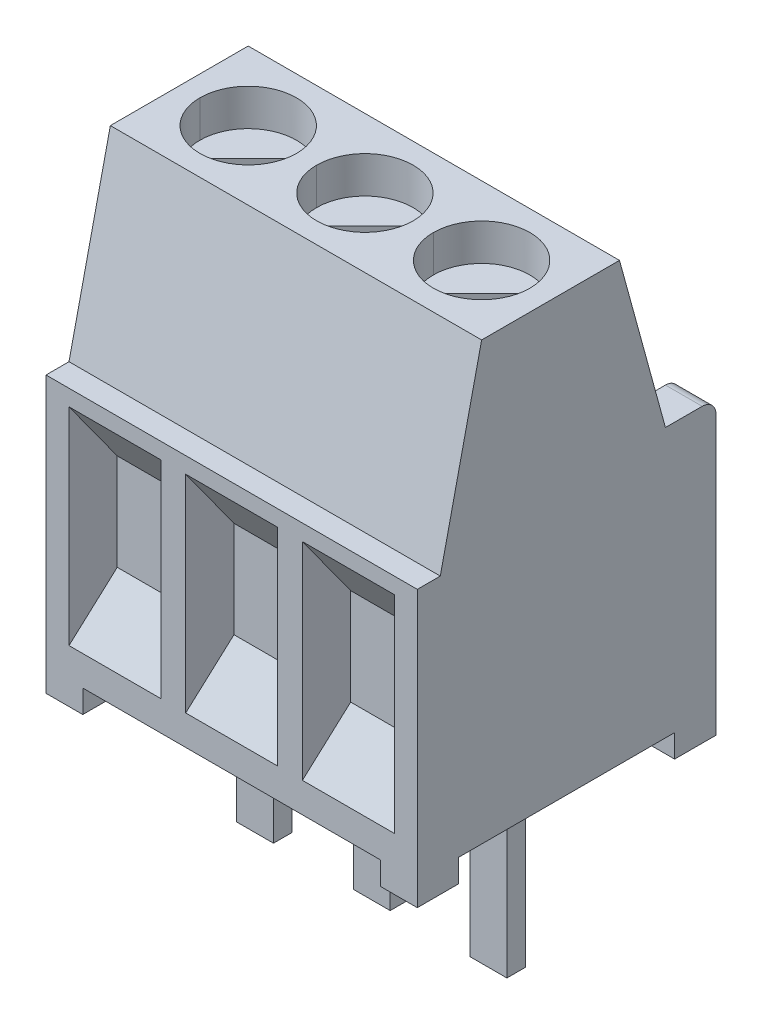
ISO-10303-21;
HEADER;
FILE_DESCRIPTION(('STEP AP214'),'2;1');
FILE_NAME('part.step','',(''),(''),'','','');
FILE_SCHEMA(('AUTOMOTIVE_DESIGN { 1 0 10303 214 1 1 1 1 }'));
ENDSEC;
DATA;
#1=APPLICATION_CONTEXT('core data for automotive mechanical design processes');
#2=APPLICATION_PROTOCOL_DEFINITION('international standard','automotive_design',2000,#1);
#3=PRODUCT_CONTEXT('',#1,'mechanical');
#4=PRODUCT('Part','Part','',(#3));
#5=PRODUCT_RELATED_PRODUCT_CATEGORY('part','',(#4));
#6=PRODUCT_DEFINITION_FORMATION('','',#4);
#7=PRODUCT_DEFINITION_CONTEXT('part definition',#1,'design');
#8=PRODUCT_DEFINITION('design','',#6,#7);
#9=PRODUCT_DEFINITION_SHAPE('','',#8);
#10=(LENGTH_UNIT() NAMED_UNIT(*) SI_UNIT(.MILLI.,.METRE.));
#11=(NAMED_UNIT(*) PLANE_ANGLE_UNIT() SI_UNIT($,.RADIAN.));
#12=(NAMED_UNIT(*) SI_UNIT($,.STERADIAN.) SOLID_ANGLE_UNIT());
#13=UNCERTAINTY_MEASURE_WITH_UNIT(LENGTH_MEASURE(1.E-05),#10,'distance_accuracy_value','');
#14=(GEOMETRIC_REPRESENTATION_CONTEXT(3) GLOBAL_UNCERTAINTY_ASSIGNED_CONTEXT((#13)) GLOBAL_UNIT_ASSIGNED_CONTEXT((#10,
#11,#12)) REPRESENTATION_CONTEXT('',''));
#15=CARTESIAN_POINT('',(0.,0.,0.));
#16=DIRECTION('',(0.,0.,1.));
#17=DIRECTION('',(1.,0.,0.));
#18=AXIS2_PLACEMENT_3D('',#15,#16,#17);
#19=CARTESIAN_POINT('',(1.84,-1.7,-6.3));
#20=DIRECTION('',(0.,-1.,0.));
#21=DIRECTION('',(0.,0.,-1.));
#22=AXIS2_PLACEMENT_3D('',#19,#20,#21);
#23=PLANE('',#22);
#24=DIRECTION('',(1.,0.,0.));
#25=VECTOR('',#24,1.);
#26=CARTESIAN_POINT('',(1.84,-1.7,-6.3));
#27=LINE('',#26,#25);
#28=CARTESIAN_POINT('',(1.84,-1.7,-6.3));
#29=VERTEX_POINT('',#28);
#30=CARTESIAN_POINT('',(3.24,-1.7,-6.3));
#31=VERTEX_POINT('',#30);
#32=EDGE_CURVE('E977',#29,#31,#27,.T.);
#33=ORIENTED_EDGE('',*,*,#32,.T.);
#34=DIRECTION('',(0.,0.,-1.));
#35=VECTOR('',#34,1.);
#36=CARTESIAN_POINT('',(3.24,-1.7,-6.3));
#37=LINE('',#36,#35);
#38=CARTESIAN_POINT('',(3.24,-1.7,-6.4));
#39=VERTEX_POINT('',#38);
#40=EDGE_CURVE('E919',#31,#39,#37,.T.);
#41=ORIENTED_EDGE('',*,*,#40,.T.);
#42=DIRECTION('',(1.,0.,0.));
#43=VECTOR('',#42,1.);
#44=CARTESIAN_POINT('',(1.84,-1.7,-6.4));
#45=LINE('',#44,#43);
#46=CARTESIAN_POINT('',(1.84,-1.7,-6.4));
#47=VERTEX_POINT('',#46);
#48=EDGE_CURVE('E10',#47,#39,#45,.T.);
#49=ORIENTED_EDGE('',*,*,#48,.F.);
#50=DIRECTION('',(0.,0.,-1.));
#51=VECTOR('',#50,1.);
#52=CARTESIAN_POINT('',(1.84,-1.7,-6.3));
#53=LINE('',#52,#51);
#54=EDGE_CURVE('E996',#29,#47,#53,.T.);
#55=ORIENTED_EDGE('',*,*,#54,.F.);
#56=EDGE_LOOP('',(#33,#41,#49,#55));
#57=FACE_BOUND('',#56,.T.);
#58=ADVANCED_FACE('F17',(#57),#23,.F.);
#59=CARTESIAN_POINT('',(1.84,-1.7,-6.4));
#60=DIRECTION('',(0.,0.,1.));
#61=DIRECTION('',(1.,0.,0.));
#62=AXIS2_PLACEMENT_3D('',#59,#60,#61);
#63=PLANE('',#62);
#64=ORIENTED_EDGE('',*,*,#48,.T.);
#65=DIRECTION('',(0.,-1.,0.));
#66=VECTOR('',#65,1.);
#67=CARTESIAN_POINT('',(3.24,-1.7,-6.4));
#68=LINE('',#67,#66);
#69=CARTESIAN_POINT('',(3.24,-2.25,-6.4));
#70=VERTEX_POINT('',#69);
#71=EDGE_CURVE('E913',#39,#70,#68,.T.);
#72=ORIENTED_EDGE('',*,*,#71,.T.);
#73=DIRECTION('',(1.,0.,0.));
#74=VECTOR('',#73,1.);
#75=CARTESIAN_POINT('',(1.84,-2.25,-6.4));
#76=LINE('',#75,#74);
#77=CARTESIAN_POINT('',(1.84,-2.25,-6.4));
#78=VERTEX_POINT('',#77);
#79=EDGE_CURVE('E20',#78,#70,#76,.T.);
#80=ORIENTED_EDGE('',*,*,#79,.F.);
#81=DIRECTION('',(0.,-1.,0.));
#82=VECTOR('',#81,1.);
#83=CARTESIAN_POINT('',(1.84,-1.7,-6.4));
#84=LINE('',#83,#82);
#85=EDGE_CURVE('E1019',#47,#78,#84,.T.);
#86=ORIENTED_EDGE('',*,*,#85,.F.);
#87=EDGE_LOOP('',(#64,#72,#80,#86));
#88=FACE_BOUND('',#87,.T.);
#89=ADVANCED_FACE('F914',(#88),#63,.F.);
#90=CARTESIAN_POINT('',(1.84,-2.25,-6.4));
#91=DIRECTION('',(0.,-1.,0.));
#92=DIRECTION('',(0.,0.,-1.));
#93=AXIS2_PLACEMENT_3D('',#90,#91,#92);
#94=PLANE('',#93);
#95=ORIENTED_EDGE('',*,*,#79,.T.);
#96=DIRECTION('',(0.,0.,-1.));
#97=VECTOR('',#96,1.);
#98=CARTESIAN_POINT('',(3.24,-2.25,-6.4));
#99=LINE('',#98,#97);
#100=CARTESIAN_POINT('',(3.24,-2.25,-6.5));
#101=VERTEX_POINT('',#100);
#102=EDGE_CURVE('E905',#70,#101,#99,.T.);
#103=ORIENTED_EDGE('',*,*,#102,.T.);
#104=DIRECTION('',(1.,0.,0.));
#105=VECTOR('',#104,1.);
#106=CARTESIAN_POINT('',(1.84,-2.25,-6.5));
#107=LINE('',#106,#105);
#108=CARTESIAN_POINT('',(1.84,-2.25,-6.5));
#109=VERTEX_POINT('',#108);
#110=EDGE_CURVE('E1039',#109,#101,#107,.T.);
#111=ORIENTED_EDGE('',*,*,#110,.F.);
#112=DIRECTION('',(0.,0.,-1.));
#113=VECTOR('',#112,1.);
#114=CARTESIAN_POINT('',(1.84,-2.25,-6.4));
#115=LINE('',#114,#113);
#116=EDGE_CURVE('E908',#78,#109,#115,.T.);
#117=ORIENTED_EDGE('',*,*,#116,.F.);
#118=EDGE_LOOP('',(#95,#103,#111,#117));
#119=FACE_BOUND('',#118,.T.);
#120=ADVANCED_FACE('F903',(#119),#94,.F.);
#121=CARTESIAN_POINT('',(6.58,0.,-5.4));
#122=DIRECTION('',(0.,0.,-1.));
#123=DIRECTION('',(0.,-1.,0.));
#124=AXIS2_PLACEMENT_3D('',#121,#122,#123);
#125=PLANE('',#124);
#126=DIRECTION('',(-1.,0.,0.));
#127=VECTOR('',#126,1.);
#128=CARTESIAN_POINT('',(0.7,-0.95,-5.4));
#129=LINE('',#128,#127);
#130=CARTESIAN_POINT('',(0.7,-0.95,-5.4));
#131=VERTEX_POINT('',#130);
#132=CARTESIAN_POINT('',(-0.7,-0.95,-5.4));
#133=VERTEX_POINT('',#132);
#134=EDGE_CURVE('E886',#131,#133,#129,.T.);
#135=ORIENTED_EDGE('',*,*,#134,.T.);
#136=DIRECTION('',(0.,1.,0.));
#137=VECTOR('',#136,1.);
#138=CARTESIAN_POINT('',(-0.7,-0.95,-5.4));
#139=LINE('',#138,#137);
#140=CARTESIAN_POINT('',(-0.7,3.35,-5.4));
#141=VERTEX_POINT('',#140);
#142=EDGE_CURVE('E842',#133,#141,#139,.T.);
#143=ORIENTED_EDGE('',*,*,#142,.T.);
#144=DIRECTION('',(-1.,0.,0.));
#145=VECTOR('',#144,1.);
#146=CARTESIAN_POINT('',(0.7,3.35,-5.4));
#147=LINE('',#146,#145);
#148=CARTESIAN_POINT('',(0.7,3.35,-5.4));
#149=VERTEX_POINT('',#148);
#150=EDGE_CURVE('E1612',#149,#141,#147,.T.);
#151=ORIENTED_EDGE('',*,*,#150,.F.);
#152=DIRECTION('',(0.,-1.,0.));
#153=VECTOR('',#152,1.);
#154=CARTESIAN_POINT('',(0.7,3.35,-5.4));
#155=LINE('',#154,#153);
#156=EDGE_CURVE('E869',#149,#131,#155,.T.);
#157=ORIENTED_EDGE('',*,*,#156,.T.);
#158=EDGE_LOOP('',(#135,#143,#151,#157));
#159=FACE_BOUND('',#158,.T.);
#160=ADVANCED_FACE('F1892',(#159),#125,.T.);
#161=CARTESIAN_POINT('',(-0.7,-1.7,-6.4));
#162=DIRECTION('',(0.,0.,1.));
#163=DIRECTION('',(1.,0.,0.));
#164=AXIS2_PLACEMENT_3D('',#161,#162,#163);
#165=PLANE('',#164);
#166=DIRECTION('',(1.,0.,0.));
#167=VECTOR('',#166,1.);
#168=CARTESIAN_POINT('',(-0.7,-1.7,-6.4));
#169=LINE('',#168,#167);
#170=CARTESIAN_POINT('',(-0.7,-1.7,-6.4));
#171=VERTEX_POINT('',#170);
#172=CARTESIAN_POINT('',(0.7,-1.7,-6.4));
#173=VERTEX_POINT('',#172);
#174=EDGE_CURVE('E893',#171,#173,#169,.T.);
#175=ORIENTED_EDGE('',*,*,#174,.T.);
#176=DIRECTION('',(0.,-1.,0.));
#177=VECTOR('',#176,1.);
#178=CARTESIAN_POINT('',(0.7,-1.7,-6.4));
#179=LINE('',#178,#177);
#180=CARTESIAN_POINT('',(0.7,-2.25,-6.4));
#181=VERTEX_POINT('',#180);
#182=EDGE_CURVE('E446',#173,#181,#179,.T.);
#183=ORIENTED_EDGE('',*,*,#182,.T.);
#184=DIRECTION('',(1.,0.,0.));
#185=VECTOR('',#184,1.);
#186=CARTESIAN_POINT('',(-0.7,-2.25,-6.4));
#187=LINE('',#186,#185);
#188=CARTESIAN_POINT('',(-0.7,-2.25,-6.4));
#189=VERTEX_POINT('',#188);
#190=EDGE_CURVE('E436',#189,#181,#187,.T.);
#191=ORIENTED_EDGE('',*,*,#190,.F.);
#192=DIRECTION('',(0.,-1.,0.));
#193=VECTOR('',#192,1.);
#194=CARTESIAN_POINT('',(-0.7,-1.7,-6.4));
#195=LINE('',#194,#193);
#196=EDGE_CURVE('E858',#171,#189,#195,.T.);
#197=ORIENTED_EDGE('',*,*,#196,.F.);
#198=EDGE_LOOP('',(#175,#183,#191,#197));
#199=FACE_BOUND('',#198,.T.);
#200=ADVANCED_FACE('F1956',(#199),#165,.F.);
#201=CARTESIAN_POINT('',(-0.7,-1.7,-6.3));
#202=DIRECTION('',(0.,-1.,0.));
#203=DIRECTION('',(0.,0.,-1.));
#204=AXIS2_PLACEMENT_3D('',#201,#202,#203);
#205=PLANE('',#204);
#206=DIRECTION('',(1.,0.,0.));
#207=VECTOR('',#206,1.);
#208=CARTESIAN_POINT('',(-0.7,-1.7,-6.3));
#209=LINE('',#208,#207);
#210=CARTESIAN_POINT('',(-0.7,-1.7,-6.3));
#211=VERTEX_POINT('',#210);
#212=CARTESIAN_POINT('',(0.7,-1.7,-6.3));
#213=VERTEX_POINT('',#212);
#214=EDGE_CURVE('E891',#211,#213,#209,.T.);
#215=ORIENTED_EDGE('',*,*,#214,.T.);
#216=DIRECTION('',(0.,0.,-1.));
#217=VECTOR('',#216,1.);
#218=CARTESIAN_POINT('',(0.7,-1.7,-6.3));
#219=LINE('',#218,#217);
#220=EDGE_CURVE('E875',#213,#173,#219,.T.);
#221=ORIENTED_EDGE('',*,*,#220,.T.);
#222=ORIENTED_EDGE('',*,*,#174,.F.);
#223=DIRECTION('',(0.,0.,-1.));
#224=VECTOR('',#223,1.);
#225=CARTESIAN_POINT('',(-0.7,-1.7,-6.3));
#226=LINE('',#225,#224);
#227=EDGE_CURVE('E854',#211,#171,#226,.T.);
#228=ORIENTED_EDGE('',*,*,#227,.F.);
#229=EDGE_LOOP('',(#215,#221,#222,#228));
#230=FACE_BOUND('',#229,.T.);
#231=ADVANCED_FACE('F1958',(#230),#205,.F.);
#232=CARTESIAN_POINT('',(-0.7,-0.95,-6.1));
#233=DIRECTION('',(0.,-0.257662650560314,0.966234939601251));
#234=DIRECTION('',(-1.,0.,0.));
#235=AXIS2_PLACEMENT_3D('',#232,#233,#234);
#236=PLANE('',#235);
#237=DIRECTION('',(-1.,0.,0.));
#238=VECTOR('',#237,1.);
#239=CARTESIAN_POINT('',(0.7,-0.95,-6.1));
#240=LINE('',#239,#238);
#241=CARTESIAN_POINT('',(0.7,-0.95,-6.1));
#242=VERTEX_POINT('',#241);
#243=CARTESIAN_POINT('',(-0.7,-0.95,-6.1));
#244=VERTEX_POINT('',#243);
#245=EDGE_CURVE('E40',#242,#244,#240,.T.);
#246=ORIENTED_EDGE('',*,*,#245,.F.);
#247=DIRECTION('',(0.,-0.966234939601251,-0.257662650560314));
#248=VECTOR('',#247,1.);
#249=CARTESIAN_POINT('',(0.7,-0.95,-6.1));
#250=LINE('',#249,#248);
#251=EDGE_CURVE('E879',#242,#213,#250,.T.);
#252=ORIENTED_EDGE('',*,*,#251,.T.);
#253=ORIENTED_EDGE('',*,*,#214,.F.);
#254=DIRECTION('',(0.,-0.966234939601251,-0.257662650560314));
#255=VECTOR('',#254,1.);
#256=CARTESIAN_POINT('',(-0.7,-0.95,-6.1));
#257=LINE('',#256,#255);
#258=EDGE_CURVE('E850',#244,#211,#257,.T.);
#259=ORIENTED_EDGE('',*,*,#258,.F.);
#260=EDGE_LOOP('',(#246,#252,#253,#259));
#261=FACE_BOUND('',#260,.T.);
#262=ADVANCED_FACE('F1966',(#261),#236,.F.);
#263=CARTESIAN_POINT('',(0.7,-0.95,-6.5));
#264=DIRECTION('',(0.,-1.,0.));
#265=DIRECTION('',(0.,0.,-1.));
#266=AXIS2_PLACEMENT_3D('',#263,#264,#265);
#267=PLANE('',#266);
#268=DIRECTION('',(0.,0.,1.));
#269=VECTOR('',#268,1.);
#270=CARTESIAN_POINT('',(-0.7,-0.95,-6.1));
#271=LINE('',#270,#269);
#272=EDGE_CURVE('E846',#244,#133,#271,.T.);
#273=ORIENTED_EDGE('',*,*,#272,.T.);
#274=ORIENTED_EDGE('',*,*,#134,.F.);
#275=DIRECTION('',(0.,0.,1.));
#276=VECTOR('',#275,1.);
#277=CARTESIAN_POINT('',(0.7,-0.95,-6.1));
#278=LINE('',#277,#276);
#279=EDGE_CURVE('E882',#242,#131,#278,.T.);
#280=ORIENTED_EDGE('',*,*,#279,.F.);
#281=ORIENTED_EDGE('',*,*,#245,.T.);
#282=EDGE_LOOP('',(#273,#274,#280,#281));
#283=FACE_BOUND('',#282,.T.);
#284=ADVANCED_FACE('F2139',(#283),#267,.F.);
#285=CARTESIAN_POINT('',(0.7,3.35,-6.5));
#286=DIRECTION('',(1.,0.,0.));
#287=DIRECTION('',(0.,1.,0.));
#288=AXIS2_PLACEMENT_3D('',#285,#286,#287);
#289=PLANE('',#288);
#290=ORIENTED_EDGE('',*,*,#156,.F.);
#291=DIRECTION('',(0.,0.,-1.));
#292=VECTOR('',#291,1.);
#293=CARTESIAN_POINT('',(0.7,3.35,-5.4));
#294=LINE('',#293,#292);
#295=CARTESIAN_POINT('',(0.7,3.35,-6.2));
#296=VERTEX_POINT('',#295);
#297=EDGE_CURVE('E963',#149,#296,#294,.T.);
#298=ORIENTED_EDGE('',*,*,#297,.T.);
#299=CARTESIAN_POINT('',(0.7,3.05,-6.2));
#300=DIRECTION('',(-1.,0.,0.));
#301=DIRECTION('',(0.,1.,3.049412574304E-13));
#302=AXIS2_PLACEMENT_3D('',#299,#300,#301);
#303=CIRCLE('',#302,0.3);
#304=CARTESIAN_POINT('',(0.7,3.05,-6.5));
#305=VERTEX_POINT('',#304);
#306=EDGE_CURVE('E940',#296,#305,#303,.T.);
#307=ORIENTED_EDGE('',*,*,#306,.T.);
#308=DIRECTION('',(0.,1.,0.));
#309=VECTOR('',#308,1.);
#310=CARTESIAN_POINT('',(0.7,-2.25,-6.5));
#311=LINE('',#310,#309);
#312=CARTESIAN_POINT('',(0.7,-2.25,-6.5));
#313=VERTEX_POINT('',#312);
#314=EDGE_CURVE('E1110',#313,#305,#311,.T.);
#315=ORIENTED_EDGE('',*,*,#314,.F.);
#316=DIRECTION('',(0.,0.,-1.));
#317=VECTOR('',#316,1.);
#318=CARTESIAN_POINT('',(0.7,-2.25,-6.4));
#319=LINE('',#318,#317);
#320=EDGE_CURVE('E865',#181,#313,#319,.T.);
#321=ORIENTED_EDGE('',*,*,#320,.F.);
#322=ORIENTED_EDGE('',*,*,#182,.F.);
#323=ORIENTED_EDGE('',*,*,#220,.F.);
#324=ORIENTED_EDGE('',*,*,#251,.F.);
#325=ORIENTED_EDGE('',*,*,#279,.T.);
#326=EDGE_LOOP('',(#290,#298,#307,#315,#321,#322,#323,#324,#325));
#327=FACE_BOUND('',#326,.T.);
#328=ADVANCED_FACE('F2051',(#327),#289,.F.);
#329=CARTESIAN_POINT('',(-0.7,-2.25,-6.4));
#330=DIRECTION('',(0.,-1.,0.));
#331=DIRECTION('',(0.,0.,-1.));
#332=AXIS2_PLACEMENT_3D('',#329,#330,#331);
#333=PLANE('',#332);
#334=ORIENTED_EDGE('',*,*,#190,.T.);
#335=ORIENTED_EDGE('',*,*,#320,.T.);
#336=DIRECTION('',(1.,0.,0.));
#337=VECTOR('',#336,1.);
#338=CARTESIAN_POINT('',(-0.7,-2.25,-6.5));
#339=LINE('',#338,#337);
#340=CARTESIAN_POINT('',(-0.7,-2.25,-6.5));
#341=VERTEX_POINT('',#340);
#342=EDGE_CURVE('E1106',#341,#313,#339,.T.);
#343=ORIENTED_EDGE('',*,*,#342,.F.);
#344=DIRECTION('',(0.,0.,-1.));
#345=VECTOR('',#344,1.);
#346=CARTESIAN_POINT('',(-0.7,-2.25,-6.4));
#347=LINE('',#346,#345);
#348=EDGE_CURVE('E859',#189,#341,#347,.T.);
#349=ORIENTED_EDGE('',*,*,#348,.F.);
#350=EDGE_LOOP('',(#334,#335,#343,#349));
#351=FACE_BOUND('',#350,.T.);
#352=ADVANCED_FACE('F1954',(#351),#333,.F.);
#353=CARTESIAN_POINT('',(-0.7,-0.95,-6.5));
#354=DIRECTION('',(-1.,0.,0.));
#355=DIRECTION('',(0.,0.,1.));
#356=AXIS2_PLACEMENT_3D('',#353,#354,#355);
#357=PLANE('',#356);
#358=CARTESIAN_POINT('',(-0.7,3.05,-6.2));
#359=DIRECTION('',(-1.,0.,0.));
#360=DIRECTION('',(0.,1.,2.901382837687E-13));
#361=AXIS2_PLACEMENT_3D('',#358,#359,#360);
#362=CIRCLE('',#361,0.3);
#363=CARTESIAN_POINT('',(-0.7,3.35,-6.2));
#364=VERTEX_POINT('',#363);
#365=CARTESIAN_POINT('',(-0.7,3.05,-6.5));
#366=VERTEX_POINT('',#365);
#367=EDGE_CURVE('E955',#364,#366,#362,.T.);
#368=ORIENTED_EDGE('',*,*,#367,.F.);
#369=DIRECTION('',(0.,0.,-1.));
#370=VECTOR('',#369,1.);
#371=CARTESIAN_POINT('',(-0.7,3.35,-5.4));
#372=LINE('',#371,#370);
#373=EDGE_CURVE('E960',#141,#364,#372,.T.);
#374=ORIENTED_EDGE('',*,*,#373,.F.);
#375=ORIENTED_EDGE('',*,*,#142,.F.);
#376=ORIENTED_EDGE('',*,*,#272,.F.);
#377=ORIENTED_EDGE('',*,*,#258,.T.);
#378=ORIENTED_EDGE('',*,*,#227,.T.);
#379=ORIENTED_EDGE('',*,*,#196,.T.);
#380=ORIENTED_EDGE('',*,*,#348,.T.);
#381=DIRECTION('',(0.,-1.,0.));
#382=VECTOR('',#381,1.);
#383=CARTESIAN_POINT('',(-0.7,3.05,-6.5));
#384=LINE('',#383,#382);
#385=EDGE_CURVE('E1099',#366,#341,#384,.T.);
#386=ORIENTED_EDGE('',*,*,#385,.F.);
#387=EDGE_LOOP('',(#368,#374,#375,#376,#377,#378,#379,#380,#386));
#388=FACE_BOUND('',#387,.T.);
#389=ADVANCED_FACE('F1953',(#388),#357,.F.);
#390=CARTESIAN_POINT('',(2.54,7.,-2.9));
#391=DIRECTION('',(0.,1.,0.));
#392=DIRECTION('',(-1.,0.,0.));
#393=AXIS2_PLACEMENT_3D('',#390,#391,#392);
#394=CYLINDRICAL_SURFACE('',#393,1.05);
#395=DIRECTION('',(0.,-1.,0.));
#396=VECTOR('',#395,1.);
#397=CARTESIAN_POINT('',(3.59,7.,-2.9));
#398=LINE('',#397,#396);
#399=CARTESIAN_POINT('',(3.59,7.,-2.9));
#400=VERTEX_POINT('',#399);
#401=CARTESIAN_POINT('',(3.59,6.2,-2.9));
#402=VERTEX_POINT('',#401);
#403=EDGE_CURVE('E803',#400,#402,#398,.T.);
#404=ORIENTED_EDGE('',*,*,#403,.F.);
#405=CARTESIAN_POINT('',(2.54,7.,-2.9));
#406=DIRECTION('',(0.,1.,0.));
#407=DIRECTION('',(1.,0.,0.));
#408=AXIS2_PLACEMENT_3D('',#405,#406,#407);
#409=CIRCLE('',#408,1.05);
#410=CARTESIAN_POINT('',(1.49,7.,-2.9));
#411=VERTEX_POINT('',#410);
#412=EDGE_CURVE('E1250',#400,#411,#409,.T.);
#413=ORIENTED_EDGE('',*,*,#412,.T.);
#414=DIRECTION('',(0.,-1.,0.));
#415=VECTOR('',#414,1.);
#416=CARTESIAN_POINT('',(1.49,7.,-2.9));
#417=LINE('',#416,#415);
#418=CARTESIAN_POINT('',(1.49,6.2,-2.9));
#419=VERTEX_POINT('',#418);
#420=EDGE_CURVE('E799',#411,#419,#417,.T.);
#421=ORIENTED_EDGE('',*,*,#420,.T.);
#422=CARTESIAN_POINT('',(2.54,6.2,-2.9));
#423=DIRECTION('',(0.,1.,0.));
#424=DIRECTION('',(0.518412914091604,0.,-0.855130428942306));
#425=AXIS2_PLACEMENT_3D('',#422,#423,#424);
#426=CIRCLE('',#425,1.05);
#427=CARTESIAN_POINT('',(3.084333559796,6.2,-3.797886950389));
#428=VERTEX_POINT('',#427);
#429=EDGE_CURVE('E826',#428,#419,#426,.T.);
#430=ORIENTED_EDGE('',*,*,#429,.F.);
#431=DIRECTION('',(0.,-1.,0.));
#432=VECTOR('',#431,1.);
#433=CARTESIAN_POINT('',(3.084333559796,6.2,-3.797886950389));
#434=LINE('',#433,#432);
#435=CARTESIAN_POINT('',(3.084333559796,5.7,-3.797886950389));
#436=VERTEX_POINT('',#435);
#437=EDGE_CURVE('E839',#428,#436,#434,.T.);
#438=ORIENTED_EDGE('',*,*,#437,.T.);
#439=CARTESIAN_POINT('',(2.54,5.7,-2.9));
#440=DIRECTION('',(0.,1.,0.));
#441=DIRECTION('',(0.855130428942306,0.,-0.518412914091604));
#442=AXIS2_PLACEMENT_3D('',#439,#440,#441);
#443=CIRCLE('',#442,1.05);
#444=CARTESIAN_POINT('',(3.437886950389,5.7,-3.444333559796));
#445=VERTEX_POINT('',#444);
#446=EDGE_CURVE('E832',#445,#436,#443,.T.);
#447=ORIENTED_EDGE('',*,*,#446,.F.);
#448=DIRECTION('',(0.,-1.,0.));
#449=VECTOR('',#448,1.);
#450=CARTESIAN_POINT('',(3.437886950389,6.2,-3.444333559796));
#451=LINE('',#450,#449);
#452=CARTESIAN_POINT('',(3.437886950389,6.2,-3.444333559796));
#453=VERTEX_POINT('',#452);
#454=EDGE_CURVE('E733',#453,#445,#451,.T.);
#455=ORIENTED_EDGE('',*,*,#454,.F.);
#456=CARTESIAN_POINT('',(2.54,6.2,-2.9));
#457=DIRECTION('',(0.,1.,0.));
#458=DIRECTION('',(1.,0.,0.));
#459=AXIS2_PLACEMENT_3D('',#456,#457,#458);
#460=CIRCLE('',#459,1.05);
#461=EDGE_CURVE('E818',#402,#453,#460,.T.);
#462=ORIENTED_EDGE('',*,*,#461,.F.);
#463=EDGE_LOOP('',(#404,#413,#421,#430,#438,#447,#455,#462));
#464=FACE_BOUND('',#463,.T.);
#465=ADVANCED_FACE('F2056',(#464),#394,.F.);
#466=CARTESIAN_POINT('',(3.084333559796,6.2,-3.797886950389));
#467=DIRECTION('',(-0.707106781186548,0.,-0.707106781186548));
#468=DIRECTION('',(-0.707106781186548,0.,0.707106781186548));
#469=AXIS2_PLACEMENT_3D('',#466,#467,#468);
#470=PLANE('',#469);
#471=DIRECTION('',(-0.707106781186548,0.,0.707106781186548));
#472=VECTOR('',#471,1.);
#473=CARTESIAN_POINT('',(3.084333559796,6.2,-3.797886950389));
#474=LINE('',#473,#472);
#475=CARTESIAN_POINT('',(1.642113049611,6.2,-2.355666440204));
#476=VERTEX_POINT('',#475);
#477=EDGE_CURVE('E738',#428,#476,#474,.T.);
#478=ORIENTED_EDGE('',*,*,#477,.T.);
#479=DIRECTION('',(0.,-1.,0.));
#480=VECTOR('',#479,1.);
#481=CARTESIAN_POINT('',(1.642113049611,6.2,-2.355666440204));
#482=LINE('',#481,#480);
#483=CARTESIAN_POINT('',(1.642113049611,5.7,-2.355666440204));
#484=VERTEX_POINT('',#483);
#485=EDGE_CURVE('E813',#476,#484,#482,.T.);
#486=ORIENTED_EDGE('',*,*,#485,.T.);
#487=DIRECTION('',(-0.707106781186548,0.,0.707106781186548));
#488=VECTOR('',#487,1.);
#489=CARTESIAN_POINT('',(3.084333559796,5.7,-3.797886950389));
#490=LINE('',#489,#488);
#491=EDGE_CURVE('E836',#436,#484,#490,.T.);
#492=ORIENTED_EDGE('',*,*,#491,.F.);
#493=ORIENTED_EDGE('',*,*,#437,.F.);
#494=EDGE_LOOP('',(#478,#486,#492,#493));
#495=FACE_BOUND('',#494,.T.);
#496=ADVANCED_FACE('F2052',(#495),#470,.F.);
#497=CARTESIAN_POINT('',(9.12,5.7,0.));
#498=DIRECTION('',(0.,1.,0.));
#499=DIRECTION('',(1.,0.,0.));
#500=AXIS2_PLACEMENT_3D('',#497,#498,#499);
#501=PLANE('',#500);
#502=ORIENTED_EDGE('',*,*,#446,.T.);
#503=ORIENTED_EDGE('',*,*,#491,.T.);
#504=CARTESIAN_POINT('',(2.54,5.7,-2.9));
#505=DIRECTION('',(0.,1.,0.));
#506=DIRECTION('',(-0.855130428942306,0.,0.518412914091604));
#507=AXIS2_PLACEMENT_3D('',#504,#505,#506);
#508=CIRCLE('',#507,1.05);
#509=CARTESIAN_POINT('',(1.995666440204,5.7,-2.002113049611));
#510=VERTEX_POINT('',#509);
#511=EDGE_CURVE('E760',#484,#510,#508,.T.);
#512=ORIENTED_EDGE('',*,*,#511,.T.);
#513=DIRECTION('',(0.707106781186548,0.,-0.707106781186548));
#514=VECTOR('',#513,1.);
#515=CARTESIAN_POINT('',(1.995666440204,5.7,-2.002113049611));
#516=LINE('',#515,#514);
#517=EDGE_CURVE('E737',#510,#445,#516,.T.);
#518=ORIENTED_EDGE('',*,*,#517,.T.);
#519=EDGE_LOOP('',(#502,#503,#512,#518));
#520=FACE_BOUND('',#519,.T.);
#521=ADVANCED_FACE('F2055',(#520),#501,.T.);
#522=CARTESIAN_POINT('',(1.995666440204,6.2,-2.002113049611));
#523=DIRECTION('',(0.707106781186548,0.,0.707106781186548));
#524=DIRECTION('',(0.,-1.,0.));
#525=AXIS2_PLACEMENT_3D('',#522,#523,#524);
#526=PLANE('',#525);
#527=DIRECTION('',(0.707106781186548,0.,-0.707106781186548));
#528=VECTOR('',#527,1.);
#529=CARTESIAN_POINT('',(1.995666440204,6.2,-2.002113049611));
#530=LINE('',#529,#528);
#531=CARTESIAN_POINT('',(1.995666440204,6.2,-2.002113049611));
#532=VERTEX_POINT('',#531);
#533=EDGE_CURVE('E822',#532,#453,#530,.T.);
#534=ORIENTED_EDGE('',*,*,#533,.T.);
#535=ORIENTED_EDGE('',*,*,#454,.T.);
#536=ORIENTED_EDGE('',*,*,#517,.F.);
#537=DIRECTION('',(0.,-1.,0.));
#538=VECTOR('',#537,1.);
#539=CARTESIAN_POINT('',(1.995666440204,6.2,-2.002113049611));
#540=LINE('',#539,#538);
#541=EDGE_CURVE('E756',#532,#510,#540,.T.);
#542=ORIENTED_EDGE('',*,*,#541,.F.);
#543=EDGE_LOOP('',(#534,#535,#536,#542));
#544=FACE_BOUND('',#543,.T.);
#545=ADVANCED_FACE('F2065',(#544),#526,.F.);
#546=CARTESIAN_POINT('',(9.12,6.2,0.));
#547=DIRECTION('',(0.,1.,0.));
#548=DIRECTION('',(1.,0.,0.));
#549=AXIS2_PLACEMENT_3D('',#546,#547,#548);
#550=PLANE('',#549);
#551=ORIENTED_EDGE('',*,*,#429,.T.);
#552=CARTESIAN_POINT('',(2.54,6.2,-2.9));
#553=DIRECTION('',(0.,1.,0.));
#554=DIRECTION('',(-1.,0.,0.));
#555=AXIS2_PLACEMENT_3D('',#552,#553,#554);
#556=CIRCLE('',#555,1.05);
#557=EDGE_CURVE('E814',#419,#476,#556,.T.);
#558=ORIENTED_EDGE('',*,*,#557,.T.);
#559=ORIENTED_EDGE('',*,*,#477,.F.);
#560=EDGE_LOOP('',(#551,#558,#559));
#561=FACE_BOUND('',#560,.T.);
#562=ADVANCED_FACE('F2061',(#561),#550,.T.);
#563=CARTESIAN_POINT('',(9.12,6.2,0.));
#564=DIRECTION('',(0.,1.,0.));
#565=DIRECTION('',(1.,0.,0.));
#566=AXIS2_PLACEMENT_3D('',#563,#564,#565);
#567=PLANE('',#566);
#568=CARTESIAN_POINT('',(2.54,6.2,-2.9));
#569=DIRECTION('',(0.,1.,0.));
#570=DIRECTION('',(-0.518412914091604,0.,0.855130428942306));
#571=AXIS2_PLACEMENT_3D('',#568,#569,#570);
#572=CIRCLE('',#571,1.05);
#573=EDGE_CURVE('E761',#532,#402,#572,.T.);
#574=ORIENTED_EDGE('',*,*,#573,.T.);
#575=ORIENTED_EDGE('',*,*,#461,.T.);
#576=ORIENTED_EDGE('',*,*,#533,.F.);
#577=EDGE_LOOP('',(#574,#575,#576));
#578=FACE_BOUND('',#577,.T.);
#579=ADVANCED_FACE('F2064',(#578),#567,.T.);
#580=CARTESIAN_POINT('',(2.54,7.,-2.9));
#581=DIRECTION('',(0.,1.,0.));
#582=DIRECTION('',(-1.,0.,0.));
#583=AXIS2_PLACEMENT_3D('',#580,#581,#582);
#584=CYLINDRICAL_SURFACE('',#583,1.05);
#585=ORIENTED_EDGE('',*,*,#420,.F.);
#586=CARTESIAN_POINT('',(2.54,7.,-2.9));
#587=DIRECTION('',(0.,1.,0.));
#588=DIRECTION('',(-1.,0.,0.));
#589=AXIS2_PLACEMENT_3D('',#586,#587,#588);
#590=CIRCLE('',#589,1.05);
#591=EDGE_CURVE('E1254',#411,#400,#590,.T.);
#592=ORIENTED_EDGE('',*,*,#591,.T.);
#593=ORIENTED_EDGE('',*,*,#403,.T.);
#594=ORIENTED_EDGE('',*,*,#573,.F.);
#595=ORIENTED_EDGE('',*,*,#541,.T.);
#596=ORIENTED_EDGE('',*,*,#511,.F.);
#597=ORIENTED_EDGE('',*,*,#485,.F.);
#598=ORIENTED_EDGE('',*,*,#557,.F.);
#599=EDGE_LOOP('',(#585,#592,#593,#594,#595,#596,#597,#598));
#600=FACE_BOUND('',#599,.T.);
#601=ADVANCED_FACE('F2121',(#600),#584,.F.);
#602=CARTESIAN_POINT('',(0.,7.,-2.9));
#603=DIRECTION('',(0.,1.,0.));
#604=DIRECTION('',(-1.,0.,0.));
#605=AXIS2_PLACEMENT_3D('',#602,#603,#604);
#606=CYLINDRICAL_SURFACE('',#605,1.05);
#607=DIRECTION('',(0.,-1.,0.));
#608=VECTOR('',#607,1.);
#609=CARTESIAN_POINT('',(1.05,7.,-2.9));
#610=LINE('',#609,#608);
#611=CARTESIAN_POINT('',(1.05,7.,-2.9));
#612=VERTEX_POINT('',#611);
#613=CARTESIAN_POINT('',(1.05,6.2,-2.9));
#614=VERTEX_POINT('',#613);
#615=EDGE_CURVE('E743',#612,#614,#610,.T.);
#616=ORIENTED_EDGE('',*,*,#615,.F.);
#617=CARTESIAN_POINT('',(0.,7.,-2.9));
#618=DIRECTION('',(0.,1.,0.));
#619=DIRECTION('',(1.,0.,0.));
#620=AXIS2_PLACEMENT_3D('',#617,#618,#619);
#621=CIRCLE('',#620,1.05);
#622=CARTESIAN_POINT('',(-1.05,7.,-2.9));
#623=VERTEX_POINT('',#622);
#624=EDGE_CURVE('E1249',#612,#623,#621,.T.);
#625=ORIENTED_EDGE('',*,*,#624,.T.);
#626=DIRECTION('',(0.,-1.,0.));
#627=VECTOR('',#626,1.);
#628=CARTESIAN_POINT('',(-1.05,7.,-2.9));
#629=LINE('',#628,#627);
#630=CARTESIAN_POINT('',(-1.05,6.2,-2.9));
#631=VERTEX_POINT('',#630);
#632=EDGE_CURVE('E739',#623,#631,#629,.T.);
#633=ORIENTED_EDGE('',*,*,#632,.T.);
#634=CARTESIAN_POINT('',(0.,6.2,-2.9));
#635=DIRECTION('',(0.,1.,0.));
#636=DIRECTION('',(0.518412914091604,0.,-0.855130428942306));
#637=AXIS2_PLACEMENT_3D('',#634,#635,#636);
#638=CIRCLE('',#637,1.05);
#639=CARTESIAN_POINT('',(0.5443335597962,6.2,-3.797886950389));
#640=VERTEX_POINT('',#639);
#641=EDGE_CURVE('E781',#640,#631,#638,.T.);
#642=ORIENTED_EDGE('',*,*,#641,.F.);
#643=DIRECTION('',(0.,-1.,0.));
#644=VECTOR('',#643,1.);
#645=CARTESIAN_POINT('',(0.5443335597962,6.2,-3.797886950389));
#646=LINE('',#645,#644);
#647=CARTESIAN_POINT('',(0.5443335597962,5.7,-3.797886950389));
#648=VERTEX_POINT('',#647);
#649=EDGE_CURVE('E796',#640,#648,#646,.T.);
#650=ORIENTED_EDGE('',*,*,#649,.T.);
#651=CARTESIAN_POINT('',(0.,5.7,-2.9));
#652=DIRECTION('',(0.,1.,0.));
#653=DIRECTION('',(0.855130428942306,0.,-0.518412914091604));
#654=AXIS2_PLACEMENT_3D('',#651,#652,#653);
#655=CIRCLE('',#654,1.05);
#656=CARTESIAN_POINT('',(0.8978869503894,5.7,-3.444333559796));
#657=VERTEX_POINT('',#656);
#658=EDGE_CURVE('E724',#657,#648,#655,.T.);
#659=ORIENTED_EDGE('',*,*,#658,.F.);
#660=DIRECTION('',(0.,-1.,0.));
#661=VECTOR('',#660,1.);
#662=CARTESIAN_POINT('',(0.8978869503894,6.2,-3.444333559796));
#663=LINE('',#662,#661);
#664=CARTESIAN_POINT('',(0.8978869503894,6.2,-3.444333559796));
#665=VERTEX_POINT('',#664);
#666=EDGE_CURVE('E787',#665,#657,#663,.T.);
#667=ORIENTED_EDGE('',*,*,#666,.F.);
#668=CARTESIAN_POINT('',(0.,6.2,-2.9));
#669=DIRECTION('',(0.,1.,0.));
#670=DIRECTION('',(1.,0.,0.));
#671=AXIS2_PLACEMENT_3D('',#668,#669,#670);
#672=CIRCLE('',#671,1.05);
#673=EDGE_CURVE('E773',#614,#665,#672,.T.);
#674=ORIENTED_EDGE('',*,*,#673,.F.);
#675=EDGE_LOOP('',(#616,#625,#633,#642,#650,#659,#667,#674));
#676=FACE_BOUND('',#675,.T.);
#677=ADVANCED_FACE('F2117',(#676),#606,.F.);
#678=CARTESIAN_POINT('',(0.5443335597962,6.2,-3.797886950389));
#679=DIRECTION('',(-0.707106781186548,0.,-0.707106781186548));
#680=DIRECTION('',(-0.707106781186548,0.,0.707106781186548));
#681=AXIS2_PLACEMENT_3D('',#678,#679,#680);
#682=PLANE('',#681);
#683=DIRECTION('',(-0.707106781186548,0.,0.707106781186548));
#684=VECTOR('',#683,1.);
#685=CARTESIAN_POINT('',(0.5443335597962,6.2,-3.797886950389));
#686=LINE('',#685,#684);
#687=CARTESIAN_POINT('',(-0.8978869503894,6.2,-2.355666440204));
#688=VERTEX_POINT('',#687);
#689=EDGE_CURVE('E784',#640,#688,#686,.T.);
#690=ORIENTED_EDGE('',*,*,#689,.T.);
#691=DIRECTION('',(0.,-1.,0.));
#692=VECTOR('',#691,1.);
#693=CARTESIAN_POINT('',(-0.8978869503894,6.2,-2.355666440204));
#694=LINE('',#693,#692);
#695=CARTESIAN_POINT('',(-0.8978869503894,5.7,-2.355666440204));
#696=VERTEX_POINT('',#695);
#697=EDGE_CURVE('E765',#688,#696,#694,.T.);
#698=ORIENTED_EDGE('',*,*,#697,.T.);
#699=DIRECTION('',(-0.707106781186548,0.,0.707106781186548));
#700=VECTOR('',#699,1.);
#701=CARTESIAN_POINT('',(0.5443335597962,5.7,-3.797886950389));
#702=LINE('',#701,#700);
#703=EDGE_CURVE('E728',#648,#696,#702,.T.);
#704=ORIENTED_EDGE('',*,*,#703,.F.);
#705=ORIENTED_EDGE('',*,*,#649,.F.);
#706=EDGE_LOOP('',(#690,#698,#704,#705));
#707=FACE_BOUND('',#706,.T.);
#708=ADVANCED_FACE('F2113',(#707),#682,.F.);
#709=CARTESIAN_POINT('',(6.58,5.7,0.));
#710=DIRECTION('',(0.,1.,0.));
#711=DIRECTION('',(1.,0.,0.));
#712=AXIS2_PLACEMENT_3D('',#709,#710,#711);
#713=PLANE('',#712);
#714=ORIENTED_EDGE('',*,*,#658,.T.);
#715=ORIENTED_EDGE('',*,*,#703,.T.);
#716=CARTESIAN_POINT('',(0.,5.7,-2.9));
#717=DIRECTION('',(0.,1.,0.));
#718=DIRECTION('',(-0.855130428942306,0.,0.518412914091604));
#719=AXIS2_PLACEMENT_3D('',#716,#717,#718);
#720=CIRCLE('',#719,1.05);
#721=CARTESIAN_POINT('',(-0.5443335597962,5.7,-2.002113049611));
#722=VERTEX_POINT('',#721);
#723=EDGE_CURVE('E755',#696,#722,#720,.T.);
#724=ORIENTED_EDGE('',*,*,#723,.T.);
#725=DIRECTION('',(0.707106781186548,0.,-0.707106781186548));
#726=VECTOR('',#725,1.);
#727=CARTESIAN_POINT('',(-0.5443335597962,5.7,-2.002113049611));
#728=LINE('',#727,#726);
#729=EDGE_CURVE('E729',#722,#657,#728,.T.);
#730=ORIENTED_EDGE('',*,*,#729,.T.);
#731=EDGE_LOOP('',(#714,#715,#724,#730));
#732=FACE_BOUND('',#731,.T.);
#733=ADVANCED_FACE('F2109',(#732),#713,.T.);
#734=CARTESIAN_POINT('',(-0.5443335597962,6.2,-2.002113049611));
#735=DIRECTION('',(0.707106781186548,0.,0.707106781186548));
#736=DIRECTION('',(0.,-1.,0.));
#737=AXIS2_PLACEMENT_3D('',#734,#735,#736);
#738=PLANE('',#737);
#739=DIRECTION('',(0.707106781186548,0.,-0.707106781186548));
#740=VECTOR('',#739,1.);
#741=CARTESIAN_POINT('',(-0.5443335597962,6.2,-2.002113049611));
#742=LINE('',#741,#740);
#743=CARTESIAN_POINT('',(-0.5443335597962,6.2,-2.002113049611));
#744=VERTEX_POINT('',#743);
#745=EDGE_CURVE('E777',#744,#665,#742,.T.);
#746=ORIENTED_EDGE('',*,*,#745,.T.);
#747=ORIENTED_EDGE('',*,*,#666,.T.);
#748=ORIENTED_EDGE('',*,*,#729,.F.);
#749=DIRECTION('',(0.,-1.,0.));
#750=VECTOR('',#749,1.);
#751=CARTESIAN_POINT('',(-0.5443335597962,6.2,-2.002113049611));
#752=LINE('',#751,#750);
#753=EDGE_CURVE('E751',#744,#722,#752,.T.);
#754=ORIENTED_EDGE('',*,*,#753,.F.);
#755=EDGE_LOOP('',(#746,#747,#748,#754));
#756=FACE_BOUND('',#755,.T.);
#757=ADVANCED_FACE('F2105',(#756),#738,.F.);
#758=CARTESIAN_POINT('',(6.58,6.2,0.));
#759=DIRECTION('',(0.,1.,0.));
#760=DIRECTION('',(1.,0.,0.));
#761=AXIS2_PLACEMENT_3D('',#758,#759,#760);
#762=PLANE('',#761);
#763=ORIENTED_EDGE('',*,*,#641,.T.);
#764=CARTESIAN_POINT('',(0.,6.2,-2.9));
#765=DIRECTION('',(0.,1.,0.));
#766=DIRECTION('',(-1.,0.,0.));
#767=AXIS2_PLACEMENT_3D('',#764,#765,#766);
#768=CIRCLE('',#767,1.05);
#769=EDGE_CURVE('E769',#631,#688,#768,.T.);
#770=ORIENTED_EDGE('',*,*,#769,.T.);
#771=ORIENTED_EDGE('',*,*,#689,.F.);
#772=EDGE_LOOP('',(#763,#770,#771));
#773=FACE_BOUND('',#772,.T.);
#774=ADVANCED_FACE('F2101',(#773),#762,.T.);
#775=CARTESIAN_POINT('',(6.58,6.2,0.));
#776=DIRECTION('',(0.,1.,0.));
#777=DIRECTION('',(1.,0.,0.));
#778=AXIS2_PLACEMENT_3D('',#775,#776,#777);
#779=PLANE('',#778);
#780=CARTESIAN_POINT('',(0.,6.2,-2.9));
#781=DIRECTION('',(0.,1.,0.));
#782=DIRECTION('',(-0.518412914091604,0.,0.855130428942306));
#783=AXIS2_PLACEMENT_3D('',#780,#781,#782);
#784=CIRCLE('',#783,1.05);
#785=EDGE_CURVE('E747',#744,#614,#784,.T.);
#786=ORIENTED_EDGE('',*,*,#785,.T.);
#787=ORIENTED_EDGE('',*,*,#673,.T.);
#788=ORIENTED_EDGE('',*,*,#745,.F.);
#789=EDGE_LOOP('',(#786,#787,#788));
#790=FACE_BOUND('',#789,.T.);
#791=ADVANCED_FACE('F2097',(#790),#779,.T.);
#792=CARTESIAN_POINT('',(0.,7.,-2.9));
#793=DIRECTION('',(0.,1.,0.));
#794=DIRECTION('',(-1.,0.,0.));
#795=AXIS2_PLACEMENT_3D('',#792,#793,#794);
#796=CYLINDRICAL_SURFACE('',#795,1.05);
#797=ORIENTED_EDGE('',*,*,#632,.F.);
#798=CARTESIAN_POINT('',(0.,7.,-2.9));
#799=DIRECTION('',(0.,1.,0.));
#800=DIRECTION('',(-1.,0.,0.));
#801=AXIS2_PLACEMENT_3D('',#798,#799,#800);
#802=CIRCLE('',#801,1.05);
#803=EDGE_CURVE('E1255',#623,#612,#802,.T.);
#804=ORIENTED_EDGE('',*,*,#803,.T.);
#805=ORIENTED_EDGE('',*,*,#615,.T.);
#806=ORIENTED_EDGE('',*,*,#785,.F.);
#807=ORIENTED_EDGE('',*,*,#753,.T.);
#808=ORIENTED_EDGE('',*,*,#723,.F.);
#809=ORIENTED_EDGE('',*,*,#697,.F.);
#810=ORIENTED_EDGE('',*,*,#769,.F.);
#811=EDGE_LOOP('',(#797,#804,#805,#806,#807,#808,#809,#810));
#812=FACE_BOUND('',#811,.T.);
#813=ADVANCED_FACE('F2093',(#812),#796,.F.);
#814=CARTESIAN_POINT('',(-2.54,7.,-2.9));
#815=DIRECTION('',(0.,1.,0.));
#816=DIRECTION('',(-1.,0.,0.));
#817=AXIS2_PLACEMENT_3D('',#814,#815,#816);
#818=CYLINDRICAL_SURFACE('',#817,1.05);
#819=DIRECTION('',(0.,-1.,0.));
#820=VECTOR('',#819,1.);
#821=CARTESIAN_POINT('',(-1.49,7.,-2.9));
#822=LINE('',#821,#820);
#823=CARTESIAN_POINT('',(-1.49,7.,-2.9));
#824=VERTEX_POINT('',#823);
#825=CARTESIAN_POINT('',(-1.49,6.2,-2.9));
#826=VERTEX_POINT('',#825);
#827=EDGE_CURVE('E673',#824,#826,#822,.T.);
#828=ORIENTED_EDGE('',*,*,#827,.F.);
#829=CARTESIAN_POINT('',(-2.54,7.,-2.9));
#830=DIRECTION('',(0.,1.,0.));
#831=DIRECTION('',(1.,0.,0.));
#832=AXIS2_PLACEMENT_3D('',#829,#830,#831);
#833=CIRCLE('',#832,1.05);
#834=CARTESIAN_POINT('',(-3.59,7.,-2.9));
#835=VERTEX_POINT('',#834);
#836=EDGE_CURVE('E1238',#824,#835,#833,.T.);
#837=ORIENTED_EDGE('',*,*,#836,.T.);
#838=DIRECTION('',(0.,-1.,0.));
#839=VECTOR('',#838,1.);
#840=CARTESIAN_POINT('',(-3.59,7.,-2.9));
#841=LINE('',#840,#839);
#842=CARTESIAN_POINT('',(-3.59,6.2,-2.9));
#843=VERTEX_POINT('',#842);
#844=EDGE_CURVE('E668',#835,#843,#841,.T.);
#845=ORIENTED_EDGE('',*,*,#844,.T.);
#846=CARTESIAN_POINT('',(-2.54,6.2,-2.9));
#847=DIRECTION('',(0.,1.,0.));
#848=DIRECTION('',(0.518412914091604,0.,-0.855130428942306));
#849=AXIS2_PLACEMENT_3D('',#846,#847,#848);
#850=CIRCLE('',#849,1.05);
#851=CARTESIAN_POINT('',(-1.995666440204,6.2,-3.797886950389));
#852=VERTEX_POINT('',#851);
#853=EDGE_CURVE('E705',#852,#843,#850,.T.);
#854=ORIENTED_EDGE('',*,*,#853,.F.);
#855=DIRECTION('',(0.,-1.,0.));
#856=VECTOR('',#855,1.);
#857=CARTESIAN_POINT('',(-1.995666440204,6.2,-3.797886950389));
#858=LINE('',#857,#856);
#859=CARTESIAN_POINT('',(-1.995666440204,5.7,-3.797886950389));
#860=VERTEX_POINT('',#859);
#861=EDGE_CURVE('E732',#852,#860,#858,.T.);
#862=ORIENTED_EDGE('',*,*,#861,.T.);
#863=CARTESIAN_POINT('',(-2.54,5.7,-2.9));
#864=DIRECTION('',(0.,1.,0.));
#865=DIRECTION('',(0.855130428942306,0.,-0.518412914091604));
#866=AXIS2_PLACEMENT_3D('',#863,#864,#865);
#867=CIRCLE('',#866,1.05);
#868=CARTESIAN_POINT('',(-1.642113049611,5.7,-3.444333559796));
#869=VERTEX_POINT('',#868);
#870=EDGE_CURVE('E719',#869,#860,#867,.T.);
#871=ORIENTED_EDGE('',*,*,#870,.F.);
#872=DIRECTION('',(0.,-1.,0.));
#873=VECTOR('',#872,1.);
#874=CARTESIAN_POINT('',(-1.642113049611,6.2,-3.444333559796));
#875=LINE('',#874,#873);
#876=CARTESIAN_POINT('',(-1.642113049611,6.2,-3.444333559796));
#877=VERTEX_POINT('',#876);
#878=EDGE_CURVE('E711',#877,#869,#875,.T.);
#879=ORIENTED_EDGE('',*,*,#878,.F.);
#880=CARTESIAN_POINT('',(-2.54,6.2,-2.9));
#881=DIRECTION('',(0.,1.,0.));
#882=DIRECTION('',(1.,0.,0.));
#883=AXIS2_PLACEMENT_3D('',#880,#881,#882);
#884=CIRCLE('',#883,1.05);
#885=EDGE_CURVE('E697',#826,#877,#884,.T.);
#886=ORIENTED_EDGE('',*,*,#885,.F.);
#887=EDGE_LOOP('',(#828,#837,#845,#854,#862,#871,#879,#886));
#888=FACE_BOUND('',#887,.T.);
#889=ADVANCED_FACE('F2090',(#888),#818,.F.);
#890=CARTESIAN_POINT('',(-1.995666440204,6.2,-3.797886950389));
#891=DIRECTION('',(-0.707106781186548,0.,-0.707106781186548));
#892=DIRECTION('',(-0.707106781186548,0.,0.707106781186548));
#893=AXIS2_PLACEMENT_3D('',#890,#891,#892);
#894=PLANE('',#893);
#895=DIRECTION('',(0.,-1.,0.));
#896=VECTOR('',#895,1.);
#897=CARTESIAN_POINT('',(-3.437886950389,6.2,-2.355666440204));
#898=LINE('',#897,#896);
#899=CARTESIAN_POINT('',(-3.437886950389,6.2,-2.355666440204));
#900=VERTEX_POINT('',#899);
#901=CARTESIAN_POINT('',(-3.437886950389,5.7,-2.355666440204));
#902=VERTEX_POINT('',#901);
#903=EDGE_CURVE('E689',#900,#902,#898,.T.);
#904=ORIENTED_EDGE('',*,*,#903,.T.);
#905=DIRECTION('',(-0.707106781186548,0.,0.707106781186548));
#906=VECTOR('',#905,1.);
#907=CARTESIAN_POINT('',(-1.995666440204,5.7,-3.797886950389));
#908=LINE('',#907,#906);
#909=EDGE_CURVE('E723',#860,#902,#908,.T.);
#910=ORIENTED_EDGE('',*,*,#909,.F.);
#911=ORIENTED_EDGE('',*,*,#861,.F.);
#912=DIRECTION('',(-0.707106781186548,0.,0.707106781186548));
#913=VECTOR('',#912,1.);
#914=CARTESIAN_POINT('',(-1.995666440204,6.2,-3.797886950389));
#915=LINE('',#914,#913);
#916=EDGE_CURVE('E708',#852,#900,#915,.T.);
#917=ORIENTED_EDGE('',*,*,#916,.T.);
#918=EDGE_LOOP('',(#904,#910,#911,#917));
#919=FACE_BOUND('',#918,.T.);
#920=ADVANCED_FACE('F2088',(#919),#894,.F.);
#921=CARTESIAN_POINT('',(4.04,5.7,0.));
#922=DIRECTION('',(0.,1.,0.));
#923=DIRECTION('',(1.,0.,0.));
#924=AXIS2_PLACEMENT_3D('',#921,#922,#923);
#925=PLANE('',#924);
#926=ORIENTED_EDGE('',*,*,#870,.T.);
#927=ORIENTED_EDGE('',*,*,#909,.T.);
#928=CARTESIAN_POINT('',(-2.54,5.7,-2.9));
#929=DIRECTION('',(0.,1.,0.));
#930=DIRECTION('',(-0.855130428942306,0.,0.518412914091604));
#931=AXIS2_PLACEMENT_3D('',#928,#929,#930);
#932=CIRCLE('',#931,1.05);
#933=CARTESIAN_POINT('',(-3.084333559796,5.7,-2.002113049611));
#934=VERTEX_POINT('',#933);
#935=EDGE_CURVE('E685',#902,#934,#932,.T.);
#936=ORIENTED_EDGE('',*,*,#935,.T.);
#937=DIRECTION('',(0.707106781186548,0.,-0.707106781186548));
#938=VECTOR('',#937,1.);
#939=CARTESIAN_POINT('',(-3.084333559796,5.7,-2.002113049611));
#940=LINE('',#939,#938);
#941=EDGE_CURVE('E715',#934,#869,#940,.T.);
#942=ORIENTED_EDGE('',*,*,#941,.T.);
#943=EDGE_LOOP('',(#926,#927,#936,#942));
#944=FACE_BOUND('',#943,.T.);
#945=ADVANCED_FACE('F2084',(#944),#925,.T.);
#946=CARTESIAN_POINT('',(-3.084333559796,6.2,-2.002113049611));
#947=DIRECTION('',(0.707106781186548,0.,0.707106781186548));
#948=DIRECTION('',(0.,-1.,0.));
#949=AXIS2_PLACEMENT_3D('',#946,#947,#948);
#950=PLANE('',#949);
#951=ORIENTED_EDGE('',*,*,#878,.T.);
#952=ORIENTED_EDGE('',*,*,#941,.F.);
#953=DIRECTION('',(0.,-1.,0.));
#954=VECTOR('',#953,1.);
#955=CARTESIAN_POINT('',(-3.084333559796,6.2,-2.002113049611));
#956=LINE('',#955,#954);
#957=CARTESIAN_POINT('',(-3.084333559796,6.2,-2.002113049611));
#958=VERTEX_POINT('',#957);
#959=EDGE_CURVE('E681',#958,#934,#956,.T.);
#960=ORIENTED_EDGE('',*,*,#959,.F.);
#961=DIRECTION('',(0.707106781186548,0.,-0.707106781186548));
#962=VECTOR('',#961,1.);
#963=CARTESIAN_POINT('',(-3.084333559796,6.2,-2.002113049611));
#964=LINE('',#963,#962);
#965=EDGE_CURVE('E701',#958,#877,#964,.T.);
#966=ORIENTED_EDGE('',*,*,#965,.T.);
#967=EDGE_LOOP('',(#951,#952,#960,#966));
#968=FACE_BOUND('',#967,.T.);
#969=ADVANCED_FACE('F2087',(#968),#950,.F.);
#970=CARTESIAN_POINT('',(4.04,6.2,0.));
#971=DIRECTION('',(0.,1.,0.));
#972=DIRECTION('',(1.,0.,0.));
#973=AXIS2_PLACEMENT_3D('',#970,#971,#972);
#974=PLANE('',#973);
#975=ORIENTED_EDGE('',*,*,#853,.T.);
#976=CARTESIAN_POINT('',(-2.54,6.2,-2.9));
#977=DIRECTION('',(0.,1.,0.));
#978=DIRECTION('',(-1.,0.,0.));
#979=AXIS2_PLACEMENT_3D('',#976,#977,#978);
#980=CIRCLE('',#979,1.05);
#981=EDGE_CURVE('E693',#843,#900,#980,.T.);
#982=ORIENTED_EDGE('',*,*,#981,.T.);
#983=ORIENTED_EDGE('',*,*,#916,.F.);
#984=EDGE_LOOP('',(#975,#982,#983));
#985=FACE_BOUND('',#984,.T.);
#986=ADVANCED_FACE('F2275',(#985),#974,.T.);
#987=CARTESIAN_POINT('',(4.04,6.2,0.));
#988=DIRECTION('',(0.,1.,0.));
#989=DIRECTION('',(1.,0.,0.));
#990=AXIS2_PLACEMENT_3D('',#987,#988,#989);
#991=PLANE('',#990);
#992=CARTESIAN_POINT('',(-2.54,6.2,-2.9));
#993=DIRECTION('',(0.,1.,0.));
#994=DIRECTION('',(-0.518412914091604,0.,0.855130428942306));
#995=AXIS2_PLACEMENT_3D('',#992,#993,#994);
#996=CIRCLE('',#995,1.05);
#997=EDGE_CURVE('E677',#958,#826,#996,.T.);
#998=ORIENTED_EDGE('',*,*,#997,.T.);
#999=ORIENTED_EDGE('',*,*,#885,.T.);
#1000=ORIENTED_EDGE('',*,*,#965,.F.);
#1001=EDGE_LOOP('',(#998,#999,#1000));
#1002=FACE_BOUND('',#1001,.T.);
#1003=ADVANCED_FACE('F2082',(#1002),#991,.T.);
#1004=CARTESIAN_POINT('',(-2.54,7.,-2.9));
#1005=DIRECTION('',(0.,1.,0.));
#1006=DIRECTION('',(-1.,0.,0.));
#1007=AXIS2_PLACEMENT_3D('',#1004,#1005,#1006);
#1008=CYLINDRICAL_SURFACE('',#1007,1.05);
#1009=ORIENTED_EDGE('',*,*,#844,.F.);
#1010=CARTESIAN_POINT('',(-2.54,7.,-2.9));
#1011=DIRECTION('',(0.,1.,0.));
#1012=DIRECTION('',(-1.,0.,0.));
#1013=AXIS2_PLACEMENT_3D('',#1010,#1011,#1012);
#1014=CIRCLE('',#1013,1.05);
#1015=EDGE_CURVE('E1245',#835,#824,#1014,.T.);
#1016=ORIENTED_EDGE('',*,*,#1015,.T.);
#1017=ORIENTED_EDGE('',*,*,#827,.T.);
#1018=ORIENTED_EDGE('',*,*,#997,.F.);
#1019=ORIENTED_EDGE('',*,*,#959,.T.);
#1020=ORIENTED_EDGE('',*,*,#935,.F.);
#1021=ORIENTED_EDGE('',*,*,#903,.F.);
#1022=ORIENTED_EDGE('',*,*,#981,.F.);
#1023=EDGE_LOOP('',(#1009,#1016,#1017,#1018,#1019,#1020,#1021,#1022));
#1024=FACE_BOUND('',#1023,.T.);
#1025=ADVANCED_FACE('F2078',(#1024),#1008,.F.);
#1026=CARTESIAN_POINT('',(9.12,0.,-0.8));
#1027=DIRECTION('',(0.,0.,1.));
#1028=DIRECTION('',(1.,0.,0.));
#1029=AXIS2_PLACEMENT_3D('',#1026,#1027,#1028);
#1030=PLANE('',#1029);
#1031=DIRECTION('',(1.,0.,0.));
#1032=VECTOR('',#1031,1.);
#1033=CARTESIAN_POINT('',(1.79,-0.65,-0.8));
#1034=LINE('',#1033,#1032);
#1035=CARTESIAN_POINT('',(1.79,-0.65,-0.8));
#1036=VERTEX_POINT('',#1035);
#1037=CARTESIAN_POINT('',(3.29,-0.65,-0.8));
#1038=VERTEX_POINT('',#1037);
#1039=EDGE_CURVE('E665',#1036,#1038,#1034,.T.);
#1040=ORIENTED_EDGE('',*,*,#1039,.T.);
#1041=DIRECTION('',(0.,1.,0.));
#1042=VECTOR('',#1041,1.);
#1043=CARTESIAN_POINT('',(3.29,-0.65,-0.8));
#1044=LINE('',#1043,#1042);
#1045=CARTESIAN_POINT('',(3.29,1.45,-0.8));
#1046=VERTEX_POINT('',#1045);
#1047=EDGE_CURVE('E664',#1038,#1046,#1044,.T.);
#1048=ORIENTED_EDGE('',*,*,#1047,.T.);
#1049=DIRECTION('',(-1.,0.,0.));
#1050=VECTOR('',#1049,1.);
#1051=CARTESIAN_POINT('',(3.29,1.45,-0.8));
#1052=LINE('',#1051,#1050);
#1053=CARTESIAN_POINT('',(1.79,1.45,-0.8));
#1054=VERTEX_POINT('',#1053);
#1055=EDGE_CURVE('E658',#1046,#1054,#1052,.T.);
#1056=ORIENTED_EDGE('',*,*,#1055,.T.);
#1057=DIRECTION('',(0.,-1.,0.));
#1058=VECTOR('',#1057,1.);
#1059=CARTESIAN_POINT('',(1.79,1.45,-0.8));
#1060=LINE('',#1059,#1058);
#1061=EDGE_CURVE('E650',#1054,#1036,#1060,.T.);
#1062=ORIENTED_EDGE('',*,*,#1061,.T.);
#1063=EDGE_LOOP('',(#1040,#1048,#1056,#1062));
#1064=FACE_BOUND('',#1063,.T.);
#1065=ADVANCED_FACE('F2081',(#1064),#1030,.T.);
#1066=CARTESIAN_POINT('',(2.54,-1.25,-0.4));
#1067=DIRECTION('',(0.,-0.554700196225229,-0.832050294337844));
#1068=DIRECTION('',(0.,-0.832050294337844,0.554700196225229));
#1069=AXIS2_PLACEMENT_3D('',#1066,#1067,#1068);
#1070=PLANE('',#1069);
#1071=DIRECTION('',(1.,0.,0.));
#1072=VECTOR('',#1071,1.);
#1073=CARTESIAN_POINT('',(1.54,-1.85,0.));
#1074=LINE('',#1073,#1072);
#1075=CARTESIAN_POINT('',(1.54,-1.85,0.));
#1076=VERTEX_POINT('',#1075);
#1077=CARTESIAN_POINT('',(3.54,-1.85,0.));
#1078=VERTEX_POINT('',#1077);
#1079=EDGE_CURVE('E1044',#1076,#1078,#1074,.T.);
#1080=ORIENTED_EDGE('',*,*,#1079,.T.);
#1081=DIRECTION('',(0.1707967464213,-0.8198243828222,0.5465495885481));
#1082=VECTOR('',#1081,1.);
#1083=CARTESIAN_POINT('',(3.29,-0.65,-0.8));
#1084=LINE('',#1083,#1082);
#1085=EDGE_CURVE('E669',#1038,#1078,#1084,.T.);
#1086=ORIENTED_EDGE('',*,*,#1085,.F.);
#1087=ORIENTED_EDGE('',*,*,#1039,.F.);
#1088=DIRECTION('',(-0.1707967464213,-0.8198243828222,0.5465495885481));
#1089=VECTOR('',#1088,1.);
#1090=CARTESIAN_POINT('',(1.79,-0.65,-0.8));
#1091=LINE('',#1090,#1089);
#1092=EDGE_CURVE('E647',#1036,#1076,#1091,.T.);
#1093=ORIENTED_EDGE('',*,*,#1092,.T.);
#1094=EDGE_LOOP('',(#1080,#1086,#1087,#1093));
#1095=FACE_BOUND('',#1094,.T.);
#1096=ADVANCED_FACE('F2038',(#1095),#1070,.F.);
#1097=CARTESIAN_POINT('',(3.415,0.4,-0.4));
#1098=DIRECTION('',(0.95447997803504,0.,-0.298274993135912));
#1099=DIRECTION('',(0.,-1.,0.));
#1100=AXIS2_PLACEMENT_3D('',#1097,#1098,#1099);
#1101=PLANE('',#1100);
#1102=DIRECTION('',(0.,1.,0.));
#1103=VECTOR('',#1102,1.);
#1104=CARTESIAN_POINT('',(3.54,-1.85,0.));
#1105=LINE('',#1104,#1103);
#1106=CARTESIAN_POINT('',(3.54,2.65,0.));
#1107=VERTEX_POINT('',#1106);
#1108=EDGE_CURVE('E1049',#1078,#1107,#1105,.T.);
#1109=ORIENTED_EDGE('',*,*,#1108,.T.);
#1110=DIRECTION('',(0.1707967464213,0.8198243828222,0.5465495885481));
#1111=VECTOR('',#1110,1.);
#1112=CARTESIAN_POINT('',(3.29,1.45,-0.8));
#1113=LINE('',#1112,#1111);
#1114=EDGE_CURVE('E661',#1046,#1107,#1113,.T.);
#1115=ORIENTED_EDGE('',*,*,#1114,.F.);
#1116=ORIENTED_EDGE('',*,*,#1047,.F.);
#1117=ORIENTED_EDGE('',*,*,#1085,.T.);
#1118=EDGE_LOOP('',(#1109,#1115,#1116,#1117));
#1119=FACE_BOUND('',#1118,.T.);
#1120=ADVANCED_FACE('F2073',(#1119),#1101,.F.);
#1121=CARTESIAN_POINT('',(2.54,2.05,-0.4));
#1122=DIRECTION('',(0.,0.554700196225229,-0.832050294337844));
#1123=DIRECTION('',(-1.,0.,0.));
#1124=AXIS2_PLACEMENT_3D('',#1121,#1122,#1123);
#1125=PLANE('',#1124);
#1126=ORIENTED_EDGE('',*,*,#1055,.F.);
#1127=ORIENTED_EDGE('',*,*,#1114,.T.);
#1128=DIRECTION('',(-1.,0.,0.));
#1129=VECTOR('',#1128,1.);
#1130=CARTESIAN_POINT('',(3.54,2.65,0.));
#1131=LINE('',#1130,#1129);
#1132=CARTESIAN_POINT('',(1.54,2.65,0.));
#1133=VERTEX_POINT('',#1132);
#1134=EDGE_CURVE('E1269',#1107,#1133,#1131,.T.);
#1135=ORIENTED_EDGE('',*,*,#1134,.T.);
#1136=DIRECTION('',(-0.1707967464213,0.8198243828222,0.5465495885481));
#1137=VECTOR('',#1136,1.);
#1138=CARTESIAN_POINT('',(1.79,1.45,-0.8));
#1139=LINE('',#1138,#1137);
#1140=EDGE_CURVE('E654',#1054,#1133,#1139,.T.);
#1141=ORIENTED_EDGE('',*,*,#1140,.F.);
#1142=EDGE_LOOP('',(#1126,#1127,#1135,#1141));
#1143=FACE_BOUND('',#1142,.T.);
#1144=ADVANCED_FACE('F2070',(#1143),#1125,.F.);
#1145=CARTESIAN_POINT('',(1.665,0.4,-0.4));
#1146=DIRECTION('',(-0.95447997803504,0.,-0.298274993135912));
#1147=DIRECTION('',(-0.298274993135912,0.,0.95447997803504));
#1148=AXIS2_PLACEMENT_3D('',#1145,#1146,#1147);
#1149=PLANE('',#1148);
#1150=DIRECTION('',(0.,-1.,0.));
#1151=VECTOR('',#1150,1.);
#1152=CARTESIAN_POINT('',(1.54,2.65,0.));
#1153=LINE('',#1152,#1151);
#1154=EDGE_CURVE('E1048',#1133,#1076,#1153,.T.);
#1155=ORIENTED_EDGE('',*,*,#1154,.T.);
#1156=ORIENTED_EDGE('',*,*,#1092,.F.);
#1157=ORIENTED_EDGE('',*,*,#1061,.F.);
#1158=ORIENTED_EDGE('',*,*,#1140,.T.);
#1159=EDGE_LOOP('',(#1155,#1156,#1157,#1158));
#1160=FACE_BOUND('',#1159,.T.);
#1161=ADVANCED_FACE('F2069',(#1160),#1149,.F.);
#1162=CARTESIAN_POINT('',(6.58,0.,-0.8));
#1163=DIRECTION('',(0.,0.,1.));
#1164=DIRECTION('',(1.,0.,0.));
#1165=AXIS2_PLACEMENT_3D('',#1162,#1163,#1164);
#1166=PLANE('',#1165);
#1167=DIRECTION('',(1.,0.,0.));
#1168=VECTOR('',#1167,1.);
#1169=CARTESIAN_POINT('',(-0.75,-0.65,-0.8));
#1170=LINE('',#1169,#1168);
#1171=CARTESIAN_POINT('',(-0.75,-0.65,-0.8));
#1172=VERTEX_POINT('',#1171);
#1173=CARTESIAN_POINT('',(0.75,-0.65,-0.8));
#1174=VERTEX_POINT('',#1173);
#1175=EDGE_CURVE('E646',#1172,#1174,#1170,.T.);
#1176=ORIENTED_EDGE('',*,*,#1175,.T.);
#1177=DIRECTION('',(0.,1.,0.));
#1178=VECTOR('',#1177,1.);
#1179=CARTESIAN_POINT('',(0.75,-0.65,-0.8));
#1180=LINE('',#1179,#1178);
#1181=CARTESIAN_POINT('',(0.75,1.45,-0.8));
#1182=VERTEX_POINT('',#1181);
#1183=EDGE_CURVE('E613',#1174,#1182,#1180,.T.);
#1184=ORIENTED_EDGE('',*,*,#1183,.T.);
#1185=DIRECTION('',(-1.,0.,0.));
#1186=VECTOR('',#1185,1.);
#1187=CARTESIAN_POINT('',(0.75,1.45,-0.8));
#1188=LINE('',#1187,#1186);
#1189=CARTESIAN_POINT('',(-0.75,1.45,-0.8));
#1190=VERTEX_POINT('',#1189);
#1191=EDGE_CURVE('E606',#1182,#1190,#1188,.T.);
#1192=ORIENTED_EDGE('',*,*,#1191,.T.);
#1193=DIRECTION('',(0.,-1.,0.));
#1194=VECTOR('',#1193,1.);
#1195=CARTESIAN_POINT('',(-0.75,1.45,-0.8));
#1196=LINE('',#1195,#1194);
#1197=EDGE_CURVE('E610',#1190,#1172,#1196,.T.);
#1198=ORIENTED_EDGE('',*,*,#1197,.T.);
#1199=EDGE_LOOP('',(#1176,#1184,#1192,#1198));
#1200=FACE_BOUND('',#1199,.T.);
#1201=ADVANCED_FACE('F608',(#1200),#1166,.T.);
#1202=CARTESIAN_POINT('',(0.,-1.25,-0.4));
#1203=DIRECTION('',(0.,-0.554700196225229,-0.832050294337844));
#1204=DIRECTION('',(0.,-0.832050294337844,0.554700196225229));
#1205=AXIS2_PLACEMENT_3D('',#1202,#1203,#1204);
#1206=PLANE('',#1205);
#1207=DIRECTION('',(1.,0.,0.));
#1208=VECTOR('',#1207,1.);
#1209=CARTESIAN_POINT('',(-1.,-1.85,0.));
#1210=LINE('',#1209,#1208);
#1211=CARTESIAN_POINT('',(-1.,-1.85,0.));
#1212=VERTEX_POINT('',#1211);
#1213=CARTESIAN_POINT('',(1.,-1.85,0.));
#1214=VERTEX_POINT('',#1213);
#1215=EDGE_CURVE('E1211',#1212,#1214,#1210,.T.);
#1216=ORIENTED_EDGE('',*,*,#1215,.T.);
#1217=DIRECTION('',(0.1707967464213,-0.8198243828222,0.5465495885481));
#1218=VECTOR('',#1217,1.);
#1219=CARTESIAN_POINT('',(0.75,-0.65,-0.8));
#1220=LINE('',#1219,#1218);
#1221=EDGE_CURVE('E643',#1174,#1214,#1220,.T.);
#1222=ORIENTED_EDGE('',*,*,#1221,.F.);
#1223=ORIENTED_EDGE('',*,*,#1175,.F.);
#1224=DIRECTION('',(-0.1707967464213,-0.8198243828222,0.5465495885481));
#1225=VECTOR('',#1224,1.);
#1226=CARTESIAN_POINT('',(-0.75,-0.65,-0.8));
#1227=LINE('',#1226,#1225);
#1228=EDGE_CURVE('E630',#1172,#1212,#1227,.T.);
#1229=ORIENTED_EDGE('',*,*,#1228,.T.);
#1230=EDGE_LOOP('',(#1216,#1222,#1223,#1229));
#1231=FACE_BOUND('',#1230,.T.);
#1232=ADVANCED_FACE('F2047',(#1231),#1206,.F.);
#1233=CARTESIAN_POINT('',(0.875,0.4,-0.4));
#1234=DIRECTION('',(0.95447997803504,0.,-0.298274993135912));
#1235=DIRECTION('',(0.,-1.,0.));
#1236=AXIS2_PLACEMENT_3D('',#1233,#1234,#1235);
#1237=PLANE('',#1236);
#1238=DIRECTION('',(0.,1.,0.));
#1239=VECTOR('',#1238,1.);
#1240=CARTESIAN_POINT('',(1.,-1.85,0.));
#1241=LINE('',#1240,#1239);
#1242=CARTESIAN_POINT('',(1.,2.65,0.));
#1243=VERTEX_POINT('',#1242);
#1244=EDGE_CURVE('E1216',#1214,#1243,#1241,.T.);
#1245=ORIENTED_EDGE('',*,*,#1244,.T.);
#1246=DIRECTION('',(0.1707967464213,0.8198243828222,0.5465495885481));
#1247=VECTOR('',#1246,1.);
#1248=CARTESIAN_POINT('',(0.75,1.45,-0.8));
#1249=LINE('',#1248,#1247);
#1250=EDGE_CURVE('E617',#1182,#1243,#1249,.T.);
#1251=ORIENTED_EDGE('',*,*,#1250,.F.);
#1252=ORIENTED_EDGE('',*,*,#1183,.F.);
#1253=ORIENTED_EDGE('',*,*,#1221,.T.);
#1254=EDGE_LOOP('',(#1245,#1251,#1252,#1253));
#1255=FACE_BOUND('',#1254,.T.);
#1256=ADVANCED_FACE('F2044',(#1255),#1237,.F.);
#1257=CARTESIAN_POINT('',(0.,2.05,-0.4));
#1258=DIRECTION('',(0.,0.554700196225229,-0.832050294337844));
#1259=DIRECTION('',(-1.,0.,0.));
#1260=AXIS2_PLACEMENT_3D('',#1257,#1258,#1259);
#1261=PLANE('',#1260);
#1262=ORIENTED_EDGE('',*,*,#1191,.F.);
#1263=ORIENTED_EDGE('',*,*,#1250,.T.);
#1264=DIRECTION('',(-1.,0.,0.));
#1265=VECTOR('',#1264,1.);
#1266=CARTESIAN_POINT('',(1.,2.65,0.));
#1267=LINE('',#1266,#1265);
#1268=CARTESIAN_POINT('',(-1.,2.65,0.));
#1269=VERTEX_POINT('',#1268);
#1270=EDGE_CURVE('E623',#1243,#1269,#1267,.T.);
#1271=ORIENTED_EDGE('',*,*,#1270,.T.);
#1272=DIRECTION('',(-0.1707967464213,0.8198243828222,0.5465495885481));
#1273=VECTOR('',#1272,1.);
#1274=CARTESIAN_POINT('',(-0.75,1.45,-0.8));
#1275=LINE('',#1274,#1273);
#1276=EDGE_CURVE('E618',#1190,#1269,#1275,.T.);
#1277=ORIENTED_EDGE('',*,*,#1276,.F.);
#1278=EDGE_LOOP('',(#1262,#1263,#1271,#1277));
#1279=FACE_BOUND('',#1278,.T.);
#1280=ADVANCED_FACE('F621',(#1279),#1261,.F.);
#1281=CARTESIAN_POINT('',(-0.875,0.4,-0.4));
#1282=DIRECTION('',(-0.95447997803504,0.,-0.298274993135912));
#1283=DIRECTION('',(-0.298274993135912,0.,0.95447997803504));
#1284=AXIS2_PLACEMENT_3D('',#1281,#1282,#1283);
#1285=PLANE('',#1284);
#1286=DIRECTION('',(0.,-1.,0.));
#1287=VECTOR('',#1286,1.);
#1288=CARTESIAN_POINT('',(-1.,2.65,0.));
#1289=LINE('',#1288,#1287);
#1290=EDGE_CURVE('E1215',#1269,#1212,#1289,.T.);
#1291=ORIENTED_EDGE('',*,*,#1290,.T.);
#1292=ORIENTED_EDGE('',*,*,#1228,.F.);
#1293=ORIENTED_EDGE('',*,*,#1197,.F.);
#1294=ORIENTED_EDGE('',*,*,#1276,.T.);
#1295=EDGE_LOOP('',(#1291,#1292,#1293,#1294));
#1296=FACE_BOUND('',#1295,.T.);
#1297=ADVANCED_FACE('F629',(#1296),#1285,.F.);
#1298=CARTESIAN_POINT('',(4.04,0.,-0.8));
#1299=DIRECTION('',(0.,0.,1.));
#1300=DIRECTION('',(1.,0.,0.));
#1301=AXIS2_PLACEMENT_3D('',#1298,#1299,#1300);
#1302=PLANE('',#1301);
#1303=DIRECTION('',(1.,0.,0.));
#1304=VECTOR('',#1303,1.);
#1305=CARTESIAN_POINT('',(-3.29,-0.65,-0.8));
#1306=LINE('',#1305,#1304);
#1307=CARTESIAN_POINT('',(-3.29,-0.65,-0.8));
#1308=VERTEX_POINT('',#1307);
#1309=CARTESIAN_POINT('',(-1.79,-0.65,-0.8));
#1310=VERTEX_POINT('',#1309);
#1311=EDGE_CURVE('E635',#1308,#1310,#1306,.T.);
#1312=ORIENTED_EDGE('',*,*,#1311,.T.);
#1313=DIRECTION('',(0.,1.,0.));
#1314=VECTOR('',#1313,1.);
#1315=CARTESIAN_POINT('',(-1.79,-0.65,-0.8));
#1316=LINE('',#1315,#1314);
#1317=CARTESIAN_POINT('',(-1.79,1.45,-0.8));
#1318=VERTEX_POINT('',#1317);
#1319=EDGE_CURVE('E1489',#1310,#1318,#1316,.T.);
#1320=ORIENTED_EDGE('',*,*,#1319,.T.);
#1321=DIRECTION('',(-1.,0.,0.));
#1322=VECTOR('',#1321,1.);
#1323=CARTESIAN_POINT('',(-1.79,1.45,-0.8));
#1324=LINE('',#1323,#1322);
#1325=CARTESIAN_POINT('',(-3.29,1.45,-0.8));
#1326=VERTEX_POINT('',#1325);
#1327=EDGE_CURVE('E1483',#1318,#1326,#1324,.T.);
#1328=ORIENTED_EDGE('',*,*,#1327,.T.);
#1329=DIRECTION('',(0.,-1.,0.));
#1330=VECTOR('',#1329,1.);
#1331=CARTESIAN_POINT('',(-3.29,1.45,-0.8));
#1332=LINE('',#1331,#1330);
#1333=EDGE_CURVE('E1475',#1326,#1308,#1332,.T.);
#1334=ORIENTED_EDGE('',*,*,#1333,.T.);
#1335=EDGE_LOOP('',(#1312,#1320,#1328,#1334));
#1336=FACE_BOUND('',#1335,.T.);
#1337=ADVANCED_FACE('F1498',(#1336),#1302,.T.);
#1338=CARTESIAN_POINT('',(-2.54,-1.25,-0.4));
#1339=DIRECTION('',(0.,-0.554700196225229,-0.832050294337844));
#1340=DIRECTION('',(0.,-0.832050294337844,0.554700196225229));
#1341=AXIS2_PLACEMENT_3D('',#1338,#1339,#1340);
#1342=PLANE('',#1341);
#1343=DIRECTION('',(0.1707967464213,-0.8198243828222,0.5465495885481));
#1344=VECTOR('',#1343,1.);
#1345=CARTESIAN_POINT('',(-1.79,-0.65,-0.8));
#1346=LINE('',#1345,#1344);
#1347=CARTESIAN_POINT('',(-1.54,-1.85,0.));
#1348=VERTEX_POINT('',#1347);
#1349=EDGE_CURVE('E1492',#1310,#1348,#1346,.T.);
#1350=ORIENTED_EDGE('',*,*,#1349,.F.);
#1351=ORIENTED_EDGE('',*,*,#1311,.F.);
#1352=DIRECTION('',(-0.1707967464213,-0.8198243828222,0.5465495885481));
#1353=VECTOR('',#1352,1.);
#1354=CARTESIAN_POINT('',(-3.29,-0.65,-0.8));
#1355=LINE('',#1354,#1353);
#1356=CARTESIAN_POINT('',(-3.54,-1.85,0.));
#1357=VERTEX_POINT('',#1356);
#1358=EDGE_CURVE('E1472',#1308,#1357,#1355,.T.);
#1359=ORIENTED_EDGE('',*,*,#1358,.T.);
#1360=DIRECTION('',(1.,0.,0.));
#1361=VECTOR('',#1360,1.);
#1362=CARTESIAN_POINT('',(-3.54,-1.85,0.));
#1363=LINE('',#1362,#1361);
#1364=EDGE_CURVE('E1273',#1357,#1348,#1363,.T.);
#1365=ORIENTED_EDGE('',*,*,#1364,.T.);
#1366=EDGE_LOOP('',(#1350,#1351,#1359,#1365));
#1367=FACE_BOUND('',#1366,.T.);
#1368=ADVANCED_FACE('F1504',(#1367),#1342,.F.);
#1369=CARTESIAN_POINT('',(-1.665,0.4,-0.4));
#1370=DIRECTION('',(0.95447997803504,0.,-0.298274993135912));
#1371=DIRECTION('',(0.,-1.,0.));
#1372=AXIS2_PLACEMENT_3D('',#1369,#1370,#1371);
#1373=PLANE('',#1372);
#1374=DIRECTION('',(0.1707967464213,0.8198243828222,0.5465495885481));
#1375=VECTOR('',#1374,1.);
#1376=CARTESIAN_POINT('',(-1.79,1.45,-0.8));
#1377=LINE('',#1376,#1375);
#1378=CARTESIAN_POINT('',(-1.54,2.65,0.));
#1379=VERTEX_POINT('',#1378);
#1380=EDGE_CURVE('E1486',#1318,#1379,#1377,.T.);
#1381=ORIENTED_EDGE('',*,*,#1380,.F.);
#1382=ORIENTED_EDGE('',*,*,#1319,.F.);
#1383=ORIENTED_EDGE('',*,*,#1349,.T.);
#1384=DIRECTION('',(0.,1.,0.));
#1385=VECTOR('',#1384,1.);
#1386=CARTESIAN_POINT('',(-1.54,-1.85,0.));
#1387=LINE('',#1386,#1385);
#1388=EDGE_CURVE('E1120',#1348,#1379,#1387,.T.);
#1389=ORIENTED_EDGE('',*,*,#1388,.T.);
#1390=EDGE_LOOP('',(#1381,#1382,#1383,#1389));
#1391=FACE_BOUND('',#1390,.T.);
#1392=ADVANCED_FACE('F1508',(#1391),#1373,.F.);
#1393=CARTESIAN_POINT('',(-2.54,2.05,-0.4));
#1394=DIRECTION('',(0.,0.554700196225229,-0.832050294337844));
#1395=DIRECTION('',(-1.,0.,0.));
#1396=AXIS2_PLACEMENT_3D('',#1393,#1394,#1395);
#1397=PLANE('',#1396);
#1398=DIRECTION('',(-0.1707967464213,0.8198243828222,0.5465495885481));
#1399=VECTOR('',#1398,1.);
#1400=CARTESIAN_POINT('',(-3.29,1.45,-0.8));
#1401=LINE('',#1400,#1399);
#1402=CARTESIAN_POINT('',(-3.54,2.65,0.));
#1403=VERTEX_POINT('',#1402);
#1404=EDGE_CURVE('E1479',#1326,#1403,#1401,.T.);
#1405=ORIENTED_EDGE('',*,*,#1404,.F.);
#1406=ORIENTED_EDGE('',*,*,#1327,.F.);
#1407=ORIENTED_EDGE('',*,*,#1380,.T.);
#1408=DIRECTION('',(-1.,0.,0.));
#1409=VECTOR('',#1408,1.);
#1410=CARTESIAN_POINT('',(-1.54,2.65,0.));
#1411=LINE('',#1410,#1409);
#1412=EDGE_CURVE('E1116',#1379,#1403,#1411,.T.);
#1413=ORIENTED_EDGE('',*,*,#1412,.T.);
#1414=EDGE_LOOP('',(#1405,#1406,#1407,#1413));
#1415=FACE_BOUND('',#1414,.T.);
#1416=ADVANCED_FACE('F1513',(#1415),#1397,.F.);
#1417=CARTESIAN_POINT('',(-3.415,0.4,-0.4));
#1418=DIRECTION('',(-0.95447997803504,0.,-0.298274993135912));
#1419=DIRECTION('',(-0.298274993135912,0.,0.95447997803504));
#1420=AXIS2_PLACEMENT_3D('',#1417,#1418,#1419);
#1421=PLANE('',#1420);
#1422=ORIENTED_EDGE('',*,*,#1358,.F.);
#1423=ORIENTED_EDGE('',*,*,#1333,.F.);
#1424=ORIENTED_EDGE('',*,*,#1404,.T.);
#1425=DIRECTION('',(0.,-1.,0.));
#1426=VECTOR('',#1425,1.);
#1427=CARTESIAN_POINT('',(-3.54,2.65,0.));
#1428=LINE('',#1427,#1426);
#1429=EDGE_CURVE('E1277',#1403,#1357,#1428,.T.);
#1430=ORIENTED_EDGE('',*,*,#1429,.T.);
#1431=EDGE_LOOP('',(#1422,#1423,#1424,#1430));
#1432=FACE_BOUND('',#1431,.T.);
#1433=ADVANCED_FACE('F1516',(#1432),#1421,.F.);
#1434=CARTESIAN_POINT('',(9.12,-6.4,-1.197067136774E-13));
#1435=DIRECTION('',(0.,-1.,0.));
#1436=DIRECTION('',(0.,0.,-1.));
#1437=AXIS2_PLACEMENT_3D('',#1434,#1435,#1436);
#1438=PLANE('',#1437);
#1439=DIRECTION('',(1.,0.,0.));
#1440=VECTOR('',#1439,1.);
#1441=CARTESIAN_POINT('',(2.14,-6.4,-3.45));
#1442=LINE('',#1441,#1440);
#1443=CARTESIAN_POINT('',(2.14,-6.4,-3.45));
#1444=VERTEX_POINT('',#1443);
#1445=CARTESIAN_POINT('',(2.94,-6.4,-3.45));
#1446=VERTEX_POINT('',#1445);
#1447=EDGE_CURVE('E1468',#1444,#1446,#1442,.T.);
#1448=ORIENTED_EDGE('',*,*,#1447,.T.);
#1449=DIRECTION('',(0.,0.,1.));
#1450=VECTOR('',#1449,1.);
#1451=CARTESIAN_POINT('',(2.94,-6.4,-3.45));
#1452=LINE('',#1451,#1450);
#1453=CARTESIAN_POINT('',(2.94,-6.4,-3.05));
#1454=VERTEX_POINT('',#1453);
#1455=EDGE_CURVE('E1461',#1446,#1454,#1452,.T.);
#1456=ORIENTED_EDGE('',*,*,#1455,.T.);
#1457=DIRECTION('',(-1.,0.,0.));
#1458=VECTOR('',#1457,1.);
#1459=CARTESIAN_POINT('',(2.94,-6.4,-3.05));
#1460=LINE('',#1459,#1458);
#1461=CARTESIAN_POINT('',(2.14,-6.4,-3.05));
#1462=VERTEX_POINT('',#1461);
#1463=EDGE_CURVE('E1415',#1454,#1462,#1460,.T.);
#1464=ORIENTED_EDGE('',*,*,#1463,.T.);
#1465=DIRECTION('',(0.,0.,-1.));
#1466=VECTOR('',#1465,1.);
#1467=CARTESIAN_POINT('',(2.14,-6.4,-3.05));
#1468=LINE('',#1467,#1466);
#1469=EDGE_CURVE('E1416',#1462,#1444,#1468,.T.);
#1470=ORIENTED_EDGE('',*,*,#1469,.T.);
#1471=EDGE_LOOP('',(#1448,#1456,#1464,#1470));
#1472=FACE_BOUND('',#1471,.T.);
#1473=ADVANCED_FACE('F2027',(#1472),#1438,.T.);
#1474=CARTESIAN_POINT('',(2.14,-2.5,-3.45));
#1475=DIRECTION('',(0.,0.,-1.));
#1476=DIRECTION('',(-1.,0.,0.));
#1477=AXIS2_PLACEMENT_3D('',#1474,#1475,#1476);
#1478=PLANE('',#1477);
#1479=DIRECTION('',(1.,0.,0.));
#1480=VECTOR('',#1479,1.);
#1481=CARTESIAN_POINT('',(2.14,-2.5,-3.45));
#1482=LINE('',#1481,#1480);
#1483=CARTESIAN_POINT('',(2.14,-2.5,-3.45));
#1484=VERTEX_POINT('',#1483);
#1485=CARTESIAN_POINT('',(2.94,-2.5,-3.45));
#1486=VERTEX_POINT('',#1485);
#1487=EDGE_CURVE('E1358',#1484,#1486,#1482,.T.);
#1488=ORIENTED_EDGE('',*,*,#1487,.T.);
#1489=DIRECTION('',(0.,-1.,0.));
#1490=VECTOR('',#1489,1.);
#1491=CARTESIAN_POINT('',(2.94,-2.5,-3.45));
#1492=LINE('',#1491,#1490);
#1493=EDGE_CURVE('E1464',#1486,#1446,#1492,.T.);
#1494=ORIENTED_EDGE('',*,*,#1493,.T.);
#1495=ORIENTED_EDGE('',*,*,#1447,.F.);
#1496=DIRECTION('',(0.,-1.,0.));
#1497=VECTOR('',#1496,1.);
#1498=CARTESIAN_POINT('',(2.14,-2.5,-3.45));
#1499=LINE('',#1498,#1497);
#1500=EDGE_CURVE('E1449',#1484,#1444,#1499,.T.);
#1501=ORIENTED_EDGE('',*,*,#1500,.F.);
#1502=EDGE_LOOP('',(#1488,#1494,#1495,#1501));
#1503=FACE_BOUND('',#1502,.T.);
#1504=ADVANCED_FACE('F2022',(#1503),#1478,.T.);
#1505=CARTESIAN_POINT('',(2.94,-2.5,-3.45));
#1506=DIRECTION('',(1.,0.,0.));
#1507=DIRECTION('',(0.,1.,0.));
#1508=AXIS2_PLACEMENT_3D('',#1505,#1506,#1507);
#1509=PLANE('',#1508);
#1510=DIRECTION('',(0.,0.,1.));
#1511=VECTOR('',#1510,1.);
#1512=CARTESIAN_POINT('',(2.94,-2.5,-3.45));
#1513=LINE('',#1512,#1511);
#1514=CARTESIAN_POINT('',(2.94,-2.5,-3.05));
#1515=VERTEX_POINT('',#1514);
#1516=EDGE_CURVE('E1343',#1486,#1515,#1513,.T.);
#1517=ORIENTED_EDGE('',*,*,#1516,.T.);
#1518=DIRECTION('',(0.,-1.,0.));
#1519=VECTOR('',#1518,1.);
#1520=CARTESIAN_POINT('',(2.94,-2.5,-3.05));
#1521=LINE('',#1520,#1519);
#1522=EDGE_CURVE('E1435',#1515,#1454,#1521,.T.);
#1523=ORIENTED_EDGE('',*,*,#1522,.T.);
#1524=ORIENTED_EDGE('',*,*,#1455,.F.);
#1525=ORIENTED_EDGE('',*,*,#1493,.F.);
#1526=EDGE_LOOP('',(#1517,#1523,#1524,#1525));
#1527=FACE_BOUND('',#1526,.T.);
#1528=ADVANCED_FACE('F2013',(#1527),#1509,.T.);
#1529=CARTESIAN_POINT('',(2.94,-2.5,-3.05));
#1530=DIRECTION('',(0.,0.,1.));
#1531=DIRECTION('',(0.,-1.,0.));
#1532=AXIS2_PLACEMENT_3D('',#1529,#1530,#1531);
#1533=PLANE('',#1532);
#1534=ORIENTED_EDGE('',*,*,#1463,.F.);
#1535=ORIENTED_EDGE('',*,*,#1522,.F.);
#1536=DIRECTION('',(-1.,0.,0.));
#1537=VECTOR('',#1536,1.);
#1538=CARTESIAN_POINT('',(2.94,-2.5,-3.05));
#1539=LINE('',#1538,#1537);
#1540=CARTESIAN_POINT('',(2.14,-2.5,-3.05));
#1541=VERTEX_POINT('',#1540);
#1542=EDGE_CURVE('E1339',#1515,#1541,#1539,.T.);
#1543=ORIENTED_EDGE('',*,*,#1542,.T.);
#1544=DIRECTION('',(0.,-1.,0.));
#1545=VECTOR('',#1544,1.);
#1546=CARTESIAN_POINT('',(2.14,-2.5,-3.05));
#1547=LINE('',#1546,#1545);
#1548=EDGE_CURVE('E1411',#1541,#1462,#1547,.T.);
#1549=ORIENTED_EDGE('',*,*,#1548,.T.);
#1550=EDGE_LOOP('',(#1534,#1535,#1543,#1549));
#1551=FACE_BOUND('',#1550,.T.);
#1552=ADVANCED_FACE('F2007',(#1551),#1533,.T.);
#1553=CARTESIAN_POINT('',(2.14,-2.5,-3.05));
#1554=DIRECTION('',(-1.,0.,0.));
#1555=DIRECTION('',(0.,0.,1.));
#1556=AXIS2_PLACEMENT_3D('',#1553,#1554,#1555);
#1557=PLANE('',#1556);
#1558=DIRECTION('',(0.,0.,-1.));
#1559=VECTOR('',#1558,1.);
#1560=CARTESIAN_POINT('',(2.14,-2.5,-3.05));
#1561=LINE('',#1560,#1559);
#1562=EDGE_CURVE('E1362',#1541,#1484,#1561,.T.);
#1563=ORIENTED_EDGE('',*,*,#1562,.T.);
#1564=ORIENTED_EDGE('',*,*,#1500,.T.);
#1565=ORIENTED_EDGE('',*,*,#1469,.F.);
#1566=ORIENTED_EDGE('',*,*,#1548,.F.);
#1567=EDGE_LOOP('',(#1563,#1564,#1565,#1566));
#1568=FACE_BOUND('',#1567,.T.);
#1569=ADVANCED_FACE('F2004',(#1568),#1557,.T.);
#1570=CARTESIAN_POINT('',(6.58,-6.4,-1.197067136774E-13));
#1571=DIRECTION('',(0.,-1.,0.));
#1572=DIRECTION('',(0.,0.,-1.));
#1573=AXIS2_PLACEMENT_3D('',#1570,#1571,#1572);
#1574=PLANE('',#1573);
#1575=DIRECTION('',(1.,0.,0.));
#1576=VECTOR('',#1575,1.);
#1577=CARTESIAN_POINT('',(-0.4,-6.4,-3.45));
#1578=LINE('',#1577,#1576);
#1579=CARTESIAN_POINT('',(-0.4,-6.4,-3.45));
#1580=VERTEX_POINT('',#1579);
#1581=CARTESIAN_POINT('',(0.4,-6.4,-3.45));
#1582=VERTEX_POINT('',#1581);
#1583=EDGE_CURVE('E1446',#1580,#1582,#1578,.T.);
#1584=ORIENTED_EDGE('',*,*,#1583,.T.);
#1585=DIRECTION('',(0.,0.,1.));
#1586=VECTOR('',#1585,1.);
#1587=CARTESIAN_POINT('',(0.4,-6.4,-3.45));
#1588=LINE('',#1587,#1586);
#1589=CARTESIAN_POINT('',(0.4,-6.4,-3.05));
#1590=VERTEX_POINT('',#1589);
#1591=EDGE_CURVE('E1439',#1582,#1590,#1588,.T.);
#1592=ORIENTED_EDGE('',*,*,#1591,.T.);
#1593=DIRECTION('',(-1.,0.,0.));
#1594=VECTOR('',#1593,1.);
#1595=CARTESIAN_POINT('',(0.4,-6.4,-3.05));
#1596=LINE('',#1595,#1594);
#1597=CARTESIAN_POINT('',(-0.4,-6.4,-3.05));
#1598=VERTEX_POINT('',#1597);
#1599=EDGE_CURVE('E1429',#1590,#1598,#1596,.T.);
#1600=ORIENTED_EDGE('',*,*,#1599,.T.);
#1601=DIRECTION('',(0.,0.,-1.));
#1602=VECTOR('',#1601,1.);
#1603=CARTESIAN_POINT('',(-0.4,-6.4,-3.05));
#1604=LINE('',#1603,#1602);
#1605=EDGE_CURVE('E1186',#1598,#1580,#1604,.T.);
#1606=ORIENTED_EDGE('',*,*,#1605,.T.);
#1607=EDGE_LOOP('',(#1584,#1592,#1600,#1606));
#1608=FACE_BOUND('',#1607,.T.);
#1609=ADVANCED_FACE('F2000',(#1608),#1574,.T.);
#1610=CARTESIAN_POINT('',(-0.4,-2.5,-3.45));
#1611=DIRECTION('',(0.,0.,-1.));
#1612=DIRECTION('',(-1.,0.,0.));
#1613=AXIS2_PLACEMENT_3D('',#1610,#1611,#1612);
#1614=PLANE('',#1613);
#1615=DIRECTION('',(1.,0.,0.));
#1616=VECTOR('',#1615,1.);
#1617=CARTESIAN_POINT('',(-0.4,-2.5,-3.45));
#1618=LINE('',#1617,#1616);
#1619=CARTESIAN_POINT('',(-0.4,-2.5,-3.45));
#1620=VERTEX_POINT('',#1619);
#1621=CARTESIAN_POINT('',(0.4,-2.5,-3.45));
#1622=VERTEX_POINT('',#1621);
#1623=EDGE_CURVE('E1348',#1620,#1622,#1618,.T.);
#1624=ORIENTED_EDGE('',*,*,#1623,.T.);
#1625=DIRECTION('',(0.,-1.,0.));
#1626=VECTOR('',#1625,1.);
#1627=CARTESIAN_POINT('',(0.4,-2.5,-3.45));
#1628=LINE('',#1627,#1626);
#1629=EDGE_CURVE('E1442',#1622,#1582,#1628,.T.);
#1630=ORIENTED_EDGE('',*,*,#1629,.T.);
#1631=ORIENTED_EDGE('',*,*,#1583,.F.);
#1632=DIRECTION('',(0.,-1.,0.));
#1633=VECTOR('',#1632,1.);
#1634=CARTESIAN_POINT('',(-0.4,-2.5,-3.45));
#1635=LINE('',#1634,#1633);
#1636=EDGE_CURVE('E1182',#1620,#1580,#1635,.T.);
#1637=ORIENTED_EDGE('',*,*,#1636,.F.);
#1638=EDGE_LOOP('',(#1624,#1630,#1631,#1637));
#1639=FACE_BOUND('',#1638,.T.);
#1640=ADVANCED_FACE('F1997',(#1639),#1614,.T.);
#1641=CARTESIAN_POINT('',(0.4,-2.5,-3.45));
#1642=DIRECTION('',(1.,0.,0.));
#1643=DIRECTION('',(0.,1.,0.));
#1644=AXIS2_PLACEMENT_3D('',#1641,#1642,#1643);
#1645=PLANE('',#1644);
#1646=DIRECTION('',(0.,0.,1.));
#1647=VECTOR('',#1646,1.);
#1648=CARTESIAN_POINT('',(0.4,-2.5,-3.45));
#1649=LINE('',#1648,#1647);
#1650=CARTESIAN_POINT('',(0.4,-2.5,-3.05));
#1651=VERTEX_POINT('',#1650);
#1652=EDGE_CURVE('E1338',#1622,#1651,#1649,.T.);
#1653=ORIENTED_EDGE('',*,*,#1652,.T.);
#1654=DIRECTION('',(0.,-1.,0.));
#1655=VECTOR('',#1654,1.);
#1656=CARTESIAN_POINT('',(0.4,-2.5,-3.05));
#1657=LINE('',#1656,#1655);
#1658=EDGE_CURVE('E1432',#1651,#1590,#1657,.T.);
#1659=ORIENTED_EDGE('',*,*,#1658,.T.);
#1660=ORIENTED_EDGE('',*,*,#1591,.F.);
#1661=ORIENTED_EDGE('',*,*,#1629,.F.);
#1662=EDGE_LOOP('',(#1653,#1659,#1660,#1661));
#1663=FACE_BOUND('',#1662,.T.);
#1664=ADVANCED_FACE('F1993',(#1663),#1645,.T.);
#1665=CARTESIAN_POINT('',(0.4,-2.5,-3.05));
#1666=DIRECTION('',(0.,0.,1.));
#1667=DIRECTION('',(0.,-1.,0.));
#1668=AXIS2_PLACEMENT_3D('',#1665,#1666,#1667);
#1669=PLANE('',#1668);
#1670=ORIENTED_EDGE('',*,*,#1599,.F.);
#1671=ORIENTED_EDGE('',*,*,#1658,.F.);
#1672=DIRECTION('',(-1.,0.,0.));
#1673=VECTOR('',#1672,1.);
#1674=CARTESIAN_POINT('',(0.4,-2.5,-3.05));
#1675=LINE('',#1674,#1673);
#1676=CARTESIAN_POINT('',(-0.4,-2.5,-3.05));
#1677=VERTEX_POINT('',#1676);
#1678=EDGE_CURVE('E1334',#1651,#1677,#1675,.T.);
#1679=ORIENTED_EDGE('',*,*,#1678,.T.);
#1680=DIRECTION('',(0.,-1.,0.));
#1681=VECTOR('',#1680,1.);
#1682=CARTESIAN_POINT('',(-0.4,-2.5,-3.05));
#1683=LINE('',#1682,#1681);
#1684=EDGE_CURVE('E1425',#1677,#1598,#1683,.T.);
#1685=ORIENTED_EDGE('',*,*,#1684,.T.);
#1686=EDGE_LOOP('',(#1670,#1671,#1679,#1685));
#1687=FACE_BOUND('',#1686,.T.);
#1688=ADVANCED_FACE('F1989',(#1687),#1669,.T.);
#1689=CARTESIAN_POINT('',(-0.4,-2.5,-3.05));
#1690=DIRECTION('',(-1.,0.,0.));
#1691=DIRECTION('',(0.,0.,1.));
#1692=AXIS2_PLACEMENT_3D('',#1689,#1690,#1691);
#1693=PLANE('',#1692);
#1694=DIRECTION('',(0.,0.,-1.));
#1695=VECTOR('',#1694,1.);
#1696=CARTESIAN_POINT('',(-0.4,-2.5,-3.05));
#1697=LINE('',#1696,#1695);
#1698=EDGE_CURVE('E1344',#1677,#1620,#1697,.T.);
#1699=ORIENTED_EDGE('',*,*,#1698,.T.);
#1700=ORIENTED_EDGE('',*,*,#1636,.T.);
#1701=ORIENTED_EDGE('',*,*,#1605,.F.);
#1702=ORIENTED_EDGE('',*,*,#1684,.F.);
#1703=EDGE_LOOP('',(#1699,#1700,#1701,#1702));
#1704=FACE_BOUND('',#1703,.T.);
#1705=ADVANCED_FACE('F1986',(#1704),#1693,.T.);
#1706=CARTESIAN_POINT('',(4.04,-6.4,-1.197067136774E-13));
#1707=DIRECTION('',(0.,-1.,0.));
#1708=DIRECTION('',(0.,0.,-1.));
#1709=AXIS2_PLACEMENT_3D('',#1706,#1707,#1708);
#1710=PLANE('',#1709);
#1711=DIRECTION('',(1.,0.,0.));
#1712=VECTOR('',#1711,1.);
#1713=CARTESIAN_POINT('',(-2.94,-6.4,-3.45));
#1714=LINE('',#1713,#1712);
#1715=CARTESIAN_POINT('',(-2.94,-6.4,-3.45));
#1716=VERTEX_POINT('',#1715);
#1717=CARTESIAN_POINT('',(-2.14,-6.4,-3.45));
#1718=VERTEX_POINT('',#1717);
#1719=EDGE_CURVE('E1187',#1716,#1718,#1714,.T.);
#1720=ORIENTED_EDGE('',*,*,#1719,.T.);
#1721=DIRECTION('',(0.,0.,1.));
#1722=VECTOR('',#1721,1.);
#1723=CARTESIAN_POINT('',(-2.14,-6.4,-3.45));
#1724=LINE('',#1723,#1722);
#1725=CARTESIAN_POINT('',(-2.14,-6.4,-3.05));
#1726=VERTEX_POINT('',#1725);
#1727=EDGE_CURVE('E1111',#1718,#1726,#1724,.T.);
#1728=ORIENTED_EDGE('',*,*,#1727,.T.);
#1729=DIRECTION('',(-1.,0.,0.));
#1730=VECTOR('',#1729,1.);
#1731=CARTESIAN_POINT('',(-2.14,-6.4,-3.05));
#1732=LINE('',#1731,#1730);
#1733=CARTESIAN_POINT('',(-2.94,-6.4,-3.05));
#1734=VERTEX_POINT('',#1733);
#1735=EDGE_CURVE('E1405',#1726,#1734,#1732,.T.);
#1736=ORIENTED_EDGE('',*,*,#1735,.T.);
#1737=DIRECTION('',(0.,0.,-1.));
#1738=VECTOR('',#1737,1.);
#1739=CARTESIAN_POINT('',(-2.94,-6.4,-3.05));
#1740=LINE('',#1739,#1738);
#1741=EDGE_CURVE('E1397',#1734,#1716,#1740,.T.);
#1742=ORIENTED_EDGE('',*,*,#1741,.T.);
#1743=EDGE_LOOP('',(#1720,#1728,#1736,#1742));
#1744=FACE_BOUND('',#1743,.T.);
#1745=ADVANCED_FACE('F1984',(#1744),#1710,.T.);
#1746=CARTESIAN_POINT('',(-2.94,-2.5,-3.45));
#1747=DIRECTION('',(0.,0.,-1.));
#1748=DIRECTION('',(-1.,0.,0.));
#1749=AXIS2_PLACEMENT_3D('',#1746,#1747,#1748);
#1750=PLANE('',#1749);
#1751=DIRECTION('',(0.,-1.,0.));
#1752=VECTOR('',#1751,1.);
#1753=CARTESIAN_POINT('',(-2.14,-2.5,-3.45));
#1754=LINE('',#1753,#1752);
#1755=CARTESIAN_POINT('',(-2.14,-2.5,-3.45));
#1756=VERTEX_POINT('',#1755);
#1757=EDGE_CURVE('E1114',#1756,#1718,#1754,.T.);
#1758=ORIENTED_EDGE('',*,*,#1757,.T.);
#1759=ORIENTED_EDGE('',*,*,#1719,.F.);
#1760=DIRECTION('',(0.,-1.,0.));
#1761=VECTOR('',#1760,1.);
#1762=CARTESIAN_POINT('',(-2.94,-2.5,-3.45));
#1763=LINE('',#1762,#1761);
#1764=CARTESIAN_POINT('',(-2.94,-2.5,-3.45));
#1765=VERTEX_POINT('',#1764);
#1766=EDGE_CURVE('E1393',#1765,#1716,#1763,.T.);
#1767=ORIENTED_EDGE('',*,*,#1766,.F.);
#1768=DIRECTION('',(1.,0.,0.));
#1769=VECTOR('',#1768,1.);
#1770=CARTESIAN_POINT('',(-2.94,-2.5,-3.45));
#1771=LINE('',#1770,#1769);
#1772=EDGE_CURVE('E1326',#1765,#1756,#1771,.T.);
#1773=ORIENTED_EDGE('',*,*,#1772,.T.);
#1774=EDGE_LOOP('',(#1758,#1759,#1767,#1773));
#1775=FACE_BOUND('',#1774,.T.);
#1776=ADVANCED_FACE('F2721',(#1775),#1750,.T.);
#1777=CARTESIAN_POINT('',(-2.14,-2.5,-3.45));
#1778=DIRECTION('',(1.,0.,0.));
#1779=DIRECTION('',(0.,1.,0.));
#1780=AXIS2_PLACEMENT_3D('',#1777,#1778,#1779);
#1781=PLANE('',#1780);
#1782=DIRECTION('',(0.,-1.,0.));
#1783=VECTOR('',#1782,1.);
#1784=CARTESIAN_POINT('',(-2.14,-2.5,-3.05));
#1785=LINE('',#1784,#1783);
#1786=CARTESIAN_POINT('',(-2.14,-2.5,-3.05));
#1787=VERTEX_POINT('',#1786);
#1788=EDGE_CURVE('E1115',#1787,#1726,#1785,.T.);
#1789=ORIENTED_EDGE('',*,*,#1788,.T.);
#1790=ORIENTED_EDGE('',*,*,#1727,.F.);
#1791=ORIENTED_EDGE('',*,*,#1757,.F.);
#1792=DIRECTION('',(0.,0.,1.));
#1793=VECTOR('',#1792,1.);
#1794=CARTESIAN_POINT('',(-2.14,-2.5,-3.45));
#1795=LINE('',#1794,#1793);
#1796=EDGE_CURVE('E1322',#1756,#1787,#1795,.T.);
#1797=ORIENTED_EDGE('',*,*,#1796,.T.);
#1798=EDGE_LOOP('',(#1789,#1790,#1791,#1797));
#1799=FACE_BOUND('',#1798,.T.);
#1800=ADVANCED_FACE('F2724',(#1799),#1781,.T.);
#1801=CARTESIAN_POINT('',(-2.14,-2.5,-3.05));
#1802=DIRECTION('',(0.,0.,1.));
#1803=DIRECTION('',(0.,-1.,0.));
#1804=AXIS2_PLACEMENT_3D('',#1801,#1802,#1803);
#1805=PLANE('',#1804);
#1806=DIRECTION('',(0.,-1.,0.));
#1807=VECTOR('',#1806,1.);
#1808=CARTESIAN_POINT('',(-2.94,-2.5,-3.05));
#1809=LINE('',#1808,#1807);
#1810=CARTESIAN_POINT('',(-2.94,-2.5,-3.05));
#1811=VERTEX_POINT('',#1810);
#1812=EDGE_CURVE('E1401',#1811,#1734,#1809,.T.);
#1813=ORIENTED_EDGE('',*,*,#1812,.T.);
#1814=ORIENTED_EDGE('',*,*,#1735,.F.);
#1815=ORIENTED_EDGE('',*,*,#1788,.F.);
#1816=DIRECTION('',(-1.,0.,0.));
#1817=VECTOR('',#1816,1.);
#1818=CARTESIAN_POINT('',(-2.14,-2.5,-3.05));
#1819=LINE('',#1818,#1817);
#1820=EDGE_CURVE('E1318',#1787,#1811,#1819,.T.);
#1821=ORIENTED_EDGE('',*,*,#1820,.T.);
#1822=EDGE_LOOP('',(#1813,#1814,#1815,#1821));
#1823=FACE_BOUND('',#1822,.T.);
#1824=ADVANCED_FACE('F2755',(#1823),#1805,.T.);
#1825=CARTESIAN_POINT('',(-2.94,-2.5,-3.05));
#1826=DIRECTION('',(-1.,0.,0.));
#1827=DIRECTION('',(0.,0.,1.));
#1828=AXIS2_PLACEMENT_3D('',#1825,#1826,#1827);
#1829=PLANE('',#1828);
#1830=ORIENTED_EDGE('',*,*,#1766,.T.);
#1831=ORIENTED_EDGE('',*,*,#1741,.F.);
#1832=ORIENTED_EDGE('',*,*,#1812,.F.);
#1833=DIRECTION('',(0.,0.,-1.));
#1834=VECTOR('',#1833,1.);
#1835=CARTESIAN_POINT('',(-2.94,-2.5,-3.05));
#1836=LINE('',#1835,#1834);
#1837=EDGE_CURVE('E1330',#1811,#1765,#1836,.T.);
#1838=ORIENTED_EDGE('',*,*,#1837,.T.);
#1839=EDGE_LOOP('',(#1830,#1831,#1832,#1838));
#1840=FACE_BOUND('',#1839,.T.);
#1841=ADVANCED_FACE('F2752',(#1840),#1829,.T.);
#1842=CARTESIAN_POINT('',(4.04,-3.,-5.6));
#1843=DIRECTION('',(0.,0.,1.));
#1844=DIRECTION('',(1.,0.,0.));
#1845=AXIS2_PLACEMENT_3D('',#1842,#1843,#1844);
#1846=PLANE('',#1845);
#1847=DIRECTION('',(-1.,0.,0.));
#1848=VECTOR('',#1847,1.);
#1849=CARTESIAN_POINT('',(-3.24,-2.5,-5.6));
#1850=LINE('',#1849,#1848);
#1851=CARTESIAN_POINT('',(-3.24,-2.5,-5.6));
#1852=VERTEX_POINT('',#1851);
#1853=CARTESIAN_POINT('',(-4.04,-2.5,-5.6));
#1854=VERTEX_POINT('',#1853);
#1855=EDGE_CURVE('E1306',#1852,#1854,#1850,.T.);
#1856=ORIENTED_EDGE('',*,*,#1855,.T.);
#1857=DIRECTION('',(0.,1.,0.));
#1858=VECTOR('',#1857,1.);
#1859=CARTESIAN_POINT('',(-4.04,-3.,-5.6));
#1860=LINE('',#1859,#1858);
#1861=CARTESIAN_POINT('',(-4.04,-3.,-5.6));
#1862=VERTEX_POINT('',#1861);
#1863=EDGE_CURVE('E939',#1862,#1854,#1860,.T.);
#1864=ORIENTED_EDGE('',*,*,#1863,.F.);
#1865=DIRECTION('',(-1.,0.,0.));
#1866=VECTOR('',#1865,1.);
#1867=CARTESIAN_POINT('',(-3.24,-3.,-5.6));
#1868=LINE('',#1867,#1866);
#1869=CARTESIAN_POINT('',(-3.24,-3.,-5.6));
#1870=VERTEX_POINT('',#1869);
#1871=EDGE_CURVE('E1390',#1870,#1862,#1868,.T.);
#1872=ORIENTED_EDGE('',*,*,#1871,.F.);
#1873=DIRECTION('',(0.,1.,0.));
#1874=VECTOR('',#1873,1.);
#1875=CARTESIAN_POINT('',(-3.24,-3.,-5.6));
#1876=LINE('',#1875,#1874);
#1877=EDGE_CURVE('E1380',#1870,#1852,#1876,.T.);
#1878=ORIENTED_EDGE('',*,*,#1877,.T.);
#1879=EDGE_LOOP('',(#1856,#1864,#1872,#1878));
#1880=FACE_BOUND('',#1879,.T.);
#1881=ADVANCED_FACE('F2749',(#1880),#1846,.T.);
#1882=CARTESIAN_POINT('',(4.04,-3.,-5.6));
#1883=DIRECTION('',(0.,0.,1.));
#1884=DIRECTION('',(1.,0.,0.));
#1885=AXIS2_PLACEMENT_3D('',#1882,#1883,#1884);
#1886=PLANE('',#1885);
#1887=DIRECTION('',(-1.,0.,0.));
#1888=VECTOR('',#1887,1.);
#1889=CARTESIAN_POINT('',(4.04,-3.,-5.6));
#1890=LINE('',#1889,#1888);
#1891=CARTESIAN_POINT('',(4.04,-3.,-5.6));
#1892=VERTEX_POINT('',#1891);
#1893=CARTESIAN_POINT('',(3.24,-3.,-5.6));
#1894=VERTEX_POINT('',#1893);
#1895=EDGE_CURVE('E1387',#1892,#1894,#1890,.T.);
#1896=ORIENTED_EDGE('',*,*,#1895,.F.);
#1897=DIRECTION('',(0.,1.,0.));
#1898=VECTOR('',#1897,1.);
#1899=CARTESIAN_POINT('',(4.04,-3.,-5.6));
#1900=LINE('',#1899,#1898);
#1901=CARTESIAN_POINT('',(4.04,-2.5,-5.6));
#1902=VERTEX_POINT('',#1901);
#1903=EDGE_CURVE('E1576',#1892,#1902,#1900,.T.);
#1904=ORIENTED_EDGE('',*,*,#1903,.T.);
#1905=DIRECTION('',(-1.,0.,0.));
#1906=VECTOR('',#1905,1.);
#1907=CARTESIAN_POINT('',(4.04,-2.5,-5.6));
#1908=LINE('',#1907,#1906);
#1909=CARTESIAN_POINT('',(3.24,-2.5,-5.6));
#1910=VERTEX_POINT('',#1909);
#1911=EDGE_CURVE('E1313',#1902,#1910,#1908,.T.);
#1912=ORIENTED_EDGE('',*,*,#1911,.T.);
#1913=DIRECTION('',(0.,1.,0.));
#1914=VECTOR('',#1913,1.);
#1915=CARTESIAN_POINT('',(3.24,-3.,-5.6));
#1916=LINE('',#1915,#1914);
#1917=EDGE_CURVE('E1089',#1894,#1910,#1916,.T.);
#1918=ORIENTED_EDGE('',*,*,#1917,.F.);
#1919=EDGE_LOOP('',(#1896,#1904,#1912,#1918));
#1920=FACE_BOUND('',#1919,.T.);
#1921=ADVANCED_FACE('F1858',(#1920),#1886,.T.);
#1922=CARTESIAN_POINT('',(4.04,-3.,-6.5));
#1923=DIRECTION('',(0.,-1.,0.));
#1924=DIRECTION('',(0.,0.,-1.));
#1925=AXIS2_PLACEMENT_3D('',#1922,#1923,#1924);
#1926=PLANE('',#1925);
#1927=ORIENTED_EDGE('',*,*,#1871,.T.);
#1928=DIRECTION('',(0.,0.,1.));
#1929=VECTOR('',#1928,1.);
#1930=CARTESIAN_POINT('',(-4.04,-3.,-6.5));
#1931=LINE('',#1930,#1929);
#1932=CARTESIAN_POINT('',(-4.04,-3.,-6.5));
#1933=VERTEX_POINT('',#1932);
#1934=EDGE_CURVE('E1163',#1933,#1862,#1931,.T.);
#1935=ORIENTED_EDGE('',*,*,#1934,.F.);
#1936=DIRECTION('',(-1.,0.,0.));
#1937=VECTOR('',#1936,1.);
#1938=CARTESIAN_POINT('',(-3.24,-3.,-6.5));
#1939=LINE('',#1938,#1937);
#1940=CARTESIAN_POINT('',(-3.24,-3.,-6.5));
#1941=VERTEX_POINT('',#1940);
#1942=EDGE_CURVE('E948',#1941,#1933,#1939,.T.);
#1943=ORIENTED_EDGE('',*,*,#1942,.F.);
#1944=DIRECTION('',(0.,0.,1.));
#1945=VECTOR('',#1944,1.);
#1946=CARTESIAN_POINT('',(-3.24,-3.,-6.5));
#1947=LINE('',#1946,#1945);
#1948=EDGE_CURVE('E1383',#1941,#1870,#1947,.T.);
#1949=ORIENTED_EDGE('',*,*,#1948,.T.);
#1950=EDGE_LOOP('',(#1927,#1935,#1943,#1949));
#1951=FACE_BOUND('',#1950,.T.);
#1952=ADVANCED_FACE('F1926',(#1951),#1926,.T.);
#1953=CARTESIAN_POINT('',(4.04,-3.,-6.5));
#1954=DIRECTION('',(0.,-1.,0.));
#1955=DIRECTION('',(0.,0.,-1.));
#1956=AXIS2_PLACEMENT_3D('',#1953,#1954,#1955);
#1957=PLANE('',#1956);
#1958=DIRECTION('',(-1.,0.,0.));
#1959=VECTOR('',#1958,1.);
#1960=CARTESIAN_POINT('',(4.04,-3.,-6.5));
#1961=LINE('',#1960,#1959);
#1962=CARTESIAN_POINT('',(4.04,-3.,-6.5));
#1963=VERTEX_POINT('',#1962);
#1964=CARTESIAN_POINT('',(3.24,-3.,-6.5));
#1965=VERTEX_POINT('',#1964);
#1966=EDGE_CURVE('E1053',#1963,#1965,#1961,.T.);
#1967=ORIENTED_EDGE('',*,*,#1966,.F.);
#1968=DIRECTION('',(0.,0.,1.));
#1969=VECTOR('',#1968,1.);
#1970=CARTESIAN_POINT('',(4.04,-3.,-6.5));
#1971=LINE('',#1970,#1969);
#1972=EDGE_CURVE('E1604',#1963,#1892,#1971,.T.);
#1973=ORIENTED_EDGE('',*,*,#1972,.T.);
#1974=ORIENTED_EDGE('',*,*,#1895,.T.);
#1975=DIRECTION('',(0.,0.,1.));
#1976=VECTOR('',#1975,1.);
#1977=CARTESIAN_POINT('',(3.24,-3.,-6.5));
#1978=LINE('',#1977,#1976);
#1979=EDGE_CURVE('E1094',#1965,#1894,#1978,.T.);
#1980=ORIENTED_EDGE('',*,*,#1979,.F.);
#1981=EDGE_LOOP('',(#1967,#1973,#1974,#1980));
#1982=FACE_BOUND('',#1981,.T.);
#1983=ADVANCED_FACE('F1853',(#1982),#1957,.T.);
#1984=CARTESIAN_POINT('',(-3.24,-3.,-6.5));
#1985=DIRECTION('',(-1.,0.,0.));
#1986=DIRECTION('',(0.,0.,1.));
#1987=AXIS2_PLACEMENT_3D('',#1984,#1985,#1986);
#1988=PLANE('',#1987);
#1989=DIRECTION('',(0.,0.,1.));
#1990=VECTOR('',#1989,1.);
#1991=CARTESIAN_POINT('',(-3.24,-2.5,-0.9));
#1992=LINE('',#1991,#1990);
#1993=CARTESIAN_POINT('',(-3.24,-2.5,-0.9));
#1994=VERTEX_POINT('',#1993);
#1995=CARTESIAN_POINT('',(-3.24,-2.5,0.));
#1996=VERTEX_POINT('',#1995);
#1997=EDGE_CURVE('E1174',#1994,#1996,#1992,.T.);
#1998=ORIENTED_EDGE('',*,*,#1997,.T.);
#1999=DIRECTION('',(0.,1.,0.));
#2000=VECTOR('',#1999,1.);
#2001=CARTESIAN_POINT('',(-3.24,-3.,0.));
#2002=LINE('',#2001,#2000);
#2003=CARTESIAN_POINT('',(-3.24,-3.,0.));
#2004=VERTEX_POINT('',#2003);
#2005=EDGE_CURVE('E1020',#2004,#1996,#2002,.T.);
#2006=ORIENTED_EDGE('',*,*,#2005,.F.);
#2007=DIRECTION('',(0.,0.,1.));
#2008=VECTOR('',#2007,1.);
#2009=CARTESIAN_POINT('',(-3.24,-3.,-0.9));
#2010=LINE('',#2009,#2008);
#2011=CARTESIAN_POINT('',(-3.24,-3.,-0.9));
#2012=VERTEX_POINT('',#2011);
#2013=EDGE_CURVE('E1376',#2012,#2004,#2010,.T.);
#2014=ORIENTED_EDGE('',*,*,#2013,.F.);
#2015=DIRECTION('',(0.,-1.,0.));
#2016=VECTOR('',#2015,1.);
#2017=CARTESIAN_POINT('',(-3.24,-2.5,-0.9));
#2018=LINE('',#2017,#2016);
#2019=EDGE_CURVE('E1372',#1994,#2012,#2018,.T.);
#2020=ORIENTED_EDGE('',*,*,#2019,.F.);
#2021=EDGE_LOOP('',(#1998,#2006,#2014,#2020));
#2022=FACE_BOUND('',#2021,.T.);
#2023=ADVANCED_FACE('F2739',(#2022),#1988,.F.);
#2024=CARTESIAN_POINT('',(-3.24,-3.,-6.5));
#2025=DIRECTION('',(-1.,0.,0.));
#2026=DIRECTION('',(0.,0.,1.));
#2027=AXIS2_PLACEMENT_3D('',#2024,#2025,#2026);
#2028=PLANE('',#2027);
#2029=DIRECTION('',(0.,0.,1.));
#2030=VECTOR('',#2029,1.);
#2031=CARTESIAN_POINT('',(-3.24,-2.5,-6.5));
#2032=LINE('',#2031,#2030);
#2033=CARTESIAN_POINT('',(-3.24,-2.5,-6.5));
#2034=VERTEX_POINT('',#2033);
#2035=EDGE_CURVE('E1309',#2034,#1852,#2032,.T.);
#2036=ORIENTED_EDGE('',*,*,#2035,.T.);
#2037=ORIENTED_EDGE('',*,*,#1877,.F.);
#2038=ORIENTED_EDGE('',*,*,#1948,.F.);
#2039=DIRECTION('',(0.,1.,0.));
#2040=VECTOR('',#2039,1.);
#2041=CARTESIAN_POINT('',(-3.24,-3.,-6.5));
#2042=LINE('',#2041,#2040);
#2043=EDGE_CURVE('E945',#1941,#2034,#2042,.T.);
#2044=ORIENTED_EDGE('',*,*,#2043,.T.);
#2045=EDGE_LOOP('',(#2036,#2037,#2038,#2044));
#2046=FACE_BOUND('',#2045,.T.);
#2047=ADVANCED_FACE('F1923',(#2046),#2028,.F.);
#2048=CARTESIAN_POINT('',(4.04,-3.,-0.9));
#2049=DIRECTION('',(0.,-1.,0.));
#2050=DIRECTION('',(0.,0.,-1.));
#2051=AXIS2_PLACEMENT_3D('',#2048,#2049,#2050);
#2052=PLANE('',#2051);
#2053=DIRECTION('',(-1.,0.,0.));
#2054=VECTOR('',#2053,1.);
#2055=CARTESIAN_POINT('',(-3.24,-3.,0.));
#2056=LINE('',#2055,#2054);
#2057=CARTESIAN_POINT('',(-4.04,-3.,0.));
#2058=VERTEX_POINT('',#2057);
#2059=EDGE_CURVE('E1014',#2004,#2058,#2056,.T.);
#2060=ORIENTED_EDGE('',*,*,#2059,.T.);
#2061=DIRECTION('',(0.,0.,1.));
#2062=VECTOR('',#2061,1.);
#2063=CARTESIAN_POINT('',(-4.04,-3.,-0.9));
#2064=LINE('',#2063,#2062);
#2065=CARTESIAN_POINT('',(-4.04,-3.,-0.9));
#2066=VERTEX_POINT('',#2065);
#2067=EDGE_CURVE('E1235',#2066,#2058,#2064,.T.);
#2068=ORIENTED_EDGE('',*,*,#2067,.F.);
#2069=DIRECTION('',(-1.,0.,0.));
#2070=VECTOR('',#2069,1.);
#2071=CARTESIAN_POINT('',(-3.24,-3.,-0.9));
#2072=LINE('',#2071,#2070);
#2073=EDGE_CURVE('E1369',#2012,#2066,#2072,.T.);
#2074=ORIENTED_EDGE('',*,*,#2073,.F.);
#2075=ORIENTED_EDGE('',*,*,#2013,.T.);
#2076=EDGE_LOOP('',(#2060,#2068,#2074,#2075));
#2077=FACE_BOUND('',#2076,.T.);
#2078=ADVANCED_FACE('F2733',(#2077),#2052,.T.);
#2079=CARTESIAN_POINT('',(4.04,-3.,-0.9));
#2080=DIRECTION('',(0.,-1.,0.));
#2081=DIRECTION('',(0.,0.,-1.));
#2082=AXIS2_PLACEMENT_3D('',#2079,#2080,#2081);
#2083=PLANE('',#2082);
#2084=DIRECTION('',(-1.,0.,0.));
#2085=VECTOR('',#2084,1.);
#2086=CARTESIAN_POINT('',(4.04,-3.,-0.9));
#2087=LINE('',#2086,#2085);
#2088=CARTESIAN_POINT('',(4.04,-3.,-0.9));
#2089=VERTEX_POINT('',#2088);
#2090=CARTESIAN_POINT('',(3.24,-3.,-0.9));
#2091=VERTEX_POINT('',#2090);
#2092=EDGE_CURVE('E1366',#2089,#2091,#2087,.T.);
#2093=ORIENTED_EDGE('',*,*,#2092,.F.);
#2094=DIRECTION('',(0.,0.,1.));
#2095=VECTOR('',#2094,1.);
#2096=CARTESIAN_POINT('',(4.04,-3.,-0.9));
#2097=LINE('',#2096,#2095);
#2098=CARTESIAN_POINT('',(4.04,-3.,0.));
#2099=VERTEX_POINT('',#2098);
#2100=EDGE_CURVE('E1542',#2089,#2099,#2097,.T.);
#2101=ORIENTED_EDGE('',*,*,#2100,.T.);
#2102=DIRECTION('',(-1.,0.,0.));
#2103=VECTOR('',#2102,1.);
#2104=CARTESIAN_POINT('',(4.04,-3.,0.));
#2105=LINE('',#2104,#2103);
#2106=CARTESIAN_POINT('',(3.24,-3.,0.));
#2107=VERTEX_POINT('',#2106);
#2108=EDGE_CURVE('E1010',#2099,#2107,#2105,.T.);
#2109=ORIENTED_EDGE('',*,*,#2108,.T.);
#2110=DIRECTION('',(0.,0.,1.));
#2111=VECTOR('',#2110,1.);
#2112=CARTESIAN_POINT('',(3.24,-3.,-0.9));
#2113=LINE('',#2112,#2111);
#2114=EDGE_CURVE('E1296',#2091,#2107,#2113,.T.);
#2115=ORIENTED_EDGE('',*,*,#2114,.F.);
#2116=EDGE_LOOP('',(#2093,#2101,#2109,#2115));
#2117=FACE_BOUND('',#2116,.T.);
#2118=ADVANCED_FACE('F1543',(#2117),#2083,.T.);
#2119=CARTESIAN_POINT('',(4.04,-2.5,-0.9));
#2120=DIRECTION('',(0.,0.,-1.));
#2121=DIRECTION('',(0.,-1.,0.));
#2122=AXIS2_PLACEMENT_3D('',#2119,#2120,#2121);
#2123=PLANE('',#2122);
#2124=ORIENTED_EDGE('',*,*,#2073,.T.);
#2125=DIRECTION('',(0.,-1.,0.));
#2126=VECTOR('',#2125,1.);
#2127=CARTESIAN_POINT('',(-4.04,-2.5,-0.9));
#2128=LINE('',#2127,#2126);
#2129=CARTESIAN_POINT('',(-4.04,-2.5,-0.9));
#2130=VERTEX_POINT('',#2129);
#2131=EDGE_CURVE('E938',#2130,#2066,#2128,.T.);
#2132=ORIENTED_EDGE('',*,*,#2131,.F.);
#2133=DIRECTION('',(-1.,0.,0.));
#2134=VECTOR('',#2133,1.);
#2135=CARTESIAN_POINT('',(-3.24,-2.5,-0.9));
#2136=LINE('',#2135,#2134);
#2137=EDGE_CURVE('E1177',#1994,#2130,#2136,.T.);
#2138=ORIENTED_EDGE('',*,*,#2137,.F.);
#2139=ORIENTED_EDGE('',*,*,#2019,.T.);
#2140=EDGE_LOOP('',(#2124,#2132,#2138,#2139));
#2141=FACE_BOUND('',#2140,.T.);
#2142=ADVANCED_FACE('F2728',(#2141),#2123,.T.);
#2143=CARTESIAN_POINT('',(4.04,-2.5,-0.9));
#2144=DIRECTION('',(0.,0.,-1.));
#2145=DIRECTION('',(0.,-1.,0.));
#2146=AXIS2_PLACEMENT_3D('',#2143,#2144,#2145);
#2147=PLANE('',#2146);
#2148=DIRECTION('',(-1.,0.,0.));
#2149=VECTOR('',#2148,1.);
#2150=CARTESIAN_POINT('',(4.04,-2.5,-0.9));
#2151=LINE('',#2150,#2149);
#2152=CARTESIAN_POINT('',(4.04,-2.5,-0.9));
#2153=VERTEX_POINT('',#2152);
#2154=CARTESIAN_POINT('',(3.24,-2.5,-0.9));
#2155=VERTEX_POINT('',#2154);
#2156=EDGE_CURVE('E1178',#2153,#2155,#2151,.T.);
#2157=ORIENTED_EDGE('',*,*,#2156,.F.);
#2158=DIRECTION('',(0.,-1.,0.));
#2159=VECTOR('',#2158,1.);
#2160=CARTESIAN_POINT('',(4.04,-2.5,-0.9));
#2161=LINE('',#2160,#2159);
#2162=EDGE_CURVE('E1548',#2153,#2089,#2161,.T.);
#2163=ORIENTED_EDGE('',*,*,#2162,.T.);
#2164=ORIENTED_EDGE('',*,*,#2092,.T.);
#2165=DIRECTION('',(0.,-1.,0.));
#2166=VECTOR('',#2165,1.);
#2167=CARTESIAN_POINT('',(3.24,-2.5,-0.9));
#2168=LINE('',#2167,#2166);
#2169=EDGE_CURVE('E1302',#2155,#2091,#2168,.T.);
#2170=ORIENTED_EDGE('',*,*,#2169,.F.);
#2171=EDGE_LOOP('',(#2157,#2163,#2164,#2170));
#2172=FACE_BOUND('',#2171,.T.);
#2173=ADVANCED_FACE('F1913',(#2172),#2147,.T.);
#2174=CARTESIAN_POINT('',(4.04,-2.5,-5.6));
#2175=DIRECTION('',(0.,-1.,0.));
#2176=DIRECTION('',(0.,0.,-1.));
#2177=AXIS2_PLACEMENT_3D('',#2174,#2175,#2176);
#2178=PLANE('',#2177);
#2179=ORIENTED_EDGE('',*,*,#1542,.F.);
#2180=ORIENTED_EDGE('',*,*,#1516,.F.);
#2181=ORIENTED_EDGE('',*,*,#1487,.F.);
#2182=ORIENTED_EDGE('',*,*,#1562,.F.);
#2183=EDGE_LOOP('',(#2179,#2180,#2181,#2182));
#2184=FACE_BOUND('',#2183,.T.);
#2185=ORIENTED_EDGE('',*,*,#1678,.F.);
#2186=ORIENTED_EDGE('',*,*,#1652,.F.);
#2187=ORIENTED_EDGE('',*,*,#1623,.F.);
#2188=ORIENTED_EDGE('',*,*,#1698,.F.);
#2189=EDGE_LOOP('',(#2185,#2186,#2187,#2188));
#2190=FACE_BOUND('',#2189,.T.);
#2191=ORIENTED_EDGE('',*,*,#1820,.F.);
#2192=ORIENTED_EDGE('',*,*,#1796,.F.);
#2193=ORIENTED_EDGE('',*,*,#1772,.F.);
#2194=ORIENTED_EDGE('',*,*,#1837,.F.);
#2195=EDGE_LOOP('',(#2191,#2192,#2193,#2194));
#2196=FACE_BOUND('',#2195,.T.);
#2197=DIRECTION('',(0.,0.,1.));
#2198=VECTOR('',#2197,1.);
#2199=CARTESIAN_POINT('',(-4.04,-2.5,-5.6));
#2200=LINE('',#2199,#2198);
#2201=EDGE_CURVE('E935',#1854,#2130,#2200,.T.);
#2202=ORIENTED_EDGE('',*,*,#2201,.F.);
#2203=ORIENTED_EDGE('',*,*,#1855,.F.);
#2204=ORIENTED_EDGE('',*,*,#2035,.F.);
#2205=DIRECTION('',(1.,0.,0.));
#2206=VECTOR('',#2205,1.);
#2207=CARTESIAN_POINT('',(-3.24,-2.5,-6.5));
#2208=LINE('',#2207,#2206);
#2209=CARTESIAN_POINT('',(3.24,-2.5,-6.5));
#2210=VERTEX_POINT('',#2209);
#2211=EDGE_CURVE('E949',#2034,#2210,#2208,.T.);
#2212=ORIENTED_EDGE('',*,*,#2211,.T.);
#2213=DIRECTION('',(0.,0.,1.));
#2214=VECTOR('',#2213,1.);
#2215=CARTESIAN_POINT('',(3.24,-2.5,-6.5));
#2216=LINE('',#2215,#2214);
#2217=EDGE_CURVE('E1093',#2210,#1910,#2216,.T.);
#2218=ORIENTED_EDGE('',*,*,#2217,.T.);
#2219=ORIENTED_EDGE('',*,*,#1911,.F.);
#2220=DIRECTION('',(0.,0.,1.));
#2221=VECTOR('',#2220,1.);
#2222=CARTESIAN_POINT('',(4.04,-2.5,-5.6));
#2223=LINE('',#2222,#2221);
#2224=EDGE_CURVE('E1572',#1902,#2153,#2223,.T.);
#2225=ORIENTED_EDGE('',*,*,#2224,.T.);
#2226=ORIENTED_EDGE('',*,*,#2156,.T.);
#2227=DIRECTION('',(0.,0.,1.));
#2228=VECTOR('',#2227,1.);
#2229=CARTESIAN_POINT('',(3.24,-2.5,-0.9));
#2230=LINE('',#2229,#2228);
#2231=CARTESIAN_POINT('',(3.24,-2.5,0.));
#2232=VERTEX_POINT('',#2231);
#2233=EDGE_CURVE('E1299',#2155,#2232,#2230,.T.);
#2234=ORIENTED_EDGE('',*,*,#2233,.T.);
#2235=DIRECTION('',(1.,0.,0.));
#2236=VECTOR('',#2235,1.);
#2237=CARTESIAN_POINT('',(-3.24,-2.5,0.));
#2238=LINE('',#2237,#2236);
#2239=EDGE_CURVE('E1024',#1996,#2232,#2238,.T.);
#2240=ORIENTED_EDGE('',*,*,#2239,.F.);
#2241=ORIENTED_EDGE('',*,*,#1997,.F.);
#2242=ORIENTED_EDGE('',*,*,#2137,.T.);
#2243=EDGE_LOOP('',(#2202,#2203,#2204,#2212,#2218,#2219,#2225,#2226,#2234,#2240,#2241,#2242));
#2244=FACE_BOUND('',#2243,.T.);
#2245=ADVANCED_FACE('F1917',(#2184,#2190,#2196,#2244),#2178,.T.);
#2246=CARTESIAN_POINT('',(3.24,-2.5,-6.5));
#2247=DIRECTION('',(1.,0.,0.));
#2248=DIRECTION('',(0.,1.,0.));
#2249=AXIS2_PLACEMENT_3D('',#2246,#2247,#2248);
#2250=PLANE('',#2249);
#2251=ORIENTED_EDGE('',*,*,#2114,.T.);
#2252=DIRECTION('',(0.,1.,0.));
#2253=VECTOR('',#2252,1.);
#2254=CARTESIAN_POINT('',(3.24,-3.,0.));
#2255=LINE('',#2254,#2253);
#2256=EDGE_CURVE('E1121',#2107,#2232,#2255,.T.);
#2257=ORIENTED_EDGE('',*,*,#2256,.T.);
#2258=ORIENTED_EDGE('',*,*,#2233,.F.);
#2259=ORIENTED_EDGE('',*,*,#2169,.T.);
#2260=EDGE_LOOP('',(#2251,#2257,#2258,#2259));
#2261=FACE_BOUND('',#2260,.T.);
#2262=ADVANCED_FACE('F2715',(#2261),#2250,.F.);
#2263=CARTESIAN_POINT('',(3.24,-2.5,-6.5));
#2264=DIRECTION('',(1.,0.,0.));
#2265=DIRECTION('',(0.,1.,0.));
#2266=AXIS2_PLACEMENT_3D('',#2263,#2264,#2265);
#2267=PLANE('',#2266);
#2268=ORIENTED_EDGE('',*,*,#1979,.T.);
#2269=ORIENTED_EDGE('',*,*,#1917,.T.);
#2270=ORIENTED_EDGE('',*,*,#2217,.F.);
#2271=DIRECTION('',(0.,1.,0.));
#2272=VECTOR('',#2271,1.);
#2273=CARTESIAN_POINT('',(3.24,-3.,-6.5));
#2274=LINE('',#2273,#2272);
#2275=EDGE_CURVE('E1054',#1965,#2210,#2274,.T.);
#2276=ORIENTED_EDGE('',*,*,#2275,.F.);
#2277=EDGE_LOOP('',(#2268,#2269,#2270,#2276));
#2278=FACE_BOUND('',#2277,.T.);
#2279=ADVANCED_FACE('F1522',(#2278),#2267,.F.);
#2280=CARTESIAN_POINT('',(4.04,-3.,0.));
#2281=DIRECTION('',(0.,0.,1.));
#2282=DIRECTION('',(1.,0.,0.));
#2283=AXIS2_PLACEMENT_3D('',#2280,#2281,#2282);
#2284=PLANE('',#2283);
#2285=ORIENTED_EDGE('',*,*,#1134,.F.);
#2286=ORIENTED_EDGE('',*,*,#1108,.F.);
#2287=ORIENTED_EDGE('',*,*,#1079,.F.);
#2288=ORIENTED_EDGE('',*,*,#1154,.F.);
#2289=EDGE_LOOP('',(#2285,#2286,#2287,#2288));
#2290=FACE_BOUND('',#2289,.T.);
#2291=ORIENTED_EDGE('',*,*,#1270,.F.);
#2292=ORIENTED_EDGE('',*,*,#1244,.F.);
#2293=ORIENTED_EDGE('',*,*,#1215,.F.);
#2294=ORIENTED_EDGE('',*,*,#1290,.F.);
#2295=EDGE_LOOP('',(#2291,#2292,#2293,#2294));
#2296=FACE_BOUND('',#2295,.T.);
#2297=ORIENTED_EDGE('',*,*,#1412,.F.);
#2298=ORIENTED_EDGE('',*,*,#1388,.F.);
#2299=ORIENTED_EDGE('',*,*,#1364,.F.);
#2300=ORIENTED_EDGE('',*,*,#1429,.F.);
#2301=EDGE_LOOP('',(#2297,#2298,#2299,#2300));
#2302=FACE_BOUND('',#2301,.T.);
#2303=ORIENTED_EDGE('',*,*,#2108,.F.);
#2304=DIRECTION('',(0.,1.,0.));
#2305=VECTOR('',#2304,1.);
#2306=CARTESIAN_POINT('',(4.04,-3.,0.));
#2307=LINE('',#2306,#2305);
#2308=CARTESIAN_POINT('',(4.04,3.,0.));
#2309=VERTEX_POINT('',#2308);
#2310=EDGE_CURVE('E1533',#2099,#2309,#2307,.T.);
#2311=ORIENTED_EDGE('',*,*,#2310,.T.);
#2312=DIRECTION('',(-1.,0.,0.));
#2313=VECTOR('',#2312,1.);
#2314=CARTESIAN_POINT('',(4.04,3.,0.));
#2315=LINE('',#2314,#2313);
#2316=CARTESIAN_POINT('',(-4.04,3.,0.));
#2317=VERTEX_POINT('',#2316);
#2318=EDGE_CURVE('E1015',#2309,#2317,#2315,.T.);
#2319=ORIENTED_EDGE('',*,*,#2318,.T.);
#2320=DIRECTION('',(0.,1.,0.));
#2321=VECTOR('',#2320,1.);
#2322=CARTESIAN_POINT('',(-4.04,-3.,0.));
#2323=LINE('',#2322,#2321);
#2324=EDGE_CURVE('E1034',#2058,#2317,#2323,.T.);
#2325=ORIENTED_EDGE('',*,*,#2324,.F.);
#2326=ORIENTED_EDGE('',*,*,#2059,.F.);
#2327=ORIENTED_EDGE('',*,*,#2005,.T.);
#2328=ORIENTED_EDGE('',*,*,#2239,.T.);
#2329=ORIENTED_EDGE('',*,*,#2256,.F.);
#2330=EDGE_LOOP('',(#2303,#2311,#2319,#2325,#2326,#2327,#2328,#2329));
#2331=FACE_BOUND('',#2330,.T.);
#2332=ADVANCED_FACE('F1518',(#2290,#2296,#2302,#2331),#2284,.T.);
#2333=CARTESIAN_POINT('',(4.04,3.,0.));
#2334=DIRECTION('',(0.,1.,0.));
#2335=DIRECTION('',(1.,0.,0.));
#2336=AXIS2_PLACEMENT_3D('',#2333,#2334,#2335);
#2337=PLANE('',#2336);
#2338=DIRECTION('',(-1.,0.,0.));
#2339=VECTOR('',#2338,1.);
#2340=CARTESIAN_POINT('',(4.04,3.,-0.5));
#2341=LINE('',#2340,#2339);
#2342=CARTESIAN_POINT('',(4.04,3.,-0.5));
#2343=VERTEX_POINT('',#2342);
#2344=CARTESIAN_POINT('',(-4.04,3.,-0.5));
#2345=VERTEX_POINT('',#2344);
#2346=EDGE_CURVE('E1259',#2343,#2345,#2341,.T.);
#2347=ORIENTED_EDGE('',*,*,#2346,.T.);
#2348=DIRECTION('',(0.,0.,-1.));
#2349=VECTOR('',#2348,1.);
#2350=CARTESIAN_POINT('',(-4.04,3.,0.));
#2351=LINE('',#2350,#2349);
#2352=EDGE_CURVE('E1029',#2317,#2345,#2351,.T.);
#2353=ORIENTED_EDGE('',*,*,#2352,.F.);
#2354=ORIENTED_EDGE('',*,*,#2318,.F.);
#2355=DIRECTION('',(0.,0.,-1.));
#2356=VECTOR('',#2355,1.);
#2357=CARTESIAN_POINT('',(4.04,3.,0.));
#2358=LINE('',#2357,#2356);
#2359=EDGE_CURVE('E1554',#2309,#2343,#2358,.T.);
#2360=ORIENTED_EDGE('',*,*,#2359,.T.);
#2361=EDGE_LOOP('',(#2347,#2353,#2354,#2360));
#2362=FACE_BOUND('',#2361,.T.);
#2363=ADVANCED_FACE('F1521',(#2362),#2337,.T.);
#2364=CARTESIAN_POINT('',(4.04,3.,-0.5));
#2365=DIRECTION('',(0.,0.219512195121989,0.975609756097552));
#2366=DIRECTION('',(1.,0.,0.));
#2367=AXIS2_PLACEMENT_3D('',#2364,#2365,#2366);
#2368=PLANE('',#2367);
#2369=DIRECTION('',(-1.,0.,0.));
#2370=VECTOR('',#2369,1.);
#2371=CARTESIAN_POINT('',(4.04,7.,-1.4));
#2372=LINE('',#2371,#2370);
#2373=CARTESIAN_POINT('',(4.04,7.,-1.4));
#2374=VERTEX_POINT('',#2373);
#2375=CARTESIAN_POINT('',(-4.04,7.,-1.4));
#2376=VERTEX_POINT('',#2375);
#2377=EDGE_CURVE('E1139',#2374,#2376,#2372,.T.);
#2378=ORIENTED_EDGE('',*,*,#2377,.T.);
#2379=DIRECTION('',(0.,0.975609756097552,-0.219512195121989));
#2380=VECTOR('',#2379,1.);
#2381=CARTESIAN_POINT('',(-4.04,3.,-0.5));
#2382=LINE('',#2381,#2380);
#2383=EDGE_CURVE('E1033',#2345,#2376,#2382,.T.);
#2384=ORIENTED_EDGE('',*,*,#2383,.F.);
#2385=ORIENTED_EDGE('',*,*,#2346,.F.);
#2386=DIRECTION('',(0.,0.975609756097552,-0.219512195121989));
#2387=VECTOR('',#2386,1.);
#2388=CARTESIAN_POINT('',(4.04,3.,-0.5));
#2389=LINE('',#2388,#2387);
#2390=EDGE_CURVE('E1561',#2343,#2374,#2389,.T.);
#2391=ORIENTED_EDGE('',*,*,#2390,.T.);
#2392=EDGE_LOOP('',(#2378,#2384,#2385,#2391));
#2393=FACE_BOUND('',#2392,.T.);
#2394=ADVANCED_FACE('F2486',(#2393),#2368,.T.);
#2395=CARTESIAN_POINT('',(4.04,7.,-1.4));
#2396=DIRECTION('',(0.,1.,0.));
#2397=DIRECTION('',(1.,0.,0.));
#2398=AXIS2_PLACEMENT_3D('',#2395,#2396,#2397);
#2399=PLANE('',#2398);
#2400=ORIENTED_EDGE('',*,*,#412,.F.);
#2401=ORIENTED_EDGE('',*,*,#591,.F.);
#2402=EDGE_LOOP('',(#2400,#2401));
#2403=FACE_BOUND('',#2402,.T.);
#2404=ORIENTED_EDGE('',*,*,#624,.F.);
#2405=ORIENTED_EDGE('',*,*,#803,.F.);
#2406=EDGE_LOOP('',(#2404,#2405));
#2407=FACE_BOUND('',#2406,.T.);
#2408=ORIENTED_EDGE('',*,*,#836,.F.);
#2409=ORIENTED_EDGE('',*,*,#1015,.F.);
#2410=EDGE_LOOP('',(#2408,#2409));
#2411=FACE_BOUND('',#2410,.T.);
#2412=DIRECTION('',(-1.,0.,0.));
#2413=VECTOR('',#2412,1.);
#2414=CARTESIAN_POINT('',(4.04,7.,-4.4));
#2415=LINE('',#2414,#2413);
#2416=CARTESIAN_POINT('',(4.04,7.,-4.4));
#2417=VERTEX_POINT('',#2416);
#2418=CARTESIAN_POINT('',(-4.04,7.,-4.4));
#2419=VERTEX_POINT('',#2418);
#2420=EDGE_CURVE('E1632',#2417,#2419,#2415,.T.);
#2421=ORIENTED_EDGE('',*,*,#2420,.T.);
#2422=DIRECTION('',(0.,0.,-1.));
#2423=VECTOR('',#2422,1.);
#2424=CARTESIAN_POINT('',(-4.04,7.,-1.4));
#2425=LINE('',#2424,#2423);
#2426=EDGE_CURVE('E1135',#2376,#2419,#2425,.T.);
#2427=ORIENTED_EDGE('',*,*,#2426,.F.);
#2428=ORIENTED_EDGE('',*,*,#2377,.F.);
#2429=DIRECTION('',(0.,0.,-1.));
#2430=VECTOR('',#2429,1.);
#2431=CARTESIAN_POINT('',(4.04,7.,-1.4));
#2432=LINE('',#2431,#2430);
#2433=EDGE_CURVE('E1842',#2374,#2417,#2432,.T.);
#2434=ORIENTED_EDGE('',*,*,#2433,.T.);
#2435=EDGE_LOOP('',(#2421,#2427,#2428,#2434));
#2436=FACE_BOUND('',#2435,.T.);
#2437=ADVANCED_FACE('F2495',(#2403,#2407,#2411,#2436),#2399,.T.);
#2438=CARTESIAN_POINT('',(-4.04,0.,0.));
#2439=DIRECTION('',(-1.,0.,0.));
#2440=DIRECTION('',(0.,0.,1.));
#2441=AXIS2_PLACEMENT_3D('',#2438,#2439,#2440);
#2442=PLANE('',#2441);
#2443=DIRECTION('',(0.,0.,-1.));
#2444=VECTOR('',#2443,1.);
#2445=CARTESIAN_POINT('',(-4.04,3.35,-5.4));
#2446=LINE('',#2445,#2444);
#2447=CARTESIAN_POINT('',(-4.04,3.35,-5.4));
#2448=VERTEX_POINT('',#2447);
#2449=CARTESIAN_POINT('',(-4.04,3.35,-6.2));
#2450=VERTEX_POINT('',#2449);
#2451=EDGE_CURVE('E964',#2448,#2450,#2446,.T.);
#2452=ORIENTED_EDGE('',*,*,#2451,.T.);
#2453=CARTESIAN_POINT('',(-4.04,3.05,-6.2));
#2454=DIRECTION('',(-1.,0.,0.));
#2455=DIRECTION('',(0.,1.,0.));
#2456=AXIS2_PLACEMENT_3D('',#2453,#2454,#2455);
#2457=CIRCLE('',#2456,0.3);
#2458=CARTESIAN_POINT('',(-4.04,3.05,-6.5));
#2459=VERTEX_POINT('',#2458);
#2460=EDGE_CURVE('E984',#2450,#2459,#2457,.T.);
#2461=ORIENTED_EDGE('',*,*,#2460,.T.);
#2462=DIRECTION('',(0.,-1.,0.));
#2463=VECTOR('',#2462,1.);
#2464=CARTESIAN_POINT('',(-4.04,3.05,-6.5));
#2465=LINE('',#2464,#2463);
#2466=EDGE_CURVE('E1061',#2459,#1933,#2465,.T.);
#2467=ORIENTED_EDGE('',*,*,#2466,.T.);
#2468=ORIENTED_EDGE('',*,*,#1934,.T.);
#2469=ORIENTED_EDGE('',*,*,#1863,.T.);
#2470=ORIENTED_EDGE('',*,*,#2201,.T.);
#2471=ORIENTED_EDGE('',*,*,#2131,.T.);
#2472=ORIENTED_EDGE('',*,*,#2067,.T.);
#2473=ORIENTED_EDGE('',*,*,#2324,.T.);
#2474=ORIENTED_EDGE('',*,*,#2352,.T.);
#2475=ORIENTED_EDGE('',*,*,#2383,.T.);
#2476=ORIENTED_EDGE('',*,*,#2426,.T.);
#2477=DIRECTION('',(0.,-0.964458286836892,-0.264235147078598));
#2478=VECTOR('',#2477,1.);
#2479=CARTESIAN_POINT('',(-4.04,7.,-4.4));
#2480=LINE('',#2479,#2478);
#2481=EDGE_CURVE('E1622',#2419,#2448,#2480,.T.);
#2482=ORIENTED_EDGE('',*,*,#2481,.T.);
#2483=EDGE_LOOP('',(#2452,#2461,#2467,#2468,#2469,#2470,#2471,#2472,#2473,#2474,#2475,#2476,#2482));
#2484=FACE_BOUND('',#2483,.T.);
#2485=ADVANCED_FACE('F1929',(#2484),#2442,.T.);
#2486=CARTESIAN_POINT('',(4.04,3.35,-5.4));
#2487=DIRECTION('',(0.,1.,0.));
#2488=DIRECTION('',(0.,0.,-1.));
#2489=AXIS2_PLACEMENT_3D('',#2486,#2487,#2488);
#2490=PLANE('',#2489);
#2491=DIRECTION('',(-1.,0.,0.));
#2492=VECTOR('',#2491,1.);
#2493=CARTESIAN_POINT('',(1.84,3.35,-6.2));
#2494=LINE('',#2493,#2492);
#2495=CARTESIAN_POINT('',(1.84,3.35,-6.2));
#2496=VERTEX_POINT('',#2495);
#2497=EDGE_CURVE('E943',#2496,#296,#2494,.T.);
#2498=ORIENTED_EDGE('',*,*,#2497,.T.);
#2499=ORIENTED_EDGE('',*,*,#297,.F.);
#2500=DIRECTION('',(-1.,0.,0.));
#2501=VECTOR('',#2500,1.);
#2502=CARTESIAN_POINT('',(1.84,3.35,-5.4));
#2503=LINE('',#2502,#2501);
#2504=CARTESIAN_POINT('',(1.84,3.35,-5.4));
#2505=VERTEX_POINT('',#2504);
#2506=EDGE_CURVE('E1593',#2505,#149,#2503,.T.);
#2507=ORIENTED_EDGE('',*,*,#2506,.F.);
#2508=DIRECTION('',(0.,0.,-1.));
#2509=VECTOR('',#2508,1.);
#2510=CARTESIAN_POINT('',(1.84,3.35,-5.4));
#2511=LINE('',#2510,#2509);
#2512=EDGE_CURVE('E992',#2505,#2496,#2511,.T.);
#2513=ORIENTED_EDGE('',*,*,#2512,.T.);
#2514=EDGE_LOOP('',(#2498,#2499,#2507,#2513));
#2515=FACE_BOUND('',#2514,.T.);
#2516=ADVANCED_FACE('F1887',(#2515),#2490,.T.);
#2517=CARTESIAN_POINT('',(4.04,3.35,-5.4));
#2518=DIRECTION('',(0.,1.,0.));
#2519=DIRECTION('',(0.,0.,-1.));
#2520=AXIS2_PLACEMENT_3D('',#2517,#2518,#2519);
#2521=PLANE('',#2520);
#2522=DIRECTION('',(-1.,0.,0.));
#2523=VECTOR('',#2522,1.);
#2524=CARTESIAN_POINT('',(4.04,3.35,-5.4));
#2525=LINE('',#2524,#2523);
#2526=CARTESIAN_POINT('',(4.04,3.35,-5.4));
#2527=VERTEX_POINT('',#2526);
#2528=CARTESIAN_POINT('',(3.24,3.35,-5.4));
#2529=VERTEX_POINT('',#2528);
#2530=EDGE_CURVE('E1638',#2527,#2529,#2525,.T.);
#2531=ORIENTED_EDGE('',*,*,#2530,.F.);
#2532=DIRECTION('',(0.,0.,-1.));
#2533=VECTOR('',#2532,1.);
#2534=CARTESIAN_POINT('',(4.04,3.35,-5.4));
#2535=LINE('',#2534,#2533);
#2536=CARTESIAN_POINT('',(4.04,3.35,-6.2));
#2537=VERTEX_POINT('',#2536);
#2538=EDGE_CURVE('E1594',#2527,#2537,#2535,.T.);
#2539=ORIENTED_EDGE('',*,*,#2538,.T.);
#2540=DIRECTION('',(-1.,0.,0.));
#2541=VECTOR('',#2540,1.);
#2542=CARTESIAN_POINT('',(4.04,3.35,-6.2));
#2543=LINE('',#2542,#2541);
#2544=CARTESIAN_POINT('',(3.24,3.35,-6.2));
#2545=VERTEX_POINT('',#2544);
#2546=EDGE_CURVE('E944',#2537,#2545,#2543,.T.);
#2547=ORIENTED_EDGE('',*,*,#2546,.T.);
#2548=DIRECTION('',(0.,0.,-1.));
#2549=VECTOR('',#2548,1.);
#2550=CARTESIAN_POINT('',(3.24,3.35,-5.4));
#2551=LINE('',#2550,#2549);
#2552=EDGE_CURVE('E1652',#2529,#2545,#2551,.T.);
#2553=ORIENTED_EDGE('',*,*,#2552,.F.);
#2554=EDGE_LOOP('',(#2531,#2539,#2547,#2553));
#2555=FACE_BOUND('',#2554,.T.);
#2556=ADVANCED_FACE('F1815',(#2555),#2521,.T.);
#2557=CARTESIAN_POINT('',(4.04,3.35,-5.4));
#2558=DIRECTION('',(0.,1.,0.));
#2559=DIRECTION('',(0.,0.,-1.));
#2560=AXIS2_PLACEMENT_3D('',#2557,#2558,#2559);
#2561=PLANE('',#2560);
#2562=DIRECTION('',(-1.,0.,0.));
#2563=VECTOR('',#2562,1.);
#2564=CARTESIAN_POINT('',(-0.7,3.35,-6.2));
#2565=LINE('',#2564,#2563);
#2566=CARTESIAN_POINT('',(-1.84,3.35,-6.2));
#2567=VERTEX_POINT('',#2566);
#2568=EDGE_CURVE('E951',#364,#2567,#2565,.T.);
#2569=ORIENTED_EDGE('',*,*,#2568,.T.);
#2570=DIRECTION('',(0.,0.,-1.));
#2571=VECTOR('',#2570,1.);
#2572=CARTESIAN_POINT('',(-1.84,3.35,-5.4));
#2573=LINE('',#2572,#2571);
#2574=CARTESIAN_POINT('',(-1.84,3.35,-5.4));
#2575=VERTEX_POINT('',#2574);
#2576=EDGE_CURVE('E1084',#2575,#2567,#2573,.T.);
#2577=ORIENTED_EDGE('',*,*,#2576,.F.);
#2578=DIRECTION('',(-1.,0.,0.));
#2579=VECTOR('',#2578,1.);
#2580=CARTESIAN_POINT('',(-0.7,3.35,-5.4));
#2581=LINE('',#2580,#2579);
#2582=EDGE_CURVE('E1582',#141,#2575,#2581,.T.);
#2583=ORIENTED_EDGE('',*,*,#2582,.F.);
#2584=ORIENTED_EDGE('',*,*,#373,.T.);
#2585=EDGE_LOOP('',(#2569,#2577,#2583,#2584));
#2586=FACE_BOUND('',#2585,.T.);
#2587=ADVANCED_FACE('F2525',(#2586),#2561,.T.);
#2588=CARTESIAN_POINT('',(4.04,3.35,-5.4));
#2589=DIRECTION('',(0.,1.,0.));
#2590=DIRECTION('',(0.,0.,-1.));
#2591=AXIS2_PLACEMENT_3D('',#2588,#2589,#2590);
#2592=PLANE('',#2591);
#2593=DIRECTION('',(-1.,0.,0.));
#2594=VECTOR('',#2593,1.);
#2595=CARTESIAN_POINT('',(-3.24,3.35,-6.2));
#2596=LINE('',#2595,#2594);
#2597=CARTESIAN_POINT('',(-3.24,3.35,-6.2));
#2598=VERTEX_POINT('',#2597);
#2599=EDGE_CURVE('E987',#2598,#2450,#2596,.T.);
#2600=ORIENTED_EDGE('',*,*,#2599,.T.);
#2601=ORIENTED_EDGE('',*,*,#2451,.F.);
#2602=DIRECTION('',(-1.,0.,0.));
#2603=VECTOR('',#2602,1.);
#2604=CARTESIAN_POINT('',(-3.24,3.35,-5.4));
#2605=LINE('',#2604,#2603);
#2606=CARTESIAN_POINT('',(-3.24,3.35,-5.4));
#2607=VERTEX_POINT('',#2606);
#2608=EDGE_CURVE('E1581',#2607,#2448,#2605,.T.);
#2609=ORIENTED_EDGE('',*,*,#2608,.F.);
#2610=DIRECTION('',(0.,0.,-1.));
#2611=VECTOR('',#2610,1.);
#2612=CARTESIAN_POINT('',(-3.24,3.35,-5.4));
#2613=LINE('',#2612,#2611);
#2614=EDGE_CURVE('E1170',#2607,#2598,#2613,.T.);
#2615=ORIENTED_EDGE('',*,*,#2614,.T.);
#2616=EDGE_LOOP('',(#2600,#2601,#2609,#2615));
#2617=FACE_BOUND('',#2616,.T.);
#2618=ADVANCED_FACE('F2533',(#2617),#2592,.T.);
#2619=CARTESIAN_POINT('',(4.04,0.,-5.4));
#2620=DIRECTION('',(0.,0.,-1.));
#2621=DIRECTION('',(0.,-1.,0.));
#2622=AXIS2_PLACEMENT_3D('',#2619,#2620,#2621);
#2623=PLANE('',#2622);
#2624=DIRECTION('',(0.,-1.,0.));
#2625=VECTOR('',#2624,1.);
#2626=CARTESIAN_POINT('',(-1.84,3.35,-5.4));
#2627=LINE('',#2626,#2625);
#2628=CARTESIAN_POINT('',(-1.84,-0.95,-5.4));
#2629=VERTEX_POINT('',#2628);
#2630=EDGE_CURVE('E1208',#2575,#2629,#2627,.T.);
#2631=ORIENTED_EDGE('',*,*,#2630,.T.);
#2632=DIRECTION('',(-1.,0.,0.));
#2633=VECTOR('',#2632,1.);
#2634=CARTESIAN_POINT('',(-1.84,-0.95,-5.4));
#2635=LINE('',#2634,#2633);
#2636=CARTESIAN_POINT('',(-3.24,-0.95,-5.4));
#2637=VERTEX_POINT('',#2636);
#2638=EDGE_CURVE('E1220',#2629,#2637,#2635,.T.);
#2639=ORIENTED_EDGE('',*,*,#2638,.T.);
#2640=DIRECTION('',(0.,1.,0.));
#2641=VECTOR('',#2640,1.);
#2642=CARTESIAN_POINT('',(-3.24,-0.95,-5.4));
#2643=LINE('',#2642,#2641);
#2644=EDGE_CURVE('E1173',#2637,#2607,#2643,.T.);
#2645=ORIENTED_EDGE('',*,*,#2644,.T.);
#2646=DIRECTION('',(-1.,0.,0.));
#2647=VECTOR('',#2646,1.);
#2648=CARTESIAN_POINT('',(-1.84,3.35,-5.4));
#2649=LINE('',#2648,#2647);
#2650=EDGE_CURVE('E1577',#2575,#2607,#2649,.T.);
#2651=ORIENTED_EDGE('',*,*,#2650,.F.);
#2652=EDGE_LOOP('',(#2631,#2639,#2645,#2651));
#2653=FACE_BOUND('',#2652,.T.);
#2654=ADVANCED_FACE('F2542',(#2653),#2623,.T.);
#2655=CARTESIAN_POINT('',(-3.24,-1.7,-6.4));
#2656=DIRECTION('',(0.,0.,1.));
#2657=DIRECTION('',(1.,0.,0.));
#2658=AXIS2_PLACEMENT_3D('',#2655,#2656,#2657);
#2659=PLANE('',#2658);
#2660=DIRECTION('',(1.,0.,0.));
#2661=VECTOR('',#2660,1.);
#2662=CARTESIAN_POINT('',(-3.24,-1.7,-6.4));
#2663=LINE('',#2662,#2661);
#2664=CARTESIAN_POINT('',(-3.24,-1.7,-6.4));
#2665=VERTEX_POINT('',#2664);
#2666=CARTESIAN_POINT('',(-1.84,-1.7,-6.4));
#2667=VERTEX_POINT('',#2666);
#2668=EDGE_CURVE('E1199',#2665,#2667,#2663,.T.);
#2669=ORIENTED_EDGE('',*,*,#2668,.T.);
#2670=DIRECTION('',(0.,-1.,0.));
#2671=VECTOR('',#2670,1.);
#2672=CARTESIAN_POINT('',(-1.84,-1.7,-6.4));
#2673=LINE('',#2672,#2671);
#2674=CARTESIAN_POINT('',(-1.84,-2.25,-6.4));
#2675=VERTEX_POINT('',#2674);
#2676=EDGE_CURVE('E1080',#2667,#2675,#2673,.T.);
#2677=ORIENTED_EDGE('',*,*,#2676,.T.);
#2678=DIRECTION('',(1.,0.,0.));
#2679=VECTOR('',#2678,1.);
#2680=CARTESIAN_POINT('',(-3.24,-2.25,-6.4));
#2681=LINE('',#2680,#2679);
#2682=CARTESIAN_POINT('',(-3.24,-2.25,-6.4));
#2683=VERTEX_POINT('',#2682);
#2684=EDGE_CURVE('E978',#2683,#2675,#2681,.T.);
#2685=ORIENTED_EDGE('',*,*,#2684,.F.);
#2686=DIRECTION('',(0.,-1.,0.));
#2687=VECTOR('',#2686,1.);
#2688=CARTESIAN_POINT('',(-3.24,-1.7,-6.4));
#2689=LINE('',#2688,#2687);
#2690=EDGE_CURVE('E1002',#2665,#2683,#2689,.T.);
#2691=ORIENTED_EDGE('',*,*,#2690,.F.);
#2692=EDGE_LOOP('',(#2669,#2677,#2685,#2691));
#2693=FACE_BOUND('',#2692,.T.);
#2694=ADVANCED_FACE('F2551',(#2693),#2659,.F.);
#2695=CARTESIAN_POINT('',(-3.24,-1.7,-6.3));
#2696=DIRECTION('',(0.,-1.,0.));
#2697=DIRECTION('',(0.,0.,-1.));
#2698=AXIS2_PLACEMENT_3D('',#2695,#2696,#2697);
#2699=PLANE('',#2698);
#2700=DIRECTION('',(1.,0.,0.));
#2701=VECTOR('',#2700,1.);
#2702=CARTESIAN_POINT('',(-3.24,-1.7,-6.3));
#2703=LINE('',#2702,#2701);
#2704=CARTESIAN_POINT('',(-3.24,-1.7,-6.3));
#2705=VERTEX_POINT('',#2704);
#2706=CARTESIAN_POINT('',(-1.84,-1.7,-6.3));
#2707=VERTEX_POINT('',#2706);
#2708=EDGE_CURVE('E1227',#2705,#2707,#2703,.T.);
#2709=ORIENTED_EDGE('',*,*,#2708,.T.);
#2710=DIRECTION('',(0.,0.,-1.));
#2711=VECTOR('',#2710,1.);
#2712=CARTESIAN_POINT('',(-1.84,-1.7,-6.3));
#2713=LINE('',#2712,#2711);
#2714=EDGE_CURVE('E1067',#2707,#2667,#2713,.T.);
#2715=ORIENTED_EDGE('',*,*,#2714,.T.);
#2716=ORIENTED_EDGE('',*,*,#2668,.F.);
#2717=DIRECTION('',(0.,0.,-1.));
#2718=VECTOR('',#2717,1.);
#2719=CARTESIAN_POINT('',(-3.24,-1.7,-6.3));
#2720=LINE('',#2719,#2718);
#2721=EDGE_CURVE('E998',#2705,#2665,#2720,.T.);
#2722=ORIENTED_EDGE('',*,*,#2721,.F.);
#2723=EDGE_LOOP('',(#2709,#2715,#2716,#2722));
#2724=FACE_BOUND('',#2723,.T.);
#2725=ADVANCED_FACE('F2560',(#2724),#2699,.F.);
#2726=CARTESIAN_POINT('',(-3.24,-0.95,-6.1));
#2727=DIRECTION('',(0.,-0.257662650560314,0.966234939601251));
#2728=DIRECTION('',(-1.,0.,0.));
#2729=AXIS2_PLACEMENT_3D('',#2726,#2727,#2728);
#2730=PLANE('',#2729);
#2731=DIRECTION('',(0.,-0.966234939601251,-0.257662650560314));
#2732=VECTOR('',#2731,1.);
#2733=CARTESIAN_POINT('',(-1.84,-0.95,-6.1));
#2734=LINE('',#2733,#2732);
#2735=CARTESIAN_POINT('',(-1.84,-0.95,-6.1));
#2736=VERTEX_POINT('',#2735);
#2737=EDGE_CURVE('E1062',#2736,#2707,#2734,.T.);
#2738=ORIENTED_EDGE('',*,*,#2737,.T.);
#2739=ORIENTED_EDGE('',*,*,#2708,.F.);
#2740=DIRECTION('',(0.,-0.966234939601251,-0.257662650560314));
#2741=VECTOR('',#2740,1.);
#2742=CARTESIAN_POINT('',(-3.24,-0.95,-6.1));
#2743=LINE('',#2742,#2741);
#2744=CARTESIAN_POINT('',(-3.24,-0.95,-6.1));
#2745=VERTEX_POINT('',#2744);
#2746=EDGE_CURVE('E1003',#2745,#2705,#2743,.T.);
#2747=ORIENTED_EDGE('',*,*,#2746,.F.);
#2748=DIRECTION('',(-1.,0.,0.));
#2749=VECTOR('',#2748,1.);
#2750=CARTESIAN_POINT('',(-1.84,-0.95,-6.1));
#2751=LINE('',#2750,#2749);
#2752=EDGE_CURVE('E1223',#2736,#2745,#2751,.T.);
#2753=ORIENTED_EDGE('',*,*,#2752,.F.);
#2754=EDGE_LOOP('',(#2738,#2739,#2747,#2753));
#2755=FACE_BOUND('',#2754,.T.);
#2756=ADVANCED_FACE('F2568',(#2755),#2730,.F.);
#2757=CARTESIAN_POINT('',(-1.84,-0.95,-6.5));
#2758=DIRECTION('',(0.,-1.,0.));
#2759=DIRECTION('',(0.,0.,-1.));
#2760=AXIS2_PLACEMENT_3D('',#2757,#2758,#2759);
#2761=PLANE('',#2760);
#2762=DIRECTION('',(0.,0.,1.));
#2763=VECTOR('',#2762,1.);
#2764=CARTESIAN_POINT('',(-3.24,-0.95,-6.1));
#2765=LINE('',#2764,#2763);
#2766=EDGE_CURVE('E1128',#2745,#2637,#2765,.T.);
#2767=ORIENTED_EDGE('',*,*,#2766,.T.);
#2768=ORIENTED_EDGE('',*,*,#2638,.F.);
#2769=DIRECTION('',(0.,0.,1.));
#2770=VECTOR('',#2769,1.);
#2771=CARTESIAN_POINT('',(-1.84,-0.95,-6.1));
#2772=LINE('',#2771,#2770);
#2773=EDGE_CURVE('E1066',#2736,#2629,#2772,.T.);
#2774=ORIENTED_EDGE('',*,*,#2773,.F.);
#2775=ORIENTED_EDGE('',*,*,#2752,.T.);
#2776=EDGE_LOOP('',(#2767,#2768,#2774,#2775));
#2777=FACE_BOUND('',#2776,.T.);
#2778=ADVANCED_FACE('F2577',(#2777),#2761,.F.);
#2779=CARTESIAN_POINT('',(-1.84,3.35,-6.5));
#2780=DIRECTION('',(1.,0.,0.));
#2781=DIRECTION('',(0.,1.,0.));
#2782=AXIS2_PLACEMENT_3D('',#2779,#2780,#2781);
#2783=PLANE('',#2782);
#2784=ORIENTED_EDGE('',*,*,#2630,.F.);
#2785=ORIENTED_EDGE('',*,*,#2576,.T.);
#2786=CARTESIAN_POINT('',(-1.84,3.05,-6.2));
#2787=DIRECTION('',(-1.,0.,0.));
#2788=DIRECTION('',(0.,1.,3.049412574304E-13));
#2789=AXIS2_PLACEMENT_3D('',#2786,#2787,#2788);
#2790=CIRCLE('',#2789,0.3);
#2791=CARTESIAN_POINT('',(-1.84,3.05,-6.5));
#2792=VERTEX_POINT('',#2791);
#2793=EDGE_CURVE('E956',#2567,#2792,#2790,.T.);
#2794=ORIENTED_EDGE('',*,*,#2793,.T.);
#2795=DIRECTION('',(0.,1.,0.));
#2796=VECTOR('',#2795,1.);
#2797=CARTESIAN_POINT('',(-1.84,-2.25,-6.5));
#2798=LINE('',#2797,#2796);
#2799=CARTESIAN_POINT('',(-1.84,-2.25,-6.5));
#2800=VERTEX_POINT('',#2799);
#2801=EDGE_CURVE('E1088',#2800,#2792,#2798,.T.);
#2802=ORIENTED_EDGE('',*,*,#2801,.F.);
#2803=DIRECTION('',(0.,0.,-1.));
#2804=VECTOR('',#2803,1.);
#2805=CARTESIAN_POINT('',(-1.84,-2.25,-6.4));
#2806=LINE('',#2805,#2804);
#2807=EDGE_CURVE('E982',#2675,#2800,#2806,.T.);
#2808=ORIENTED_EDGE('',*,*,#2807,.F.);
#2809=ORIENTED_EDGE('',*,*,#2676,.F.);
#2810=ORIENTED_EDGE('',*,*,#2714,.F.);
#2811=ORIENTED_EDGE('',*,*,#2737,.F.);
#2812=ORIENTED_EDGE('',*,*,#2773,.T.);
#2813=EDGE_LOOP('',(#2784,#2785,#2794,#2802,#2808,#2809,#2810,#2811,#2812));
#2814=FACE_BOUND('',#2813,.T.);
#2815=ADVANCED_FACE('F1947',(#2814),#2783,.F.);
#2816=CARTESIAN_POINT('',(-3.24,-2.25,-6.4));
#2817=DIRECTION('',(0.,-1.,0.));
#2818=DIRECTION('',(0.,0.,-1.));
#2819=AXIS2_PLACEMENT_3D('',#2816,#2817,#2818);
#2820=PLANE('',#2819);
#2821=DIRECTION('',(0.,0.,-1.));
#2822=VECTOR('',#2821,1.);
#2823=CARTESIAN_POINT('',(-3.24,-2.25,-6.4));
#2824=LINE('',#2823,#2822);
#2825=CARTESIAN_POINT('',(-3.24,-2.25,-6.5));
#2826=VERTEX_POINT('',#2825);
#2827=EDGE_CURVE('E983',#2683,#2826,#2824,.T.);
#2828=ORIENTED_EDGE('',*,*,#2827,.F.);
#2829=ORIENTED_EDGE('',*,*,#2684,.T.);
#2830=ORIENTED_EDGE('',*,*,#2807,.T.);
#2831=DIRECTION('',(1.,0.,0.));
#2832=VECTOR('',#2831,1.);
#2833=CARTESIAN_POINT('',(-3.24,-2.25,-6.5));
#2834=LINE('',#2833,#2832);
#2835=EDGE_CURVE('E1079',#2826,#2800,#2834,.T.);
#2836=ORIENTED_EDGE('',*,*,#2835,.F.);
#2837=EDGE_LOOP('',(#2828,#2829,#2830,#2836));
#2838=FACE_BOUND('',#2837,.T.);
#2839=ADVANCED_FACE('F1942',(#2838),#2820,.F.);
#2840=CARTESIAN_POINT('',(-3.24,-0.95,-6.5));
#2841=DIRECTION('',(-1.,0.,0.));
#2842=DIRECTION('',(0.,0.,1.));
#2843=AXIS2_PLACEMENT_3D('',#2840,#2841,#2842);
#2844=PLANE('',#2843);
#2845=CARTESIAN_POINT('',(-3.24,3.05,-6.2));
#2846=DIRECTION('',(-1.,0.,0.));
#2847=DIRECTION('',(0.,1.,2.901382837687E-13));
#2848=AXIS2_PLACEMENT_3D('',#2845,#2846,#2847);
#2849=CIRCLE('',#2848,0.3);
#2850=CARTESIAN_POINT('',(-3.24,3.05,-6.5));
#2851=VERTEX_POINT('',#2850);
#2852=EDGE_CURVE('E1102',#2598,#2851,#2849,.T.);
#2853=ORIENTED_EDGE('',*,*,#2852,.F.);
#2854=ORIENTED_EDGE('',*,*,#2614,.F.);
#2855=ORIENTED_EDGE('',*,*,#2644,.F.);
#2856=ORIENTED_EDGE('',*,*,#2766,.F.);
#2857=ORIENTED_EDGE('',*,*,#2746,.T.);
#2858=ORIENTED_EDGE('',*,*,#2721,.T.);
#2859=ORIENTED_EDGE('',*,*,#2690,.T.);
#2860=ORIENTED_EDGE('',*,*,#2827,.T.);
#2861=DIRECTION('',(0.,-1.,0.));
#2862=VECTOR('',#2861,1.);
#2863=CARTESIAN_POINT('',(-3.24,3.05,-6.5));
#2864=LINE('',#2863,#2862);
#2865=EDGE_CURVE('E1075',#2851,#2826,#2864,.T.);
#2866=ORIENTED_EDGE('',*,*,#2865,.F.);
#2867=EDGE_LOOP('',(#2853,#2854,#2855,#2856,#2857,#2858,#2859,#2860,#2866));
#2868=FACE_BOUND('',#2867,.T.);
#2869=ADVANCED_FACE('F1939',(#2868),#2844,.F.);
#2870=CARTESIAN_POINT('',(4.04,3.05,-6.2));
#2871=DIRECTION('',(-1.,0.,0.));
#2872=DIRECTION('',(0.,-1.,0.));
#2873=AXIS2_PLACEMENT_3D('',#2870,#2871,#2872);
#2874=CYLINDRICAL_SURFACE('',#2873,0.3);
#2875=DIRECTION('',(-1.,0.,0.));
#2876=VECTOR('',#2875,1.);
#2877=CARTESIAN_POINT('',(1.84,3.05,-6.5));
#2878=LINE('',#2877,#2876);
#2879=CARTESIAN_POINT('',(1.84,3.05,-6.5));
#2880=VERTEX_POINT('',#2879);
#2881=EDGE_CURVE('E988',#2880,#305,#2878,.T.);
#2882=ORIENTED_EDGE('',*,*,#2881,.T.);
#2883=ORIENTED_EDGE('',*,*,#306,.F.);
#2884=ORIENTED_EDGE('',*,*,#2497,.F.);
#2885=CARTESIAN_POINT('',(1.84,3.05,-6.2));
#2886=DIRECTION('',(-1.,0.,0.));
#2887=DIRECTION('',(0.,1.,2.901382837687E-13));
#2888=AXIS2_PLACEMENT_3D('',#2885,#2886,#2887);
#2889=CIRCLE('',#2888,0.3);
#2890=EDGE_CURVE('E997',#2496,#2880,#2889,.T.);
#2891=ORIENTED_EDGE('',*,*,#2890,.T.);
#2892=EDGE_LOOP('',(#2882,#2883,#2884,#2891));
#2893=FACE_BOUND('',#2892,.T.);
#2894=ADVANCED_FACE('F2605',(#2893),#2874,.T.);
#2895=CARTESIAN_POINT('',(4.04,3.05,-6.2));
#2896=DIRECTION('',(-1.,0.,0.));
#2897=DIRECTION('',(0.,-1.,0.));
#2898=AXIS2_PLACEMENT_3D('',#2895,#2896,#2897);
#2899=CYLINDRICAL_SURFACE('',#2898,0.3);
#2900=ORIENTED_EDGE('',*,*,#2546,.F.);
#2901=CARTESIAN_POINT('',(4.04,3.05,-6.2));
#2902=DIRECTION('',(-1.,0.,0.));
#2903=DIRECTION('',(0.,1.,0.));
#2904=AXIS2_PLACEMENT_3D('',#2901,#2902,#2903);
#2905=CIRCLE('',#2904,0.3);
#2906=CARTESIAN_POINT('',(4.04,3.05,-6.5));
#2907=VERTEX_POINT('',#2906);
#2908=EDGE_CURVE('E1608',#2537,#2907,#2905,.T.);
#2909=ORIENTED_EDGE('',*,*,#2908,.T.);
#2910=DIRECTION('',(-1.,0.,0.));
#2911=VECTOR('',#2910,1.);
#2912=CARTESIAN_POINT('',(4.04,3.05,-6.5));
#2913=LINE('',#2912,#2911);
#2914=CARTESIAN_POINT('',(3.24,3.05,-6.5));
#2915=VERTEX_POINT('',#2914);
#2916=EDGE_CURVE('E1043',#2907,#2915,#2913,.T.);
#2917=ORIENTED_EDGE('',*,*,#2916,.T.);
#2918=CARTESIAN_POINT('',(3.24,3.05,-6.2));
#2919=DIRECTION('',(-1.,0.,0.));
#2920=DIRECTION('',(0.,1.,3.049412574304E-13));
#2921=AXIS2_PLACEMENT_3D('',#2918,#2919,#2920);
#2922=CIRCLE('',#2921,0.3);
#2923=EDGE_CURVE('E931',#2545,#2915,#2922,.T.);
#2924=ORIENTED_EDGE('',*,*,#2923,.F.);
#2925=EDGE_LOOP('',(#2900,#2909,#2917,#2924));
#2926=FACE_BOUND('',#2925,.T.);
#2927=ADVANCED_FACE('F1674',(#2926),#2899,.T.);
#2928=CARTESIAN_POINT('',(4.04,3.05,-6.2));
#2929=DIRECTION('',(-1.,0.,0.));
#2930=DIRECTION('',(0.,-1.,0.));
#2931=AXIS2_PLACEMENT_3D('',#2928,#2929,#2930);
#2932=CYLINDRICAL_SURFACE('',#2931,0.3);
#2933=DIRECTION('',(-1.,0.,0.));
#2934=VECTOR('',#2933,1.);
#2935=CARTESIAN_POINT('',(-0.7,3.05,-6.5));
#2936=LINE('',#2935,#2934);
#2937=EDGE_CURVE('E1095',#366,#2792,#2936,.T.);
#2938=ORIENTED_EDGE('',*,*,#2937,.T.);
#2939=ORIENTED_EDGE('',*,*,#2793,.F.);
#2940=ORIENTED_EDGE('',*,*,#2568,.F.);
#2941=ORIENTED_EDGE('',*,*,#367,.T.);
#2942=EDGE_LOOP('',(#2938,#2939,#2940,#2941));
#2943=FACE_BOUND('',#2942,.T.);
#2944=ADVANCED_FACE('F1951',(#2943),#2932,.T.);
#2945=CARTESIAN_POINT('',(4.04,3.05,-6.2));
#2946=DIRECTION('',(-1.,0.,0.));
#2947=DIRECTION('',(0.,-1.,0.));
#2948=AXIS2_PLACEMENT_3D('',#2945,#2946,#2947);
#2949=CYLINDRICAL_SURFACE('',#2948,0.3);
#2950=DIRECTION('',(-1.,0.,0.));
#2951=VECTOR('',#2950,1.);
#2952=CARTESIAN_POINT('',(-3.24,3.05,-6.5));
#2953=LINE('',#2952,#2951);
#2954=EDGE_CURVE('E1071',#2851,#2459,#2953,.T.);
#2955=ORIENTED_EDGE('',*,*,#2954,.T.);
#2956=ORIENTED_EDGE('',*,*,#2460,.F.);
#2957=ORIENTED_EDGE('',*,*,#2599,.F.);
#2958=ORIENTED_EDGE('',*,*,#2852,.T.);
#2959=EDGE_LOOP('',(#2955,#2956,#2957,#2958));
#2960=FACE_BOUND('',#2959,.T.);
#2961=ADVANCED_FACE('F1934',(#2960),#2949,.T.);
#2962=CARTESIAN_POINT('',(4.04,3.05,-6.5));
#2963=DIRECTION('',(0.,0.,-1.));
#2964=DIRECTION('',(0.,-1.,0.));
#2965=AXIS2_PLACEMENT_3D('',#2962,#2963,#2964);
#2966=PLANE('',#2965);
#2967=ORIENTED_EDGE('',*,*,#110,.T.);
#2968=DIRECTION('',(0.,1.,0.));
#2969=VECTOR('',#2968,1.);
#2970=CARTESIAN_POINT('',(3.24,-2.25,-6.5));
#2971=LINE('',#2970,#2969);
#2972=EDGE_CURVE('E925',#101,#2915,#2971,.T.);
#2973=ORIENTED_EDGE('',*,*,#2972,.T.);
#2974=ORIENTED_EDGE('',*,*,#2916,.F.);
#2975=DIRECTION('',(0.,-1.,0.));
#2976=VECTOR('',#2975,1.);
#2977=CARTESIAN_POINT('',(4.04,3.05,-6.5));
#2978=LINE('',#2977,#2976);
#2979=EDGE_CURVE('E1826',#2907,#1963,#2978,.T.);
#2980=ORIENTED_EDGE('',*,*,#2979,.T.);
#2981=ORIENTED_EDGE('',*,*,#1966,.T.);
#2982=ORIENTED_EDGE('',*,*,#2275,.T.);
#2983=ORIENTED_EDGE('',*,*,#2211,.F.);
#2984=ORIENTED_EDGE('',*,*,#2043,.F.);
#2985=ORIENTED_EDGE('',*,*,#1942,.T.);
#2986=ORIENTED_EDGE('',*,*,#2466,.F.);
#2987=ORIENTED_EDGE('',*,*,#2954,.F.);
#2988=ORIENTED_EDGE('',*,*,#2865,.T.);
#2989=ORIENTED_EDGE('',*,*,#2835,.T.);
#2990=ORIENTED_EDGE('',*,*,#2801,.T.);
#2991=ORIENTED_EDGE('',*,*,#2937,.F.);
#2992=ORIENTED_EDGE('',*,*,#385,.T.);
#2993=ORIENTED_EDGE('',*,*,#342,.T.);
#2994=ORIENTED_EDGE('',*,*,#314,.T.);
#2995=ORIENTED_EDGE('',*,*,#2881,.F.);
#2996=DIRECTION('',(0.,-1.,0.));
#2997=VECTOR('',#2996,1.);
#2998=CARTESIAN_POINT('',(1.84,3.05,-6.5));
#2999=LINE('',#2998,#2997);
#3000=EDGE_CURVE('E1035',#2880,#109,#2999,.T.);
#3001=ORIENTED_EDGE('',*,*,#3000,.T.);
#3002=EDGE_LOOP('',(#2967,#2973,#2974,#2980,#2981,#2982,#2983,#2984,#2985,#2986,#2987,#2988,
#2989,#2990,#2991,#2992,#2993,#2994,#2995,#3001));
#3003=FACE_BOUND('',#3002,.T.);
#3004=ADVANCED_FACE('F1864',(#3003),#2966,.T.);
#3005=CARTESIAN_POINT('',(1.84,-0.95,-6.5));
#3006=DIRECTION('',(-1.,0.,0.));
#3007=DIRECTION('',(0.,0.,1.));
#3008=AXIS2_PLACEMENT_3D('',#3005,#3006,#3007);
#3009=PLANE('',#3008);
#3010=ORIENTED_EDGE('',*,*,#2890,.F.);
#3011=ORIENTED_EDGE('',*,*,#2512,.F.);
#3012=DIRECTION('',(0.,1.,0.));
#3013=VECTOR('',#3012,1.);
#3014=CARTESIAN_POINT('',(1.84,-0.95,-5.4));
#3015=LINE('',#3014,#3013);
#3016=CARTESIAN_POINT('',(1.84,-0.95,-5.4));
#3017=VERTEX_POINT('',#3016);
#3018=EDGE_CURVE('E1583',#3017,#2505,#3015,.T.);
#3019=ORIENTED_EDGE('',*,*,#3018,.F.);
#3020=DIRECTION('',(0.,0.,1.));
#3021=VECTOR('',#3020,1.);
#3022=CARTESIAN_POINT('',(1.84,-0.95,-6.1));
#3023=LINE('',#3022,#3021);
#3024=CARTESIAN_POINT('',(1.84,-0.95,-6.1));
#3025=VERTEX_POINT('',#3024);
#3026=EDGE_CURVE('E969',#3025,#3017,#3023,.T.);
#3027=ORIENTED_EDGE('',*,*,#3026,.F.);
#3028=DIRECTION('',(0.,-0.966234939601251,-0.257662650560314));
#3029=VECTOR('',#3028,1.);
#3030=CARTESIAN_POINT('',(1.84,-0.95,-6.1));
#3031=LINE('',#3030,#3029);
#3032=EDGE_CURVE('E991',#3025,#29,#3031,.T.);
#3033=ORIENTED_EDGE('',*,*,#3032,.T.);
#3034=ORIENTED_EDGE('',*,*,#54,.T.);
#3035=ORIENTED_EDGE('',*,*,#85,.T.);
#3036=ORIENTED_EDGE('',*,*,#116,.T.);
#3037=ORIENTED_EDGE('',*,*,#3000,.F.);
#3038=EDGE_LOOP('',(#3010,#3011,#3019,#3027,#3033,#3034,#3035,#3036,#3037));
#3039=FACE_BOUND('',#3038,.T.);
#3040=ADVANCED_FACE('F1868',(#3039),#3009,.F.);
#3041=CARTESIAN_POINT('',(1.84,-0.95,-6.1));
#3042=DIRECTION('',(0.,-0.257662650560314,0.966234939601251));
#3043=DIRECTION('',(-1.,0.,0.));
#3044=AXIS2_PLACEMENT_3D('',#3041,#3042,#3043);
#3045=PLANE('',#3044);
#3046=DIRECTION('',(-1.,0.,0.));
#3047=VECTOR('',#3046,1.);
#3048=CARTESIAN_POINT('',(3.24,-0.95,-6.1));
#3049=LINE('',#3048,#3047);
#3050=CARTESIAN_POINT('',(3.24,-0.95,-6.1));
#3051=VERTEX_POINT('',#3050);
#3052=EDGE_CURVE('E973',#3051,#3025,#3049,.T.);
#3053=ORIENTED_EDGE('',*,*,#3052,.F.);
#3054=DIRECTION('',(0.,-0.966234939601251,-0.257662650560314));
#3055=VECTOR('',#3054,1.);
#3056=CARTESIAN_POINT('',(3.24,-0.95,-6.1));
#3057=LINE('',#3056,#3055);
#3058=EDGE_CURVE('E959',#3051,#31,#3057,.T.);
#3059=ORIENTED_EDGE('',*,*,#3058,.T.);
#3060=ORIENTED_EDGE('',*,*,#32,.F.);
#3061=ORIENTED_EDGE('',*,*,#3032,.F.);
#3062=EDGE_LOOP('',(#3053,#3059,#3060,#3061));
#3063=FACE_BOUND('',#3062,.T.);
#3064=ADVANCED_FACE('F1876',(#3063),#3045,.F.);
#3065=CARTESIAN_POINT('',(3.24,-0.95,-6.5));
#3066=DIRECTION('',(0.,-1.,0.));
#3067=DIRECTION('',(0.,0.,-1.));
#3068=AXIS2_PLACEMENT_3D('',#3065,#3066,#3067);
#3069=PLANE('',#3068);
#3070=ORIENTED_EDGE('',*,*,#3026,.T.);
#3071=DIRECTION('',(-1.,0.,0.));
#3072=VECTOR('',#3071,1.);
#3073=CARTESIAN_POINT('',(3.24,-0.95,-5.4));
#3074=LINE('',#3073,#3072);
#3075=CARTESIAN_POINT('',(3.24,-0.95,-5.4));
#3076=VERTEX_POINT('',#3075);
#3077=EDGE_CURVE('E1588',#3076,#3017,#3074,.T.);
#3078=ORIENTED_EDGE('',*,*,#3077,.F.);
#3079=DIRECTION('',(0.,0.,1.));
#3080=VECTOR('',#3079,1.);
#3081=CARTESIAN_POINT('',(3.24,-0.95,-6.1));
#3082=LINE('',#3081,#3080);
#3083=EDGE_CURVE('E968',#3051,#3076,#3082,.T.);
#3084=ORIENTED_EDGE('',*,*,#3083,.F.);
#3085=ORIENTED_EDGE('',*,*,#3052,.T.);
#3086=EDGE_LOOP('',(#3070,#3078,#3084,#3085));
#3087=FACE_BOUND('',#3086,.T.);
#3088=ADVANCED_FACE('F1879',(#3087),#3069,.F.);
#3089=CARTESIAN_POINT('',(3.24,3.35,-6.5));
#3090=DIRECTION('',(1.,0.,0.));
#3091=DIRECTION('',(0.,1.,0.));
#3092=AXIS2_PLACEMENT_3D('',#3089,#3090,#3091);
#3093=PLANE('',#3092);
#3094=DIRECTION('',(0.,-1.,0.));
#3095=VECTOR('',#3094,1.);
#3096=CARTESIAN_POINT('',(3.24,3.35,-5.4));
#3097=LINE('',#3096,#3095);
#3098=EDGE_CURVE('E1587',#2529,#3076,#3097,.T.);
#3099=ORIENTED_EDGE('',*,*,#3098,.F.);
#3100=ORIENTED_EDGE('',*,*,#2552,.T.);
#3101=ORIENTED_EDGE('',*,*,#2923,.T.);
#3102=ORIENTED_EDGE('',*,*,#2972,.F.);
#3103=ORIENTED_EDGE('',*,*,#102,.F.);
#3104=ORIENTED_EDGE('',*,*,#71,.F.);
#3105=ORIENTED_EDGE('',*,*,#40,.F.);
#3106=ORIENTED_EDGE('',*,*,#3058,.F.);
#3107=ORIENTED_EDGE('',*,*,#3083,.T.);
#3108=EDGE_LOOP('',(#3099,#3100,#3101,#3102,#3103,#3104,#3105,#3106,#3107));
#3109=FACE_BOUND('',#3108,.T.);
#3110=ADVANCED_FACE('F922',(#3109),#3093,.F.);
#3111=CARTESIAN_POINT('',(9.12,0.,-5.4));
#3112=DIRECTION('',(0.,0.,-1.));
#3113=DIRECTION('',(0.,-1.,0.));
#3114=AXIS2_PLACEMENT_3D('',#3111,#3112,#3113);
#3115=PLANE('',#3114);
#3116=ORIENTED_EDGE('',*,*,#3077,.T.);
#3117=ORIENTED_EDGE('',*,*,#3018,.T.);
#3118=DIRECTION('',(-1.,0.,0.));
#3119=VECTOR('',#3118,1.);
#3120=CARTESIAN_POINT('',(3.24,3.35,-5.4));
#3121=LINE('',#3120,#3119);
#3122=EDGE_CURVE('E1642',#2529,#2505,#3121,.T.);
#3123=ORIENTED_EDGE('',*,*,#3122,.F.);
#3124=ORIENTED_EDGE('',*,*,#3098,.T.);
#3125=EDGE_LOOP('',(#3116,#3117,#3123,#3124));
#3126=FACE_BOUND('',#3125,.T.);
#3127=ADVANCED_FACE('F1882',(#3126),#3115,.T.);
#3128=CARTESIAN_POINT('',(4.04,7.,-4.4));
#3129=DIRECTION('',(0.,0.264235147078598,-0.964458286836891));
#3130=DIRECTION('',(-1.,0.,0.));
#3131=AXIS2_PLACEMENT_3D('',#3128,#3129,#3130);
#3132=PLANE('',#3131);
#3133=ORIENTED_EDGE('',*,*,#2506,.T.);
#3134=ORIENTED_EDGE('',*,*,#150,.T.);
#3135=ORIENTED_EDGE('',*,*,#2582,.T.);
#3136=ORIENTED_EDGE('',*,*,#2650,.T.);
#3137=ORIENTED_EDGE('',*,*,#2608,.T.);
#3138=ORIENTED_EDGE('',*,*,#2481,.F.);
#3139=ORIENTED_EDGE('',*,*,#2420,.F.);
#3140=DIRECTION('',(0.,-0.964458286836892,-0.264235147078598));
#3141=VECTOR('',#3140,1.);
#3142=CARTESIAN_POINT('',(4.04,7.,-4.4));
#3143=LINE('',#3142,#3141);
#3144=EDGE_CURVE('E1589',#2417,#2527,#3143,.T.);
#3145=ORIENTED_EDGE('',*,*,#3144,.T.);
#3146=ORIENTED_EDGE('',*,*,#2530,.T.);
#3147=ORIENTED_EDGE('',*,*,#3122,.T.);
#3148=EDGE_LOOP('',(#3133,#3134,#3135,#3136,#3137,#3138,#3139,#3145,#3146,#3147));
#3149=FACE_BOUND('',#3148,.T.);
#3150=ADVANCED_FACE('F1820',(#3149),#3132,.T.);
#3151=CARTESIAN_POINT('',(4.04,0.,0.));
#3152=DIRECTION('',(-1.,0.,0.));
#3153=DIRECTION('',(0.,0.,1.));
#3154=AXIS2_PLACEMENT_3D('',#3151,#3152,#3153);
#3155=PLANE('',#3154);
#3156=ORIENTED_EDGE('',*,*,#2433,.F.);
#3157=ORIENTED_EDGE('',*,*,#2390,.F.);
#3158=ORIENTED_EDGE('',*,*,#2359,.F.);
#3159=ORIENTED_EDGE('',*,*,#2310,.F.);
#3160=ORIENTED_EDGE('',*,*,#2100,.F.);
#3161=ORIENTED_EDGE('',*,*,#2162,.F.);
#3162=ORIENTED_EDGE('',*,*,#2224,.F.);
#3163=ORIENTED_EDGE('',*,*,#1903,.F.);
#3164=ORIENTED_EDGE('',*,*,#1972,.F.);
#3165=ORIENTED_EDGE('',*,*,#2979,.F.);
#3166=ORIENTED_EDGE('',*,*,#2908,.F.);
#3167=ORIENTED_EDGE('',*,*,#2538,.F.);
#3168=ORIENTED_EDGE('',*,*,#3144,.F.);
#3169=EDGE_LOOP('',(#3156,#3157,#3158,#3159,#3160,#3161,#3162,#3163,#3164,#3165,#3166,#3167,#3168));
#3170=FACE_BOUND('',#3169,.T.);
#3171=ADVANCED_FACE('F1551',(#3170),#3155,.F.);
#3172=CLOSED_SHELL('',(#58,#89,#120,#160,#200,#231,#262,#284,#328,#352,#389,#465,#496,#521,#545,
#562,#579,#601,#677,#708,#733,#757,#774,#791,#813,#889,#920,#945,#969,#986,#1003,#1025,#1065,
#1096,#1120,#1144,#1161,#1201,#1232,#1256,#1280,#1297,#1337,#1368,#1392,#1416,#1433,#1473,#1504,
#1528,#1552,#1569,#1609,#1640,#1664,#1688,#1705,#1745,#1776,#1800,#1824,#1841,#1881,#1921,#1952,
#1983,#2023,#2047,#2078,#2118,#2142,#2173,#2245,#2262,#2279,#2332,#2363,#2394,#2437,#2485,#2516,
#2556,#2587,#2618,#2654,#2694,#2725,#2756,#2778,#2815,#2839,#2869,#2894,#2927,#2944,#2961,#3004,
#3040,#3064,#3088,#3110,#3127,#3150,#3171));
#3173=MANIFOLD_SOLID_BREP('B1',#3172);
#3174=ADVANCED_BREP_SHAPE_REPRESENTATION('',(#18,#3173),#14);
#3175=SHAPE_DEFINITION_REPRESENTATION(#9,#3174);
ENDSEC;
END-ISO-10303-21;
